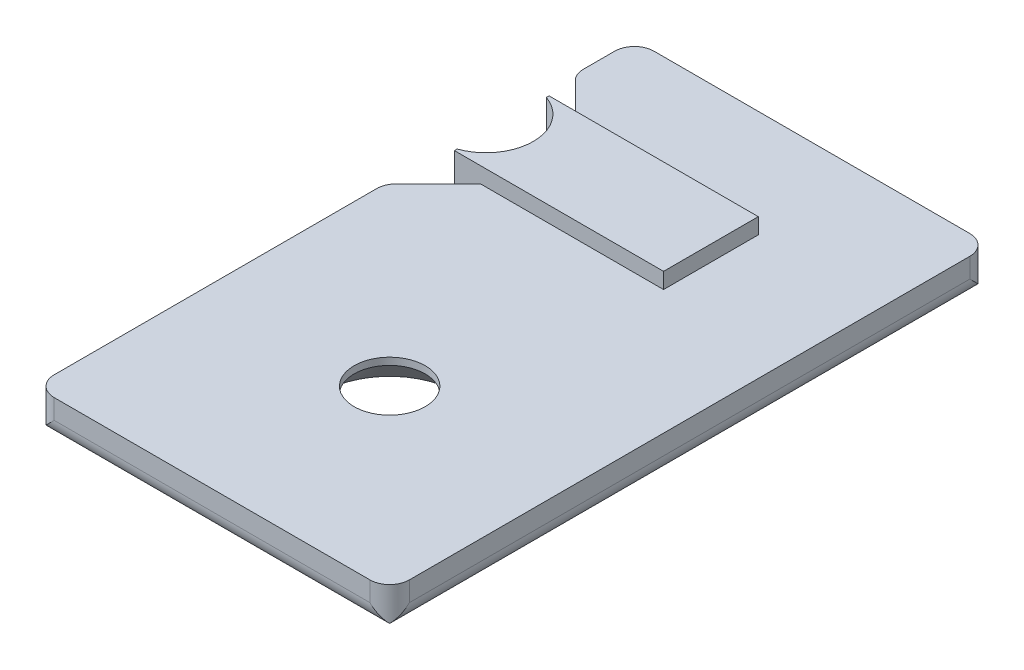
ISO-10303-21;
HEADER;
FILE_DESCRIPTION(('STEP AP214'),'2;1');
FILE_NAME('part.step','',(''),(''),'','','');
FILE_SCHEMA(('AUTOMOTIVE_DESIGN { 1 0 10303 214 1 1 1 1 }'));
ENDSEC;
DATA;
#1=APPLICATION_CONTEXT('core data for automotive mechanical design processes');
#2=APPLICATION_PROTOCOL_DEFINITION('international standard','automotive_design',2000,#1);
#3=PRODUCT_CONTEXT('',#1,'mechanical');
#4=PRODUCT('Part','Part','',(#3));
#5=PRODUCT_RELATED_PRODUCT_CATEGORY('part','',(#4));
#6=PRODUCT_DEFINITION_FORMATION('','',#4);
#7=PRODUCT_DEFINITION_CONTEXT('part definition',#1,'design');
#8=PRODUCT_DEFINITION('design','',#6,#7);
#9=PRODUCT_DEFINITION_SHAPE('','',#8);
#10=(LENGTH_UNIT() NAMED_UNIT(*) SI_UNIT(.MILLI.,.METRE.));
#11=(NAMED_UNIT(*) PLANE_ANGLE_UNIT() SI_UNIT($,.RADIAN.));
#12=(NAMED_UNIT(*) SI_UNIT($,.STERADIAN.) SOLID_ANGLE_UNIT());
#13=UNCERTAINTY_MEASURE_WITH_UNIT(LENGTH_MEASURE(1.E-05),#10,'distance_accuracy_value','');
#14=(GEOMETRIC_REPRESENTATION_CONTEXT(3) GLOBAL_UNCERTAINTY_ASSIGNED_CONTEXT((#13)) GLOBAL_UNIT_ASSIGNED_CONTEXT((#10,
#11,#12)) REPRESENTATION_CONTEXT('',''));
#15=CARTESIAN_POINT('',(0.,0.,0.));
#16=DIRECTION('',(0.,0.,1.));
#17=DIRECTION('',(1.,0.,0.));
#18=AXIS2_PLACEMENT_3D('',#15,#16,#17);
#19=CARTESIAN_POINT('',(0.179712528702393,0.,-68.618520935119));
#20=DIRECTION('',(-0.923879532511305,0.,0.382683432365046));
#21=DIRECTION('',(0.382683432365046,0.,0.923879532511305));
#22=AXIS2_PLACEMENT_3D('',#19,#20,#21);
#23=PLANE('',#22);
#24=DIRECTION('',(0.382683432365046,0.,0.923879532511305));
#25=VECTOR('',#24,1.);
#26=CARTESIAN_POINT('',(0.179712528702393,0.,-68.618520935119));
#27=LINE('',#26,#25);
#28=CARTESIAN_POINT('',(0.201180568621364,0.,-68.5666925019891));
#29=VERTEX_POINT('',#28);
#30=CARTESIAN_POINT('',(0.179712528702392,0.,-68.618520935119));
#31=VERTEX_POINT('',#30);
#32=EDGE_CURVE('E623',#29,#31,#27,.F.);
#33=ORIENTED_EDGE('',*,*,#32,.T.);
#34=DIRECTION('',(0.,1.,0.));
#35=VECTOR('',#34,1.);
#36=CARTESIAN_POINT('',(0.179712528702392,0.,-68.618520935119));
#37=LINE('',#36,#35);
#38=CARTESIAN_POINT('',(0.179712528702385,-3.43073414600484,-68.618520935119));
#39=VERTEX_POINT('',#38);
#40=EDGE_CURVE('E606',#39,#31,#37,.T.);
#41=ORIENTED_EDGE('',*,*,#40,.F.);
#42=CARTESIAN_POINT('',(2.5,-2.50000000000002,-63.0168514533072));
#43=DIRECTION('',(-0.923879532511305,0.,0.382683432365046));
#44=DIRECTION('',(-0.382683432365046,0.,-0.923879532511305));
#45=AXIS2_PLACEMENT_3D('',#42,#43,#44);
#46=ELLIPSE('',#45,6.53281482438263,2.5);
#47=CARTESIAN_POINT('',(0.201180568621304,-3.48256257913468,-68.5666925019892));
#48=VERTEX_POINT('',#47);
#49=EDGE_CURVE('E19',#39,#48,#46,.T.);
#50=ORIENTED_EDGE('',*,*,#49,.T.);
#51=DIRECTION('',(0.,1.,0.));
#52=VECTOR('',#51,1.);
#53=CARTESIAN_POINT('',(0.201180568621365,0.,-68.5666925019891));
#54=LINE('',#53,#52);
#55=EDGE_CURVE('E612',#29,#48,#54,.F.);
#56=ORIENTED_EDGE('',*,*,#55,.F.);
#57=EDGE_LOOP('',(#33,#41,#50,#56));
#58=FACE_BOUND('',#57,.T.);
#59=ADVANCED_FACE('F16',(#58),#23,.T.);
#60=CARTESIAN_POINT('',(0.201180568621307,0.,-44.333307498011));
#61=DIRECTION('',(-0.923879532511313,0.,-0.382683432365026));
#62=DIRECTION('',(-0.382683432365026,0.,0.923879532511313));
#63=AXIS2_PLACEMENT_3D('',#60,#61,#62);
#64=PLANE('',#63);
#65=DIRECTION('',(-0.382683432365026,0.,0.923879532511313));
#66=VECTOR('',#65,1.);
#67=CARTESIAN_POINT('',(0.201180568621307,0.,-44.333307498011));
#68=LINE('',#67,#66);
#69=CARTESIAN_POINT('',(0.179712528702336,0.,-44.281479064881));
#70=VERTEX_POINT('',#69);
#71=CARTESIAN_POINT('',(0.201180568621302,0.,-44.333307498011));
#72=VERTEX_POINT('',#71);
#73=EDGE_CURVE('E972',#70,#72,#68,.F.);
#74=ORIENTED_EDGE('',*,*,#73,.T.);
#75=DIRECTION('',(0.,1.,0.));
#76=VECTOR('',#75,1.);
#77=CARTESIAN_POINT('',(0.2011805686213,0.,-44.333307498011));
#78=LINE('',#77,#76);
#79=CARTESIAN_POINT('',(0.201180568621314,-3.48256257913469,-44.333307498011));
#80=VERTEX_POINT('',#79);
#81=EDGE_CURVE('E969',#80,#72,#78,.T.);
#82=ORIENTED_EDGE('',*,*,#81,.F.);
#83=CARTESIAN_POINT('',(2.5,-2.50000000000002,-49.8831485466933));
#84=DIRECTION('',(-0.923879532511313,0.,-0.382683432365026));
#85=DIRECTION('',(0.382683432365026,0.,-0.923879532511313));
#86=AXIS2_PLACEMENT_3D('',#83,#84,#85);
#87=ELLIPSE('',#86,6.53281482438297,2.5);
#88=CARTESIAN_POINT('',(0.179712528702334,-3.43073414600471,-44.281479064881));
#89=VERTEX_POINT('',#88);
#90=EDGE_CURVE('E634',#80,#89,#87,.T.);
#91=ORIENTED_EDGE('',*,*,#90,.T.);
#92=DIRECTION('',(0.,1.,0.));
#93=VECTOR('',#92,1.);
#94=CARTESIAN_POINT('',(0.179712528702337,0.,-44.281479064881));
#95=LINE('',#94,#93);
#96=EDGE_CURVE('E631',#70,#89,#95,.F.);
#97=ORIENTED_EDGE('',*,*,#96,.F.);
#98=EDGE_LOOP('',(#74,#82,#91,#97));
#99=FACE_BOUND('',#98,.T.);
#100=ADVANCED_FACE('F1502',(#99),#64,.T.);
#101=CARTESIAN_POINT('',(0.201180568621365,0.,-68.5666925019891));
#102=DIRECTION('',(-0.915060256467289,0.,0.403317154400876));
#103=DIRECTION('',(0.403317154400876,0.,0.915060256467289));
#104=AXIS2_PLACEMENT_3D('',#101,#102,#103);
#105=PLANE('',#104);
#106=DIRECTION('',(0.403317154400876,0.,0.915060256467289));
#107=VECTOR('',#106,1.);
#108=CARTESIAN_POINT('',(0.201180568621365,0.,-68.5666925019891));
#109=LINE('',#108,#107);
#110=CARTESIAN_POINT('',(0.223806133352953,0.,-68.5153588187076));
#111=VERTEX_POINT('',#110);
#112=EDGE_CURVE('E635',#111,#29,#109,.F.);
#113=ORIENTED_EDGE('',*,*,#112,.T.);
#114=ORIENTED_EDGE('',*,*,#55,.T.);
#115=CARTESIAN_POINT('',(2.5,-2.50000000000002,-63.3510494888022));
#116=DIRECTION('',(-0.915060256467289,0.,0.403317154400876));
#117=DIRECTION('',(-0.403317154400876,0.,-0.915060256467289));
#118=AXIS2_PLACEMENT_3D('',#115,#116,#117);
#119=ELLIPSE('',#118,6.19859575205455,2.5);
#120=CARTESIAN_POINT('',(0.223806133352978,-3.53389626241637,-68.5153588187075));
#121=VERTEX_POINT('',#120);
#122=EDGE_CURVE('E619',#48,#121,#119,.T.);
#123=ORIENTED_EDGE('',*,*,#122,.T.);
#124=DIRECTION('',(0.,1.,0.));
#125=VECTOR('',#124,1.);
#126=CARTESIAN_POINT('',(0.223806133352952,0.,-68.5153588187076));
#127=LINE('',#126,#125);
#128=EDGE_CURVE('E962',#111,#121,#127,.F.);
#129=ORIENTED_EDGE('',*,*,#128,.F.);
#130=EDGE_LOOP('',(#113,#114,#123,#129));
#131=FACE_BOUND('',#130,.T.);
#132=ADVANCED_FACE('F1500',(#131),#105,.T.);
#133=CARTESIAN_POINT('',(0.159412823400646,0.,-68.6708180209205));
#134=DIRECTION('',(-0.932233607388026,0.,0.361857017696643));
#135=DIRECTION('',(0.361857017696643,0.,0.932233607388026));
#136=AXIS2_PLACEMENT_3D('',#133,#134,#135);
#137=PLANE('',#136);
#138=DIRECTION('',(0.361857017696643,0.,0.932233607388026));
#139=VECTOR('',#138,1.);
#140=CARTESIAN_POINT('',(0.159412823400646,0.,-68.6708180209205));
#141=LINE('',#140,#139);
#142=CARTESIAN_POINT('',(0.159412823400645,0.,-68.6708180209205));
#143=VERTEX_POINT('',#142);
#144=EDGE_CURVE('E625',#31,#143,#141,.F.);
#145=ORIENTED_EDGE('',*,*,#144,.T.);
#146=DIRECTION('',(0.,1.,0.));
#147=VECTOR('',#146,1.);
#148=CARTESIAN_POINT('',(0.159412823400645,0.,-68.6708180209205));
#149=LINE('',#148,#147);
#150=CARTESIAN_POINT('',(0.159412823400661,-3.37843706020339,-68.6708180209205));
#151=VERTEX_POINT('',#150);
#152=EDGE_CURVE('E609',#151,#143,#149,.T.);
#153=ORIENTED_EDGE('',*,*,#152,.F.);
#154=CARTESIAN_POINT('',(2.5,-2.50000000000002,-62.6408837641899));
#155=DIRECTION('',(-0.932233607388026,0.,0.361857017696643));
#156=DIRECTION('',(-0.361857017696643,0.,-0.932233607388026));
#157=AXIS2_PLACEMENT_3D('',#154,#155,#156);
#158=ELLIPSE('',#157,6.90880617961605,2.5);
#159=EDGE_CURVE('E602',#151,#39,#158,.T.);
#160=ORIENTED_EDGE('',*,*,#159,.T.);
#161=ORIENTED_EDGE('',*,*,#40,.T.);
#162=EDGE_LOOP('',(#145,#153,#160,#161));
#163=FACE_BOUND('',#162,.T.);
#164=ADVANCED_FACE('F604',(#163),#137,.T.);
#165=CARTESIAN_POINT('',(0.179712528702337,0.,-44.281479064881));
#166=DIRECTION('',(-0.932233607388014,0.,-0.361857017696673));
#167=DIRECTION('',(-0.361857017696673,0.,0.932233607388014));
#168=AXIS2_PLACEMENT_3D('',#165,#166,#167);
#169=PLANE('',#168);
#170=DIRECTION('',(-0.361857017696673,0.,0.932233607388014));
#171=VECTOR('',#170,1.);
#172=CARTESIAN_POINT('',(0.179712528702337,0.,-44.281479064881));
#173=LINE('',#172,#171);
#174=CARTESIAN_POINT('',(0.15941282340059,0.,-44.2291819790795));
#175=VERTEX_POINT('',#174);
#176=EDGE_CURVE('E970',#175,#70,#173,.F.);
#177=ORIENTED_EDGE('',*,*,#176,.T.);
#178=ORIENTED_EDGE('',*,*,#96,.T.);
#179=CARTESIAN_POINT('',(2.5,-2.50000000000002,-50.2591162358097));
#180=DIRECTION('',(-0.932233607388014,0.,-0.361857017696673));
#181=DIRECTION('',(0.361857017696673,0.,-0.932233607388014));
#182=AXIS2_PLACEMENT_3D('',#179,#180,#181);
#183=ELLIPSE('',#182,6.90880617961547,2.5);
#184=CARTESIAN_POINT('',(0.159412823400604,-3.37843706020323,-44.2291819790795));
#185=VERTEX_POINT('',#184);
#186=EDGE_CURVE('E627',#89,#185,#183,.T.);
#187=ORIENTED_EDGE('',*,*,#186,.T.);
#188=DIRECTION('',(0.,1.,0.));
#189=VECTOR('',#188,1.);
#190=CARTESIAN_POINT('',(0.159412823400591,0.,-44.2291819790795));
#191=LINE('',#190,#189);
#192=EDGE_CURVE('E955',#175,#185,#191,.F.);
#193=ORIENTED_EDGE('',*,*,#192,.F.);
#194=EDGE_LOOP('',(#177,#178,#187,#193));
#195=FACE_BOUND('',#194,.T.);
#196=ADVANCED_FACE('F1493',(#195),#169,.T.);
#197=CARTESIAN_POINT('',(0.223806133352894,0.,-44.3846411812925));
#198=DIRECTION('',(-0.915060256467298,0.,-0.403317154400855));
#199=DIRECTION('',(-0.403317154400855,0.,0.915060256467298));
#200=AXIS2_PLACEMENT_3D('',#197,#198,#199);
#201=PLANE('',#200);
#202=DIRECTION('',(-0.403317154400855,0.,0.915060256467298));
#203=VECTOR('',#202,1.);
#204=CARTESIAN_POINT('',(0.223806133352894,0.,-44.3846411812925));
#205=LINE('',#204,#203);
#206=CARTESIAN_POINT('',(0.223806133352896,0.,-44.3846411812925));
#207=VERTEX_POINT('',#206);
#208=EDGE_CURVE('E966',#72,#207,#205,.F.);
#209=ORIENTED_EDGE('',*,*,#208,.T.);
#210=DIRECTION('',(0.,1.,0.));
#211=VECTOR('',#210,1.);
#212=CARTESIAN_POINT('',(0.223806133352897,0.,-44.3846411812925));
#213=LINE('',#212,#211);
#214=CARTESIAN_POINT('',(0.223806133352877,-3.53389626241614,-44.3846411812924));
#215=VERTEX_POINT('',#214);
#216=EDGE_CURVE('E954',#215,#207,#213,.T.);
#217=ORIENTED_EDGE('',*,*,#216,.F.);
#218=CARTESIAN_POINT('',(2.5,-2.50000000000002,-49.5489505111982));
#219=DIRECTION('',(-0.915060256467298,0.,-0.403317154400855));
#220=DIRECTION('',(0.403317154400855,0.,-0.915060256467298));
#221=AXIS2_PLACEMENT_3D('',#218,#219,#220);
#222=ELLIPSE('',#221,6.19859575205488,2.5);
#223=EDGE_CURVE('E967',#215,#80,#222,.T.);
#224=ORIENTED_EDGE('',*,*,#223,.T.);
#225=ORIENTED_EDGE('',*,*,#81,.T.);
#226=EDGE_LOOP('',(#209,#217,#224,#225));
#227=FACE_BOUND('',#226,.T.);
#228=ADVANCED_FACE('F1489',(#227),#201,.T.);
#229=CARTESIAN_POINT('',(0.223806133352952,0.,-68.5153588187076));
#230=DIRECTION('',(-0.905780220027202,0.,0.423747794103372));
#231=DIRECTION('',(0.423747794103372,0.,0.905780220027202));
#232=AXIS2_PLACEMENT_3D('',#229,#230,#231);
#233=PLANE('',#232);
#234=DIRECTION('',(0.423747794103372,0.,0.905780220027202));
#235=VECTOR('',#234,1.);
#236=CARTESIAN_POINT('',(0.223806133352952,0.,-68.5153588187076));
#237=LINE('',#236,#235);
#238=CARTESIAN_POINT('',(0.247577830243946,0.,-68.46454573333));
#239=VERTEX_POINT('',#238);
#240=EDGE_CURVE('E965',#239,#111,#237,.F.);
#241=ORIENTED_EDGE('',*,*,#240,.T.);
#242=ORIENTED_EDGE('',*,*,#128,.T.);
#243=CARTESIAN_POINT('',(2.5,-2.50000000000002,-63.6498907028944));
#244=DIRECTION('',(-0.905780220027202,0.,0.423747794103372));
#245=DIRECTION('',(-0.423747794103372,0.,-0.905780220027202));
#246=AXIS2_PLACEMENT_3D('',#243,#244,#245);
#247=ELLIPSE('',#246,5.89973572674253,2.5);
#248=CARTESIAN_POINT('',(0.247577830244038,-3.5847093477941,-68.4645457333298));
#249=VERTEX_POINT('',#248);
#250=EDGE_CURVE('E963',#121,#249,#247,.T.);
#251=ORIENTED_EDGE('',*,*,#250,.T.);
#252=DIRECTION('',(0.,1.,0.));
#253=VECTOR('',#252,1.);
#254=CARTESIAN_POINT('',(0.247577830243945,0.,-68.46454573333));
#255=LINE('',#254,#253);
#256=EDGE_CURVE('E947',#239,#249,#255,.F.);
#257=ORIENTED_EDGE('',*,*,#256,.F.);
#258=EDGE_LOOP('',(#241,#242,#251,#257));
#259=FACE_BOUND('',#258,.T.);
#260=ADVANCED_FACE('F1485',(#259),#233,.T.);
#261=CARTESIAN_POINT('',(0.14029167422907,0.,-68.723557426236));
#262=DIRECTION('',(-0.940118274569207,0.,0.340848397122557));
#263=DIRECTION('',(0.340848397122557,0.,0.940118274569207));
#264=AXIS2_PLACEMENT_3D('',#261,#262,#263);
#265=PLANE('',#264);
#266=DIRECTION('',(0.340848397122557,0.,0.940118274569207));
#267=VECTOR('',#266,1.);
#268=CARTESIAN_POINT('',(0.14029167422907,0.,-68.723557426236));
#269=LINE('',#268,#267);
#270=CARTESIAN_POINT('',(0.140291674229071,0.,-68.723557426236));
#271=VERTEX_POINT('',#270);
#272=EDGE_CURVE('E959',#143,#271,#269,.F.);
#273=ORIENTED_EDGE('',*,*,#272,.T.);
#274=DIRECTION('',(0.,1.,0.));
#275=VECTOR('',#274,1.);
#276=CARTESIAN_POINT('',(0.140291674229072,0.,-68.723557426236));
#277=LINE('',#276,#275);
#278=CARTESIAN_POINT('',(0.140291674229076,-3.32569765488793,-68.7235574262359));
#279=VERTEX_POINT('',#278);
#280=EDGE_CURVE('E946',#279,#271,#277,.T.);
#281=ORIENTED_EDGE('',*,*,#280,.F.);
#282=CARTESIAN_POINT('',(2.5,-2.50000000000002,-62.2150775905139));
#283=DIRECTION('',(-0.940118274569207,0.,0.340848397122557));
#284=DIRECTION('',(-0.340848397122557,0.,-0.940118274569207));
#285=AXIS2_PLACEMENT_3D('',#282,#283,#284);
#286=ELLIPSE('',#285,7.3346391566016,2.5);
#287=EDGE_CURVE('E960',#279,#151,#286,.T.);
#288=ORIENTED_EDGE('',*,*,#287,.T.);
#289=ORIENTED_EDGE('',*,*,#152,.T.);
#290=EDGE_LOOP('',(#273,#281,#288,#289));
#291=FACE_BOUND('',#290,.T.);
#292=ADVANCED_FACE('F1481',(#291),#265,.T.);
#293=CARTESIAN_POINT('',(0.159412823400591,0.,-44.2291819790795));
#294=DIRECTION('',(-0.940118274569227,0.,-0.340848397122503));
#295=DIRECTION('',(-0.340848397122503,0.,0.940118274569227));
#296=AXIS2_PLACEMENT_3D('',#293,#294,#295);
#297=PLANE('',#296);
#298=DIRECTION('',(-0.340848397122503,0.,0.940118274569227));
#299=VECTOR('',#298,1.);
#300=CARTESIAN_POINT('',(0.159412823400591,0.,-44.2291819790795));
#301=LINE('',#300,#299);
#302=CARTESIAN_POINT('',(0.140291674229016,0.,-44.1764425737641));
#303=VERTEX_POINT('',#302);
#304=EDGE_CURVE('E958',#303,#175,#301,.F.);
#305=ORIENTED_EDGE('',*,*,#304,.T.);
#306=ORIENTED_EDGE('',*,*,#192,.T.);
#307=CARTESIAN_POINT('',(2.5,-2.50000000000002,-50.6849224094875));
#308=DIRECTION('',(-0.940118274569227,0.,-0.340848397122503));
#309=DIRECTION('',(0.340848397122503,0.,-0.940118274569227));
#310=AXIS2_PLACEMENT_3D('',#307,#308,#309);
#311=ELLIPSE('',#310,7.33463915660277,2.5);
#312=CARTESIAN_POINT('',(0.140291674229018,-3.32569765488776,-44.1764425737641));
#313=VERTEX_POINT('',#312);
#314=EDGE_CURVE('E956',#185,#313,#311,.T.);
#315=ORIENTED_EDGE('',*,*,#314,.T.);
#316=DIRECTION('',(0.,1.,0.));
#317=VECTOR('',#316,1.);
#318=CARTESIAN_POINT('',(0.140291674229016,0.,-44.1764425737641));
#319=LINE('',#318,#317);
#320=EDGE_CURVE('E939',#303,#313,#319,.F.);
#321=ORIENTED_EDGE('',*,*,#320,.F.);
#322=EDGE_LOOP('',(#305,#306,#315,#321));
#323=FACE_BOUND('',#322,.T.);
#324=ADVANCED_FACE('F1477',(#323),#297,.T.);
#325=CARTESIAN_POINT('',(0.247577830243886,0.,-44.43545426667));
#326=DIRECTION('',(-0.90578022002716,0.,-0.423747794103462));
#327=DIRECTION('',(-0.423747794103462,0.,0.90578022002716));
#328=AXIS2_PLACEMENT_3D('',#325,#326,#327);
#329=PLANE('',#328);
#330=DIRECTION('',(-0.423747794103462,0.,0.90578022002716));
#331=VECTOR('',#330,1.);
#332=CARTESIAN_POINT('',(0.247577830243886,0.,-44.43545426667));
#333=LINE('',#332,#331);
#334=CARTESIAN_POINT('',(0.247577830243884,0.,-44.43545426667));
#335=VERTEX_POINT('',#334);
#336=EDGE_CURVE('E951',#207,#335,#333,.F.);
#337=ORIENTED_EDGE('',*,*,#336,.T.);
#338=DIRECTION('',(0.,1.,0.));
#339=VECTOR('',#338,1.);
#340=CARTESIAN_POINT('',(0.247577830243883,0.,-44.43545426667));
#341=LINE('',#340,#339);
#342=CARTESIAN_POINT('',(0.247577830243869,-3.58470934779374,-44.43545426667));
#343=VERTEX_POINT('',#342);
#344=EDGE_CURVE('E938',#343,#335,#341,.T.);
#345=ORIENTED_EDGE('',*,*,#344,.F.);
#346=CARTESIAN_POINT('',(2.5,-2.50000000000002,-49.2501092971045));
#347=DIRECTION('',(-0.90578022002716,0.,-0.423747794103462));
#348=DIRECTION('',(0.423747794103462,0.,-0.90578022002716));
#349=AXIS2_PLACEMENT_3D('',#346,#347,#348);
#350=ELLIPSE('',#349,5.89973572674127,2.5);
#351=EDGE_CURVE('E952',#343,#215,#350,.T.);
#352=ORIENTED_EDGE('',*,*,#351,.T.);
#353=ORIENTED_EDGE('',*,*,#216,.T.);
#354=EDGE_LOOP('',(#337,#345,#352,#353));
#355=FACE_BOUND('',#354,.T.);
#356=ADVANCED_FACE('F1473',(#355),#329,.T.);
#357=CARTESIAN_POINT('',(0.247577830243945,0.,-68.46454573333));
#358=DIRECTION('',(-0.896044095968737,0.,0.443965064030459));
#359=DIRECTION('',(0.443965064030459,0.,0.896044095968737));
#360=AXIS2_PLACEMENT_3D('',#357,#358,#359);
#361=PLANE('',#360);
#362=DIRECTION('',(0.443965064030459,0.,0.896044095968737));
#363=VECTOR('',#362,1.);
#364=CARTESIAN_POINT('',(0.247577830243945,0.,-68.46454573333));
#365=LINE('',#364,#363);
#366=CARTESIAN_POINT('',(0.272483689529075,0.,-68.414278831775));
#367=VERTEX_POINT('',#366);
#368=EDGE_CURVE('E950',#367,#239,#365,.F.);
#369=ORIENTED_EDGE('',*,*,#368,.T.);
#370=ORIENTED_EDGE('',*,*,#256,.T.);
#371=CARTESIAN_POINT('',(2.5,-2.50000000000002,-63.918535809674));
#372=DIRECTION('',(-0.896044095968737,0.,0.443965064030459));
#373=DIRECTION('',(-0.443965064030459,0.,-0.896044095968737));
#374=AXIS2_PLACEMENT_3D('',#371,#372,#373);
#375=ELLIPSE('',#374,5.6310737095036,2.5);
#376=CARTESIAN_POINT('',(0.272483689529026,-3.63497624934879,-68.4142788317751));
#377=VERTEX_POINT('',#376);
#378=EDGE_CURVE('E948',#249,#377,#375,.T.);
#379=ORIENTED_EDGE('',*,*,#378,.T.);
#380=DIRECTION('',(0.,1.,0.));
#381=VECTOR('',#380,1.);
#382=CARTESIAN_POINT('',(0.272483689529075,0.,-68.414278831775));
#383=LINE('',#382,#381);
#384=EDGE_CURVE('E931',#367,#377,#383,.F.);
#385=ORIENTED_EDGE('',*,*,#384,.F.);
#386=EDGE_LOOP('',(#369,#370,#379,#385));
#387=FACE_BOUND('',#386,.T.);
#388=ADVANCED_FACE('F1469',(#387),#361,.T.);
#389=CARTESIAN_POINT('',(0.122358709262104,0.,-68.7767125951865));
#390=DIRECTION('',(-0.947529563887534,0.,0.319668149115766));
#391=DIRECTION('',(0.319668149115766,0.,0.947529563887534));
#392=AXIS2_PLACEMENT_3D('',#389,#390,#391);
#393=PLANE('',#392);
#394=DIRECTION('',(0.319668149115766,0.,0.947529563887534));
#395=VECTOR('',#394,1.);
#396=CARTESIAN_POINT('',(0.122358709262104,0.,-68.7767125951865));
#397=LINE('',#396,#395);
#398=CARTESIAN_POINT('',(0.122358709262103,0.,-68.7767125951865));
#399=VERTEX_POINT('',#398);
#400=EDGE_CURVE('E943',#271,#399,#397,.F.);
#401=ORIENTED_EDGE('',*,*,#400,.T.);
#402=DIRECTION('',(0.,1.,0.));
#403=VECTOR('',#402,1.);
#404=CARTESIAN_POINT('',(0.122358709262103,0.,-68.7767125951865));
#405=LINE('',#404,#403);
#406=CARTESIAN_POINT('',(0.12235870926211,-3.27254248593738,-68.7767125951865));
#407=VERTEX_POINT('',#406);
#408=EDGE_CURVE('E930',#407,#399,#405,.T.);
#409=ORIENTED_EDGE('',*,*,#408,.F.);
#410=CARTESIAN_POINT('',(2.5,-2.50000000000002,-61.7291370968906));
#411=DIRECTION('',(-0.947529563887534,0.,0.319668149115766));
#412=DIRECTION('',(-0.319668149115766,0.,-0.947529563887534));
#413=AXIS2_PLACEMENT_3D('',#410,#411,#412);
#414=ELLIPSE('',#413,7.82061023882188,2.5);
#415=EDGE_CURVE('E944',#407,#279,#414,.T.);
#416=ORIENTED_EDGE('',*,*,#415,.T.);
#417=ORIENTED_EDGE('',*,*,#280,.T.);
#418=EDGE_LOOP('',(#401,#409,#416,#417));
#419=FACE_BOUND('',#418,.T.);
#420=ADVANCED_FACE('F1465',(#419),#393,.T.);
#421=CARTESIAN_POINT('',(0.140291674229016,0.,-44.1764425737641));
#422=DIRECTION('',(-0.947529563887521,0.,-0.319668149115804));
#423=DIRECTION('',(-0.319668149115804,0.,0.947529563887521));
#424=AXIS2_PLACEMENT_3D('',#421,#422,#423);
#425=PLANE('',#424);
#426=DIRECTION('',(-0.319668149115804,0.,0.947529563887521));
#427=VECTOR('',#426,1.);
#428=CARTESIAN_POINT('',(0.140291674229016,0.,-44.1764425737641));
#429=LINE('',#428,#427);
#430=CARTESIAN_POINT('',(0.12235870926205,0.,-44.1232874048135));
#431=VERTEX_POINT('',#430);
#432=EDGE_CURVE('E942',#431,#303,#429,.F.);
#433=ORIENTED_EDGE('',*,*,#432,.T.);
#434=ORIENTED_EDGE('',*,*,#320,.T.);
#435=CARTESIAN_POINT('',(2.5,-2.50000000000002,-51.1708629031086));
#436=DIRECTION('',(-0.947529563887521,0.,-0.319668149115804));
#437=DIRECTION('',(0.319668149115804,0.,-0.947529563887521));
#438=AXIS2_PLACEMENT_3D('',#435,#436,#437);
#439=ELLIPSE('',#438,7.82061023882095,2.5);
#440=CARTESIAN_POINT('',(0.122358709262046,-3.27254248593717,-44.1232874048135));
#441=VERTEX_POINT('',#440);
#442=EDGE_CURVE('E940',#313,#441,#439,.T.);
#443=ORIENTED_EDGE('',*,*,#442,.T.);
#444=DIRECTION('',(0.,1.,0.));
#445=VECTOR('',#444,1.);
#446=CARTESIAN_POINT('',(0.12235870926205,0.,-44.1232874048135));
#447=LINE('',#446,#445);
#448=EDGE_CURVE('E923',#431,#441,#447,.F.);
#449=ORIENTED_EDGE('',*,*,#448,.F.);
#450=EDGE_LOOP('',(#433,#434,#443,#449));
#451=FACE_BOUND('',#450,.T.);
#452=ADVANCED_FACE('F1461',(#451),#425,.T.);
#453=CARTESIAN_POINT('',(0.272483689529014,0.,-44.485721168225));
#454=DIRECTION('',(-0.896044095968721,0.,-0.443965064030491));
#455=DIRECTION('',(-0.443965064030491,0.,0.896044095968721));
#456=AXIS2_PLACEMENT_3D('',#453,#454,#455);
#457=PLANE('',#456);
#458=DIRECTION('',(-0.443965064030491,0.,0.896044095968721));
#459=VECTOR('',#458,1.);
#460=CARTESIAN_POINT('',(0.272483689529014,0.,-44.485721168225));
#461=LINE('',#460,#459);
#462=CARTESIAN_POINT('',(0.272483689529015,0.,-44.485721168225));
#463=VERTEX_POINT('',#462);
#464=EDGE_CURVE('E935',#335,#463,#461,.F.);
#465=ORIENTED_EDGE('',*,*,#464,.T.);
#466=DIRECTION('',(0.,1.,0.));
#467=VECTOR('',#466,1.);
#468=CARTESIAN_POINT('',(0.272483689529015,0.,-44.485721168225));
#469=LINE('',#468,#467);
#470=CARTESIAN_POINT('',(0.272483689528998,-3.63497624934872,-44.485721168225));
#471=VERTEX_POINT('',#470);
#472=EDGE_CURVE('E922',#471,#463,#469,.T.);
#473=ORIENTED_EDGE('',*,*,#472,.F.);
#474=CARTESIAN_POINT('',(2.5,-2.50000000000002,-48.9814641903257));
#475=DIRECTION('',(-0.896044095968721,0.,-0.443965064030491));
#476=DIRECTION('',(0.443965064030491,0.,-0.896044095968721));
#477=AXIS2_PLACEMENT_3D('',#474,#475,#476);
#478=ELLIPSE('',#477,5.6310737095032,2.5);
#479=EDGE_CURVE('E936',#471,#343,#478,.T.);
#480=ORIENTED_EDGE('',*,*,#479,.T.);
#481=ORIENTED_EDGE('',*,*,#344,.T.);
#482=EDGE_LOOP('',(#465,#473,#480,#481));
#483=FACE_BOUND('',#482,.T.);
#484=ADVANCED_FACE('F1457',(#483),#457,.T.);
#485=CARTESIAN_POINT('',(0.272483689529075,0.,-68.414278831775));
#486=DIRECTION('',(-0.885856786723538,0.,0.463958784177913));
#487=DIRECTION('',(0.463958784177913,0.,0.885856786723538));
#488=AXIS2_PLACEMENT_3D('',#485,#486,#487);
#489=PLANE('',#488);
#490=DIRECTION('',(0.463958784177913,0.,0.885856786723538));
#491=VECTOR('',#490,1.);
#492=CARTESIAN_POINT('',(0.272483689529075,0.,-68.414278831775));
#493=LINE('',#492,#491);
#494=CARTESIAN_POINT('',(0.298511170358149,0.,-68.3645834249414));
#495=VERTEX_POINT('',#494);
#496=EDGE_CURVE('E934',#495,#367,#493,.F.);
#497=ORIENTED_EDGE('',*,*,#496,.T.);
#498=ORIENTED_EDGE('',*,*,#384,.T.);
#499=CARTESIAN_POINT('',(2.5,-2.50000000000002,-64.1611845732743));
#500=DIRECTION('',(-0.885856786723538,0.,0.463958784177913));
#501=DIRECTION('',(-0.463958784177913,0.,-0.885856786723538));
#502=AXIS2_PLACEMENT_3D('',#499,#500,#501);
#503=ELLIPSE('',#502,5.38840967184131,2.5);
#504=CARTESIAN_POINT('',(0.298511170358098,-3.68467165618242,-68.3645834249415));
#505=VERTEX_POINT('',#504);
#506=EDGE_CURVE('E932',#377,#505,#503,.T.);
#507=ORIENTED_EDGE('',*,*,#506,.T.);
#508=DIRECTION('',(0.,1.,0.));
#509=VECTOR('',#508,1.);
#510=CARTESIAN_POINT('',(0.29851117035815,0.,-68.3645834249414));
#511=LINE('',#510,#509);
#512=EDGE_CURVE('E915',#495,#505,#511,.F.);
#513=ORIENTED_EDGE('',*,*,#512,.F.);
#514=EDGE_LOOP('',(#497,#498,#507,#513));
#515=FACE_BOUND('',#514,.T.);
#516=ADVANCED_FACE('F1453',(#515),#489,.T.);
#517=CARTESIAN_POINT('',(0.105622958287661,0.,-68.8302567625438));
#518=DIRECTION('',(-0.954463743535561,0.,0.298326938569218));
#519=DIRECTION('',(0.298326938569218,0.,0.954463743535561));
#520=AXIS2_PLACEMENT_3D('',#517,#518,#519);
#521=PLANE('',#520);
#522=DIRECTION('',(0.298326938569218,0.,0.954463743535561));
#523=VECTOR('',#522,1.);
#524=CARTESIAN_POINT('',(0.105622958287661,0.,-68.8302567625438));
#525=LINE('',#524,#523);
#526=CARTESIAN_POINT('',(0.105622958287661,0.,-68.8302567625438));
#527=VERTEX_POINT('',#526);
#528=EDGE_CURVE('E927',#399,#527,#525,.F.);
#529=ORIENTED_EDGE('',*,*,#528,.T.);
#530=DIRECTION('',(0.,1.,0.));
#531=VECTOR('',#530,1.);
#532=CARTESIAN_POINT('',(0.105622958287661,0.,-68.8302567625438));
#533=LINE('',#532,#531);
#534=CARTESIAN_POINT('',(0.105622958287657,-3.21899831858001,-68.8302567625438));
#535=VERTEX_POINT('',#534);
#536=EDGE_CURVE('E914',#535,#527,#533,.T.);
#537=ORIENTED_EDGE('',*,*,#536,.F.);
#538=CARTESIAN_POINT('',(2.5,-2.50000000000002,-61.169714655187));
#539=DIRECTION('',(-0.954463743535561,0.,0.298326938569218));
#540=DIRECTION('',(-0.298326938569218,0.,-0.954463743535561));
#541=AXIS2_PLACEMENT_3D('',#538,#539,#540);
#542=ELLIPSE('',#541,8.380067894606,2.5);
#543=EDGE_CURVE('E928',#535,#407,#542,.T.);
#544=ORIENTED_EDGE('',*,*,#543,.T.);
#545=ORIENTED_EDGE('',*,*,#408,.T.);
#546=EDGE_LOOP('',(#529,#537,#544,#545));
#547=FACE_BOUND('',#546,.T.);
#548=ADVANCED_FACE('F1449',(#547),#521,.T.);
#549=CARTESIAN_POINT('',(0.12235870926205,0.,-44.1232874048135));
#550=DIRECTION('',(-0.954463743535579,0.,-0.298326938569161));
#551=DIRECTION('',(-0.298326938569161,0.,0.954463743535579));
#552=AXIS2_PLACEMENT_3D('',#549,#550,#551);
#553=PLANE('',#552);
#554=DIRECTION('',(-0.298326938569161,0.,0.954463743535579));
#555=VECTOR('',#554,1.);
#556=CARTESIAN_POINT('',(0.12235870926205,0.,-44.1232874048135));
#557=LINE('',#556,#555);
#558=CARTESIAN_POINT('',(0.105622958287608,0.,-44.0697432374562));
#559=VERTEX_POINT('',#558);
#560=EDGE_CURVE('E926',#559,#431,#557,.F.);
#561=ORIENTED_EDGE('',*,*,#560,.T.);
#562=ORIENTED_EDGE('',*,*,#448,.T.);
#563=CARTESIAN_POINT('',(2.5,-2.50000000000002,-51.7302853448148));
#564=DIRECTION('',(-0.954463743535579,0.,-0.298326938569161));
#565=DIRECTION('',(0.298326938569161,0.,-0.954463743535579));
#566=AXIS2_PLACEMENT_3D('',#563,#564,#565);
#567=ELLIPSE('',#566,8.3800678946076,2.5);
#568=CARTESIAN_POINT('',(0.105622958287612,-3.21899831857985,-44.0697432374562));
#569=VERTEX_POINT('',#568);
#570=EDGE_CURVE('E924',#441,#569,#567,.T.);
#571=ORIENTED_EDGE('',*,*,#570,.T.);
#572=DIRECTION('',(0.,1.,0.));
#573=VECTOR('',#572,1.);
#574=CARTESIAN_POINT('',(0.105622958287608,0.,-44.0697432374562));
#575=LINE('',#574,#573);
#576=EDGE_CURVE('E907',#559,#569,#575,.F.);
#577=ORIENTED_EDGE('',*,*,#576,.F.);
#578=EDGE_LOOP('',(#561,#562,#571,#577));
#579=FACE_BOUND('',#578,.T.);
#580=ADVANCED_FACE('F1445',(#579),#553,.T.);
#581=CARTESIAN_POINT('',(0.298511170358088,0.,-44.5354165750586));
#582=DIRECTION('',(-0.885856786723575,0.,-0.463958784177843));
#583=DIRECTION('',(-0.463958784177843,0.,0.885856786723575));
#584=AXIS2_PLACEMENT_3D('',#581,#582,#583);
#585=PLANE('',#584);
#586=DIRECTION('',(-0.463958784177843,0.,0.885856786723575));
#587=VECTOR('',#586,1.);
#588=CARTESIAN_POINT('',(0.298511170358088,0.,-44.5354165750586));
#589=LINE('',#588,#587);
#590=CARTESIAN_POINT('',(0.298511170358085,0.,-44.5354165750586));
#591=VERTEX_POINT('',#590);
#592=EDGE_CURVE('E919',#463,#591,#589,.F.);
#593=ORIENTED_EDGE('',*,*,#592,.T.);
#594=DIRECTION('',(0.,1.,0.));
#595=VECTOR('',#594,1.);
#596=CARTESIAN_POINT('',(0.298511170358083,0.,-44.5354165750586));
#597=LINE('',#596,#595);
#598=CARTESIAN_POINT('',(0.298511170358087,-3.68467165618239,-44.5354165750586));
#599=VERTEX_POINT('',#598);
#600=EDGE_CURVE('E906',#599,#591,#597,.T.);
#601=ORIENTED_EDGE('',*,*,#600,.F.);
#602=CARTESIAN_POINT('',(2.5,-2.50000000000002,-48.7388154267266));
#603=DIRECTION('',(-0.885856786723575,0.,-0.463958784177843));
#604=DIRECTION('',(0.463958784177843,0.,-0.885856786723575));
#605=AXIS2_PLACEMENT_3D('',#602,#603,#604);
#606=ELLIPSE('',#605,5.38840967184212,2.5);
#607=EDGE_CURVE('E920',#599,#471,#606,.T.);
#608=ORIENTED_EDGE('',*,*,#607,.T.);
#609=ORIENTED_EDGE('',*,*,#472,.T.);
#610=EDGE_LOOP('',(#593,#601,#608,#609));
#611=FACE_BOUND('',#610,.T.);
#612=ADVANCED_FACE('F1441',(#611),#585,.T.);
#613=CARTESIAN_POINT('',(0.29851117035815,0.,-68.3645834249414));
#614=DIRECTION('',(-0.875223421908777,0.,0.483718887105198));
#615=DIRECTION('',(0.483718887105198,0.,0.875223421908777));
#616=AXIS2_PLACEMENT_3D('',#613,#614,#615);
#617=PLANE('',#616);
#618=DIRECTION('',(0.483718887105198,0.,0.875223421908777));
#619=VECTOR('',#618,1.);
#620=CARTESIAN_POINT('',(0.29851117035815,0.,-68.3645834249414));
#621=LINE('',#620,#619);
#622=CARTESIAN_POINT('',(0.325647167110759,0.,-68.315484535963));
#623=VERTEX_POINT('',#622);
#624=EDGE_CURVE('E918',#623,#495,#621,.F.);
#625=ORIENTED_EDGE('',*,*,#624,.T.);
#626=ORIENTED_EDGE('',*,*,#512,.T.);
#627=CARTESIAN_POINT('',(2.5,-2.50000000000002,-64.3812893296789));
#628=DIRECTION('',(-0.875223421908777,0.,0.483718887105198));
#629=DIRECTION('',(-0.483718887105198,0.,-0.875223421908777));
#630=AXIS2_PLACEMENT_3D('',#627,#628,#629);
#631=ELLIPSE('',#630,5.16829106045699,2.5);
#632=CARTESIAN_POINT('',(0.325647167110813,-3.73377054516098,-68.3154845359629));
#633=VERTEX_POINT('',#632);
#634=EDGE_CURVE('E916',#505,#633,#631,.T.);
#635=ORIENTED_EDGE('',*,*,#634,.T.);
#636=DIRECTION('',(0.,1.,0.));
#637=VECTOR('',#636,1.);
#638=CARTESIAN_POINT('',(0.325647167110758,0.,-68.315484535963));
#639=LINE('',#638,#637);
#640=EDGE_CURVE('E899',#623,#633,#639,.F.);
#641=ORIENTED_EDGE('',*,*,#640,.F.);
#642=EDGE_LOOP('',(#625,#626,#635,#641));
#643=FACE_BOUND('',#642,.T.);
#644=ADVANCED_FACE('F1437',(#643),#617,.T.);
#645=CARTESIAN_POINT('',(0.090092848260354,0.,-68.8841629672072));
#646=DIRECTION('',(-0.960917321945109,0.,0.276835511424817));
#647=DIRECTION('',(0.276835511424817,0.,0.960917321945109));
#648=AXIS2_PLACEMENT_3D('',#645,#646,#647);
#649=PLANE('',#648);
#650=DIRECTION('',(0.276835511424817,0.,0.960917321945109));
#651=VECTOR('',#650,1.);
#652=CARTESIAN_POINT('',(0.090092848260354,0.,-68.8841629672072));
#653=LINE('',#652,#651);
#654=CARTESIAN_POINT('',(0.0900928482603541,0.,-68.8841629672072));
#655=VERTEX_POINT('',#654);
#656=EDGE_CURVE('E911',#527,#655,#653,.F.);
#657=ORIENTED_EDGE('',*,*,#656,.T.);
#658=DIRECTION('',(0.,1.,0.));
#659=VECTOR('',#658,1.);
#660=CARTESIAN_POINT('',(0.0900928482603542,0.,-68.8841629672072));
#661=LINE('',#660,#659);
#662=CARTESIAN_POINT('',(0.0900928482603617,-3.16509211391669,-68.8841629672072));
#663=VERTEX_POINT('',#662);
#664=EDGE_CURVE('E898',#663,#655,#661,.T.);
#665=ORIENTED_EDGE('',*,*,#664,.F.);
#666=CARTESIAN_POINT('',(2.5,-2.50000000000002,-60.5191901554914));
#667=DIRECTION('',(-0.960917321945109,0.,0.276835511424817));
#668=DIRECTION('',(-0.276835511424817,0.,-0.960917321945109));
#669=AXIS2_PLACEMENT_3D('',#666,#667,#668);
#670=ELLIPSE('',#669,9.03063334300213,2.5);
#671=EDGE_CURVE('E912',#663,#535,#670,.T.);
#672=ORIENTED_EDGE('',*,*,#671,.T.);
#673=ORIENTED_EDGE('',*,*,#536,.T.);
#674=EDGE_LOOP('',(#657,#665,#672,#673));
#675=FACE_BOUND('',#674,.T.);
#676=ADVANCED_FACE('F1433',(#675),#649,.T.);
#677=CARTESIAN_POINT('',(0.105622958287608,0.,-44.0697432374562));
#678=DIRECTION('',(-0.960917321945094,0.,-0.27683551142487));
#679=DIRECTION('',(-0.27683551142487,0.,0.960917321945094));
#680=AXIS2_PLACEMENT_3D('',#677,#678,#679);
#681=PLANE('',#680);
#682=DIRECTION('',(-0.27683551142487,0.,0.960917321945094));
#683=VECTOR('',#682,1.);
#684=CARTESIAN_POINT('',(0.105622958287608,0.,-44.0697432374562));
#685=LINE('',#684,#683);
#686=CARTESIAN_POINT('',(0.0900928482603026,0.,-44.0158370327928));
#687=VERTEX_POINT('',#686);
#688=EDGE_CURVE('E910',#687,#559,#685,.F.);
#689=ORIENTED_EDGE('',*,*,#688,.T.);
#690=ORIENTED_EDGE('',*,*,#576,.T.);
#691=CARTESIAN_POINT('',(2.5,-2.50000000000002,-52.3808098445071));
#692=DIRECTION('',(-0.960917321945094,0.,-0.27683551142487));
#693=DIRECTION('',(0.27683551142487,0.,-0.960917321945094));
#694=AXIS2_PLACEMENT_3D('',#691,#692,#693);
#695=ELLIPSE('',#694,9.0306333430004,2.5);
#696=CARTESIAN_POINT('',(0.0900928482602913,-3.16509211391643,-44.0158370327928));
#697=VERTEX_POINT('',#696);
#698=EDGE_CURVE('E908',#569,#697,#695,.T.);
#699=ORIENTED_EDGE('',*,*,#698,.T.);
#700=DIRECTION('',(0.,1.,0.));
#701=VECTOR('',#700,1.);
#702=CARTESIAN_POINT('',(0.090092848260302,0.,-44.0158370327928));
#703=LINE('',#702,#701);
#704=EDGE_CURVE('E891',#687,#697,#703,.F.);
#705=ORIENTED_EDGE('',*,*,#704,.F.);
#706=EDGE_LOOP('',(#689,#690,#699,#705));
#707=FACE_BOUND('',#706,.T.);
#708=ADVANCED_FACE('F1429',(#707),#681,.T.);
#709=CARTESIAN_POINT('',(0.325647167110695,0.,-44.584515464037));
#710=DIRECTION('',(-0.875223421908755,0.,-0.483718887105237));
#711=DIRECTION('',(-0.483718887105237,0.,0.875223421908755));
#712=AXIS2_PLACEMENT_3D('',#709,#710,#711);
#713=PLANE('',#712);
#714=DIRECTION('',(-0.483718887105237,0.,0.875223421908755));
#715=VECTOR('',#714,1.);
#716=CARTESIAN_POINT('',(0.325647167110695,0.,-44.584515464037));
#717=LINE('',#716,#715);
#718=CARTESIAN_POINT('',(0.3256471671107,0.,-44.584515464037));
#719=VERTEX_POINT('',#718);
#720=EDGE_CURVE('E903',#591,#719,#717,.F.);
#721=ORIENTED_EDGE('',*,*,#720,.T.);
#722=DIRECTION('',(0.,1.,0.));
#723=VECTOR('',#722,1.);
#724=CARTESIAN_POINT('',(0.325647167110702,0.,-44.584515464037));
#725=LINE('',#724,#723);
#726=CARTESIAN_POINT('',(0.325647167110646,-3.73377054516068,-44.5845154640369));
#727=VERTEX_POINT('',#726);
#728=EDGE_CURVE('E890',#727,#719,#725,.T.);
#729=ORIENTED_EDGE('',*,*,#728,.F.);
#730=CARTESIAN_POINT('',(2.5,-2.50000000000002,-48.5187106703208));
#731=DIRECTION('',(-0.875223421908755,0.,-0.483718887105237));
#732=DIRECTION('',(0.483718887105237,0.,-0.875223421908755));
#733=AXIS2_PLACEMENT_3D('',#730,#731,#732);
#734=ELLIPSE('',#733,5.16829106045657,2.5);
#735=EDGE_CURVE('E904',#727,#599,#734,.T.);
#736=ORIENTED_EDGE('',*,*,#735,.T.);
#737=ORIENTED_EDGE('',*,*,#600,.T.);
#738=EDGE_LOOP('',(#721,#729,#736,#737));
#739=FACE_BOUND('',#738,.T.);
#740=ADVANCED_FACE('F1425',(#739),#713,.T.);
#741=CARTESIAN_POINT('',(0.325647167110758,0.,-68.315484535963));
#742=DIRECTION('',(-0.864149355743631,0.,0.50323542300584));
#743=DIRECTION('',(0.50323542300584,0.,0.864149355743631));
#744=AXIS2_PLACEMENT_3D('',#741,#742,#743);
#745=PLANE('',#744);
#746=DIRECTION('',(0.50323542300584,0.,0.864149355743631));
#747=VECTOR('',#746,1.);
#748=CARTESIAN_POINT('',(0.325647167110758,0.,-68.315484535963));
#749=LINE('',#748,#747);
#750=CARTESIAN_POINT('',(0.353878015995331,0.,-68.2670068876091));
#751=VERTEX_POINT('',#750);
#752=EDGE_CURVE('E902',#751,#623,#749,.F.);
#753=ORIENTED_EDGE('',*,*,#752,.T.);
#754=ORIENTED_EDGE('',*,*,#640,.T.);
#755=CARTESIAN_POINT('',(2.5,-2.50000000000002,-64.5817139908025));
#756=DIRECTION('',(-0.864149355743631,0.,0.50323542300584));
#757=DIRECTION('',(-0.50323542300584,0.,-0.864149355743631));
#758=AXIS2_PLACEMENT_3D('',#755,#756,#757);
#759=ELLIPSE('',#758,4.96785378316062,2.5);
#760=CARTESIAN_POINT('',(0.353878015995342,-3.7822481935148,-68.2670068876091));
#761=VERTEX_POINT('',#760);
#762=EDGE_CURVE('E900',#633,#761,#759,.T.);
#763=ORIENTED_EDGE('',*,*,#762,.T.);
#764=DIRECTION('',(0.,1.,0.));
#765=VECTOR('',#764,1.);
#766=CARTESIAN_POINT('',(0.353878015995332,0.,-68.2670068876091));
#767=LINE('',#766,#765);
#768=EDGE_CURVE('E883',#751,#761,#767,.F.);
#769=ORIENTED_EDGE('',*,*,#768,.F.);
#770=EDGE_LOOP('',(#753,#754,#763,#769));
#771=FACE_BOUND('',#770,.T.);
#772=ADVANCED_FACE('F1421',(#771),#745,.T.);
#773=CARTESIAN_POINT('',(0.075776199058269,0.,-68.9384040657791));
#774=DIRECTION('',(-0.966887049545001,0.,0.255204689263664));
#775=DIRECTION('',(0.255204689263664,0.,0.966887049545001));
#776=AXIS2_PLACEMENT_3D('',#773,#774,#775);
#777=PLANE('',#776);
#778=DIRECTION('',(0.255204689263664,0.,0.966887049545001));
#779=VECTOR('',#778,1.);
#780=CARTESIAN_POINT('',(0.075776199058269,0.,-68.9384040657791));
#781=LINE('',#780,#779);
#782=CARTESIAN_POINT('',(0.0757761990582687,0.,-68.9384040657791));
#783=VERTEX_POINT('',#782);
#784=EDGE_CURVE('E895',#655,#783,#781,.F.);
#785=ORIENTED_EDGE('',*,*,#784,.T.);
#786=DIRECTION('',(0.,1.,0.));
#787=VECTOR('',#786,1.);
#788=CARTESIAN_POINT('',(0.0757761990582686,0.,-68.9384040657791));
#789=LINE('',#788,#787);
#790=CARTESIAN_POINT('',(0.0757761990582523,-3.11085101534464,-68.9384040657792));
#791=VERTEX_POINT('',#790);
#792=EDGE_CURVE('E882',#791,#783,#789,.T.);
#793=ORIENTED_EDGE('',*,*,#792,.F.);
#794=CARTESIAN_POINT('',(2.5,-2.50000000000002,-59.7538134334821));
#795=DIRECTION('',(-0.966887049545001,0.,0.255204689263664));
#796=DIRECTION('',(-0.255204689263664,0.,-0.966887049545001));
#797=AXIS2_PLACEMENT_3D('',#794,#795,#796);
#798=ELLIPSE('',#797,9.79605824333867,2.5);
#799=EDGE_CURVE('E896',#791,#663,#798,.T.);
#800=ORIENTED_EDGE('',*,*,#799,.T.);
#801=ORIENTED_EDGE('',*,*,#664,.T.);
#802=EDGE_LOOP('',(#785,#793,#800,#801));
#803=FACE_BOUND('',#802,.T.);
#804=ADVANCED_FACE('F1417',(#803),#777,.T.);
#805=CARTESIAN_POINT('',(0.090092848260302,0.,-44.0158370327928));
#806=DIRECTION('',(-0.966887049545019,0.,-0.255204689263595));
#807=DIRECTION('',(-0.255204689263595,0.,0.966887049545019));
#808=AXIS2_PLACEMENT_3D('',#805,#806,#807);
#809=PLANE('',#808);
#810=DIRECTION('',(-0.255204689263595,0.,0.966887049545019));
#811=VECTOR('',#810,1.);
#812=CARTESIAN_POINT('',(0.090092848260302,0.,-44.0158370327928));
#813=LINE('',#812,#811);
#814=CARTESIAN_POINT('',(0.0757761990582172,0.,-43.9615959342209));
#815=VERTEX_POINT('',#814);
#816=EDGE_CURVE('E894',#815,#687,#813,.F.);
#817=ORIENTED_EDGE('',*,*,#816,.T.);
#818=ORIENTED_EDGE('',*,*,#704,.T.);
#819=CARTESIAN_POINT('',(2.5,-2.50000000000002,-53.1461865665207));
#820=DIRECTION('',(-0.966887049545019,0.,-0.255204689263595));
#821=DIRECTION('',(0.255204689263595,0.,-0.966887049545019));
#822=AXIS2_PLACEMENT_3D('',#819,#820,#821);
#823=ELLIPSE('',#822,9.79605824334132,2.5);
#824=CARTESIAN_POINT('',(0.0757761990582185,-3.11085101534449,-43.9615959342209));
#825=VERTEX_POINT('',#824);
#826=EDGE_CURVE('E892',#697,#825,#823,.T.);
#827=ORIENTED_EDGE('',*,*,#826,.T.);
#828=DIRECTION('',(0.,1.,0.));
#829=VECTOR('',#828,1.);
#830=CARTESIAN_POINT('',(0.075776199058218,0.,-43.9615959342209));
#831=LINE('',#830,#829);
#832=EDGE_CURVE('E875',#815,#825,#831,.F.);
#833=ORIENTED_EDGE('',*,*,#832,.F.);
#834=EDGE_LOOP('',(#817,#818,#827,#833));
#835=FACE_BOUND('',#834,.T.);
#836=ADVANCED_FACE('F1413',(#835),#809,.T.);
#837=CARTESIAN_POINT('',(0.353878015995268,0.,-44.6329931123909));
#838=DIRECTION('',(-0.86414935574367,0.,-0.503235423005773));
#839=DIRECTION('',(-0.503235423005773,0.,0.86414935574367));
#840=AXIS2_PLACEMENT_3D('',#837,#838,#839);
#841=PLANE('',#840);
#842=DIRECTION('',(-0.503235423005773,0.,0.86414935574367));
#843=VECTOR('',#842,1.);
#844=CARTESIAN_POINT('',(0.353878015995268,0.,-44.6329931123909));
#845=LINE('',#844,#843);
#846=CARTESIAN_POINT('',(0.353878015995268,0.,-44.6329931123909));
#847=VERTEX_POINT('',#846);
#848=EDGE_CURVE('E887',#719,#847,#845,.F.);
#849=ORIENTED_EDGE('',*,*,#848,.T.);
#850=DIRECTION('',(0.,1.,0.));
#851=VECTOR('',#850,1.);
#852=CARTESIAN_POINT('',(0.353878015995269,0.,-44.6329931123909));
#853=LINE('',#852,#851);
#854=CARTESIAN_POINT('',(0.353878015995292,-3.78224819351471,-44.6329931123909));
#855=VERTEX_POINT('',#854);
#856=EDGE_CURVE('E874',#855,#847,#853,.T.);
#857=ORIENTED_EDGE('',*,*,#856,.F.);
#858=CARTESIAN_POINT('',(2.5,-2.50000000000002,-48.3182860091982));
#859=DIRECTION('',(-0.86414935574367,0.,-0.503235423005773));
#860=DIRECTION('',(0.503235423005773,0.,-0.86414935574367));
#861=AXIS2_PLACEMENT_3D('',#858,#859,#860);
#862=ELLIPSE('',#861,4.96785378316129,2.5);
#863=EDGE_CURVE('E888',#855,#727,#862,.T.);
#864=ORIENTED_EDGE('',*,*,#863,.T.);
#865=ORIENTED_EDGE('',*,*,#728,.T.);
#866=EDGE_LOOP('',(#849,#857,#864,#865));
#867=FACE_BOUND('',#866,.T.);
#868=ADVANCED_FACE('F1409',(#867),#841,.T.);
#869=CARTESIAN_POINT('',(0.353878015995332,0.,-68.2670068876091));
#870=DIRECTION('',(-0.852640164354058,0.,0.522498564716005));
#871=DIRECTION('',(0.522498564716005,0.,0.852640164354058));
#872=AXIS2_PLACEMENT_3D('',#869,#870,#871);
#873=PLANE('',#872);
#874=DIRECTION('',(0.522498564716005,0.,0.852640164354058));
#875=VECTOR('',#874,1.);
#876=CARTESIAN_POINT('',(0.353878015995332,0.,-68.2670068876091));
#877=LINE('',#876,#875);
#878=CARTESIAN_POINT('',(0.383189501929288,0.,-68.2191748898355));
#879=VERTEX_POINT('',#878);
#880=EDGE_CURVE('E886',#879,#751,#877,.F.);
#881=ORIENTED_EDGE('',*,*,#880,.T.);
#882=ORIENTED_EDGE('',*,*,#768,.T.);
#883=CARTESIAN_POINT('',(2.5,-2.50000000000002,-64.7648541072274));
#884=DIRECTION('',(-0.852640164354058,0.,0.522498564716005));
#885=DIRECTION('',(-0.522498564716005,0.,-0.852640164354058));
#886=AXIS2_PLACEMENT_3D('',#883,#884,#885);
#887=ELLIPSE('',#886,4.78470213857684,2.5);
#888=CARTESIAN_POINT('',(0.383189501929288,-3.83008019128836,-68.2191748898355));
#889=VERTEX_POINT('',#888);
#890=EDGE_CURVE('E884',#761,#889,#887,.T.);
#891=ORIENTED_EDGE('',*,*,#890,.T.);
#892=DIRECTION('',(0.,1.,0.));
#893=VECTOR('',#892,1.);
#894=CARTESIAN_POINT('',(0.383189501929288,0.,-68.2191748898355));
#895=LINE('',#894,#893);
#896=EDGE_CURVE('E867',#879,#889,#895,.F.);
#897=ORIENTED_EDGE('',*,*,#896,.F.);
#898=EDGE_LOOP('',(#881,#882,#891,#897));
#899=FACE_BOUND('',#898,.T.);
#900=ADVANCED_FACE('F1405',(#899),#873,.T.);
#901=CARTESIAN_POINT('',(0.062680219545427,0.,-68.9929527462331));
#902=DIRECTION('',(-0.97236992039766,0.,0.233445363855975));
#903=DIRECTION('',(0.233445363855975,0.,0.97236992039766));
#904=AXIS2_PLACEMENT_3D('',#901,#902,#903);
#905=PLANE('',#904);
#906=DIRECTION('',(0.233445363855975,0.,0.97236992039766));
#907=VECTOR('',#906,1.);
#908=CARTESIAN_POINT('',(0.062680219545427,0.,-68.9929527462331));
#909=LINE('',#908,#907);
#910=CARTESIAN_POINT('',(0.0626802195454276,0.,-68.9929527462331));
#911=VERTEX_POINT('',#910);
#912=EDGE_CURVE('E879',#783,#911,#909,.F.);
#913=ORIENTED_EDGE('',*,*,#912,.T.);
#914=DIRECTION('',(0.,1.,0.));
#915=VECTOR('',#914,1.);
#916=CARTESIAN_POINT('',(0.0626802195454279,0.,-68.9929527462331));
#917=LINE('',#916,#915);
#918=CARTESIAN_POINT('',(0.0626802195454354,-3.05630233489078,-68.992952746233));
#919=VERTEX_POINT('',#918);
#920=EDGE_CURVE('E866',#919,#911,#917,.T.);
#921=ORIENTED_EDGE('',*,*,#920,.F.);
#922=CARTESIAN_POINT('',(2.5,-2.50000000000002,-58.840785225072));
#923=DIRECTION('',(-0.97236992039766,0.,0.233445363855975));
#924=DIRECTION('',(-0.233445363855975,0.,-0.97236992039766));
#925=AXIS2_PLACEMENT_3D('',#922,#923,#924);
#926=ELLIPSE('',#925,10.7091439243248,2.5);
#927=EDGE_CURVE('E880',#919,#791,#926,.T.);
#928=ORIENTED_EDGE('',*,*,#927,.T.);
#929=ORIENTED_EDGE('',*,*,#792,.T.);
#930=EDGE_LOOP('',(#913,#921,#928,#929));
#931=FACE_BOUND('',#930,.T.);
#932=ADVANCED_FACE('F1401',(#931),#905,.T.);
#933=CARTESIAN_POINT('',(0.075776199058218,0.,-43.9615959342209));
#934=DIRECTION('',(-0.972369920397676,0.,-0.233445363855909));
#935=DIRECTION('',(-0.233445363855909,0.,0.972369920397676));
#936=AXIS2_PLACEMENT_3D('',#933,#934,#935);
#937=PLANE('',#936);
#938=DIRECTION('',(-0.233445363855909,0.,0.972369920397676));
#939=VECTOR('',#938,1.);
#940=CARTESIAN_POINT('',(0.075776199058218,0.,-43.9615959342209));
#941=LINE('',#940,#939);
#942=CARTESIAN_POINT('',(0.0626802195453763,0.,-43.9070472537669));
#943=VERTEX_POINT('',#942);
#944=EDGE_CURVE('E878',#943,#815,#941,.F.);
#945=ORIENTED_EDGE('',*,*,#944,.T.);
#946=ORIENTED_EDGE('',*,*,#832,.T.);
#947=CARTESIAN_POINT('',(2.5,-2.50000000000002,-54.0592147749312));
#948=DIRECTION('',(-0.972369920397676,0.,-0.233445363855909));
#949=DIRECTION('',(0.233445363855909,0.,-0.972369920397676));
#950=AXIS2_PLACEMENT_3D('',#947,#948,#949);
#951=ELLIPSE('',#950,10.7091439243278,2.5);
#952=CARTESIAN_POINT('',(0.0626802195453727,-3.0563023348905,-43.9070472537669));
#953=VERTEX_POINT('',#952);
#954=EDGE_CURVE('E876',#825,#953,#951,.T.);
#955=ORIENTED_EDGE('',*,*,#954,.T.);
#956=DIRECTION('',(0.,1.,0.));
#957=VECTOR('',#956,1.);
#958=CARTESIAN_POINT('',(0.062680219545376,0.,-43.9070472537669));
#959=LINE('',#958,#957);
#960=EDGE_CURVE('E859',#943,#953,#959,.F.);
#961=ORIENTED_EDGE('',*,*,#960,.F.);
#962=EDGE_LOOP('',(#945,#946,#955,#961));
#963=FACE_BOUND('',#962,.T.);
#964=ADVANCED_FACE('F1397',(#963),#937,.T.);
#965=CARTESIAN_POINT('',(0.383189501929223,0.,-44.6808251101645));
#966=DIRECTION('',(-0.852640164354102,0.,-0.522498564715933));
#967=DIRECTION('',(-0.522498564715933,0.,0.852640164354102));
#968=AXIS2_PLACEMENT_3D('',#965,#966,#967);
#969=PLANE('',#968);
#970=DIRECTION('',(-0.522498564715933,0.,0.852640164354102));
#971=VECTOR('',#970,1.);
#972=CARTESIAN_POINT('',(0.383189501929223,0.,-44.6808251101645));
#973=LINE('',#972,#971);
#974=CARTESIAN_POINT('',(0.383189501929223,0.,-44.6808251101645));
#975=VERTEX_POINT('',#974);
#976=EDGE_CURVE('E871',#847,#975,#973,.F.);
#977=ORIENTED_EDGE('',*,*,#976,.T.);
#978=DIRECTION('',(0.,1.,0.));
#979=VECTOR('',#978,1.);
#980=CARTESIAN_POINT('',(0.383189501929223,0.,-44.6808251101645));
#981=LINE('',#980,#979);
#982=CARTESIAN_POINT('',(0.383189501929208,-3.83008019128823,-44.6808251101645));
#983=VERTEX_POINT('',#982);
#984=EDGE_CURVE('E858',#983,#975,#981,.T.);
#985=ORIENTED_EDGE('',*,*,#984,.F.);
#986=CARTESIAN_POINT('',(2.5,-2.50000000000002,-48.1351458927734));
#987=DIRECTION('',(-0.852640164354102,0.,-0.522498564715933));
#988=DIRECTION('',(0.522498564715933,0.,-0.852640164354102));
#989=AXIS2_PLACEMENT_3D('',#986,#987,#988);
#990=ELLIPSE('',#989,4.7847021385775,2.5);
#991=EDGE_CURVE('E872',#983,#855,#990,.T.);
#992=ORIENTED_EDGE('',*,*,#991,.T.);
#993=ORIENTED_EDGE('',*,*,#856,.T.);
#994=EDGE_LOOP('',(#977,#985,#992,#993));
#995=FACE_BOUND('',#994,.T.);
#996=ADVANCED_FACE('F1393',(#995),#969,.T.);
#997=CARTESIAN_POINT('',(0.383189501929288,0.,-68.2191748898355));
#998=DIRECTION('',(-0.840701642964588,0.,0.541498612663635));
#999=DIRECTION('',(0.541498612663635,0.,0.840701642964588));
#1000=AXIS2_PLACEMENT_3D('',#997,#998,#999);
#1001=PLANE('',#1000);
#1002=DIRECTION('',(0.541498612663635,0.,0.840701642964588));
#1003=VECTOR('',#1002,1.);
#1004=CARTESIAN_POINT('',(0.383189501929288,0.,-68.2191748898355));
#1005=LINE('',#1004,#1003);
#1006=CARTESIAN_POINT('',(0.413566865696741,0.,-68.1720126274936));
#1007=VERTEX_POINT('',#1006);
#1008=EDGE_CURVE('E870',#1007,#879,#1005,.F.);
#1009=ORIENTED_EDGE('',*,*,#1008,.T.);
#1010=ORIENTED_EDGE('',*,*,#896,.T.);
#1011=CARTESIAN_POINT('',(2.5,-2.50000000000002,-64.9327286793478));
#1012=DIRECTION('',(-0.840701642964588,0.,0.541498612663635));
#1013=DIRECTION('',(-0.541498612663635,0.,-0.840701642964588));
#1014=AXIS2_PLACEMENT_3D('',#1011,#1012,#1013);
#1015=ELLIPSE('',#1014,4.61681699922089,2.5);
#1016=CARTESIAN_POINT('',(0.413566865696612,-3.87724245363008,-68.1720126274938));
#1017=VERTEX_POINT('',#1016);
#1018=EDGE_CURVE('E868',#889,#1017,#1015,.T.);
#1019=ORIENTED_EDGE('',*,*,#1018,.T.);
#1020=DIRECTION('',(0.,1.,0.));
#1021=VECTOR('',#1020,1.);
#1022=CARTESIAN_POINT('',(0.413566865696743,0.,-68.1720126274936));
#1023=LINE('',#1022,#1021);
#1024=EDGE_CURVE('E851',#1007,#1017,#1023,.F.);
#1025=ORIENTED_EDGE('',*,*,#1024,.F.);
#1026=EDGE_LOOP('',(#1009,#1010,#1019,#1025));
#1027=FACE_BOUND('',#1026,.T.);
#1028=ADVANCED_FACE('F1389',(#1027),#1001,.T.);
#1029=CARTESIAN_POINT('',(0.050811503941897,0.,-69.0477815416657));
#1030=DIRECTION('',(-0.977363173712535,0.,0.211568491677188));
#1031=DIRECTION('',(0.211568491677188,0.,0.977363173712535));
#1032=AXIS2_PLACEMENT_3D('',#1029,#1030,#1031);
#1033=PLANE('',#1032);
#1034=DIRECTION('',(0.211568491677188,0.,0.977363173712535));
#1035=VECTOR('',#1034,1.);
#1036=CARTESIAN_POINT('',(0.050811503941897,0.,-69.0477815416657));
#1037=LINE('',#1036,#1035);
#1038=CARTESIAN_POINT('',(0.0508115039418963,0.,-69.0477815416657));
#1039=VERTEX_POINT('',#1038);
#1040=EDGE_CURVE('E863',#911,#1039,#1037,.F.);
#1041=ORIENTED_EDGE('',*,*,#1040,.T.);
#1042=DIRECTION('',(0.,1.,0.));
#1043=VECTOR('',#1042,1.);
#1044=CARTESIAN_POINT('',(0.050811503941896,0.,-69.0477815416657));
#1045=LINE('',#1044,#1043);
#1046=CARTESIAN_POINT('',(0.0508115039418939,-3.00147353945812,-69.0477815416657));
#1047=VERTEX_POINT('',#1046);
#1048=EDGE_CURVE('E850',#1047,#1039,#1045,.T.);
#1049=ORIENTED_EDGE('',*,*,#1048,.F.);
#1050=CARTESIAN_POINT('',(2.5,-2.50000000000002,-57.7334945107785));
#1051=DIRECTION('',(-0.977363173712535,0.,0.211568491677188));
#1052=DIRECTION('',(-0.211568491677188,0.,-0.977363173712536));
#1053=AXIS2_PLACEMENT_3D('',#1050,#1051,#1052);
#1054=ELLIPSE('',#1053,11.8165043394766,2.5);
#1055=EDGE_CURVE('E864',#1047,#919,#1054,.T.);
#1056=ORIENTED_EDGE('',*,*,#1055,.T.);
#1057=ORIENTED_EDGE('',*,*,#920,.T.);
#1058=EDGE_LOOP('',(#1041,#1049,#1056,#1057));
#1059=FACE_BOUND('',#1058,.T.);
#1060=ADVANCED_FACE('F1385',(#1059),#1033,.T.);
#1061=CARTESIAN_POINT('',(0.062680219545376,0.,-43.9070472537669));
#1062=DIRECTION('',(-0.977363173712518,0.,-0.21156849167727));
#1063=DIRECTION('',(-0.21156849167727,0.,0.977363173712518));
#1064=AXIS2_PLACEMENT_3D('',#1061,#1062,#1063);
#1065=PLANE('',#1064);
#1066=DIRECTION('',(-0.21156849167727,0.,0.977363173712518));
#1067=VECTOR('',#1066,1.);
#1068=CARTESIAN_POINT('',(0.062680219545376,0.,-43.9070472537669));
#1069=LINE('',#1068,#1067);
#1070=CARTESIAN_POINT('',(0.0508115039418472,0.,-43.8522184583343));
#1071=VERTEX_POINT('',#1070);
#1072=EDGE_CURVE('E862',#1071,#943,#1069,.F.);
#1073=ORIENTED_EDGE('',*,*,#1072,.T.);
#1074=ORIENTED_EDGE('',*,*,#960,.T.);
#1075=CARTESIAN_POINT('',(2.5,-2.50000000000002,-55.1665054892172));
#1076=DIRECTION('',(-0.977363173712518,0.,-0.21156849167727));
#1077=DIRECTION('',(0.21156849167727,0.,-0.977363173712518));
#1078=AXIS2_PLACEMENT_3D('',#1075,#1076,#1077);
#1079=ELLIPSE('',#1078,11.816504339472,2.5);
#1080=CARTESIAN_POINT('',(0.0508115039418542,-3.00147353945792,-43.8522184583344));
#1081=VERTEX_POINT('',#1080);
#1082=EDGE_CURVE('E860',#953,#1081,#1079,.T.);
#1083=ORIENTED_EDGE('',*,*,#1082,.T.);
#1084=DIRECTION('',(0.,1.,0.));
#1085=VECTOR('',#1084,1.);
#1086=CARTESIAN_POINT('',(0.050811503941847,0.,-43.8522184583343));
#1087=LINE('',#1086,#1085);
#1088=EDGE_CURVE('E843',#1071,#1081,#1087,.F.);
#1089=ORIENTED_EDGE('',*,*,#1088,.F.);
#1090=EDGE_LOOP('',(#1073,#1074,#1083,#1089));
#1091=FACE_BOUND('',#1090,.T.);
#1092=ADVANCED_FACE('F1381',(#1091),#1065,.T.);
#1093=CARTESIAN_POINT('',(0.413566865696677,0.,-44.7279873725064));
#1094=DIRECTION('',(-0.840701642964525,0.,-0.541498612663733));
#1095=DIRECTION('',(-0.541498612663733,0.,0.840701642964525));
#1096=AXIS2_PLACEMENT_3D('',#1093,#1094,#1095);
#1097=PLANE('',#1096);
#1098=DIRECTION('',(-0.541498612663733,0.,0.840701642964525));
#1099=VECTOR('',#1098,1.);
#1100=CARTESIAN_POINT('',(0.413566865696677,0.,-44.7279873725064));
#1101=LINE('',#1100,#1099);
#1102=CARTESIAN_POINT('',(0.413566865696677,0.,-44.7279873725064));
#1103=VERTEX_POINT('',#1102);
#1104=EDGE_CURVE('E855',#975,#1103,#1101,.F.);
#1105=ORIENTED_EDGE('',*,*,#1104,.T.);
#1106=DIRECTION('',(0.,1.,0.));
#1107=VECTOR('',#1106,1.);
#1108=CARTESIAN_POINT('',(0.413566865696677,0.,-44.7279873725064));
#1109=LINE('',#1108,#1107);
#1110=CARTESIAN_POINT('',(0.41356686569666,-3.87724245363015,-44.7279873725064));
#1111=VERTEX_POINT('',#1110);
#1112=EDGE_CURVE('E842',#1111,#1103,#1109,.T.);
#1113=ORIENTED_EDGE('',*,*,#1112,.F.);
#1114=CARTESIAN_POINT('',(2.5,-2.50000000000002,-47.9672713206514));
#1115=DIRECTION('',(-0.840701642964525,0.,-0.541498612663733));
#1116=DIRECTION('',(0.541498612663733,0.,-0.840701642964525));
#1117=AXIS2_PLACEMENT_3D('',#1114,#1115,#1116);
#1118=ELLIPSE('',#1117,4.61681699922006,2.5);
#1119=EDGE_CURVE('E856',#1111,#983,#1118,.T.);
#1120=ORIENTED_EDGE('',*,*,#1119,.T.);
#1121=ORIENTED_EDGE('',*,*,#984,.T.);
#1122=EDGE_LOOP('',(#1105,#1113,#1120,#1121));
#1123=FACE_BOUND('',#1122,.T.);
#1124=ADVANCED_FACE('F1377',(#1123),#1097,.T.);
#1125=CARTESIAN_POINT('',(0.413566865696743,0.,-68.1720126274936));
#1126=DIRECTION('',(-0.828339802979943,0.,0.560225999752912));
#1127=DIRECTION('',(0.560225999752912,0.,0.828339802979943));
#1128=AXIS2_PLACEMENT_3D('',#1125,#1126,#1127);
#1129=PLANE('',#1128);
#1130=DIRECTION('',(0.560225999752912,0.,0.828339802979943));
#1131=VECTOR('',#1130,1.);
#1132=CARTESIAN_POINT('',(0.413566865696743,0.,-68.1720126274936));
#1133=LINE('',#1132,#1131);
#1134=CARTESIAN_POINT('',(0.444994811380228,0.,-68.1255438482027));
#1135=VERTEX_POINT('',#1134);
#1136=EDGE_CURVE('E854',#1135,#1007,#1133,.F.);
#1137=ORIENTED_EDGE('',*,*,#1136,.T.);
#1138=ORIENTED_EDGE('',*,*,#1024,.T.);
#1139=CARTESIAN_POINT('',(2.5,-2.50000000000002,-65.0870511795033));
#1140=DIRECTION('',(-0.828339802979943,0.,0.560225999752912));
#1141=DIRECTION('',(-0.560225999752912,0.,-0.828339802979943));
#1142=AXIS2_PLACEMENT_3D('',#1139,#1140,#1141);
#1143=ELLIPSE('',#1142,4.46248478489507,2.5);
#1144=CARTESIAN_POINT('',(0.444994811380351,-3.92371123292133,-68.1255438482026));
#1145=VERTEX_POINT('',#1144);
#1146=EDGE_CURVE('E852',#1017,#1145,#1143,.T.);
#1147=ORIENTED_EDGE('',*,*,#1146,.T.);
#1148=DIRECTION('',(0.,1.,0.));
#1149=VECTOR('',#1148,1.);
#1150=CARTESIAN_POINT('',(0.444994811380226,0.,-68.1255438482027));
#1151=LINE('',#1150,#1149);
#1152=EDGE_CURVE('E835',#1135,#1145,#1151,.F.);
#1153=ORIENTED_EDGE('',*,*,#1152,.F.);
#1154=EDGE_LOOP('',(#1137,#1138,#1147,#1153));
#1155=FACE_BOUND('',#1154,.T.);
#1156=ADVANCED_FACE('F1373',(#1155),#1129,.T.);
#1157=CARTESIAN_POINT('',(0.040176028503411,0.,-69.1028628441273));
#1158=DIRECTION('',(-0.981864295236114,0.,0.189585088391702));
#1159=DIRECTION('',(0.189585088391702,0.,0.981864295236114));
#1160=AXIS2_PLACEMENT_3D('',#1157,#1158,#1159);
#1161=PLANE('',#1160);
#1162=DIRECTION('',(0.189585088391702,0.,0.981864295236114));
#1163=VECTOR('',#1162,1.);
#1164=CARTESIAN_POINT('',(0.040176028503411,0.,-69.1028628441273));
#1165=LINE('',#1164,#1163);
#1166=CARTESIAN_POINT('',(0.0401760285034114,0.,-69.1028628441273));
#1167=VERTEX_POINT('',#1166);
#1168=EDGE_CURVE('E847',#1039,#1167,#1165,.F.);
#1169=ORIENTED_EDGE('',*,*,#1168,.T.);
#1170=DIRECTION('',(0.,1.,0.));
#1171=VECTOR('',#1170,1.);
#1172=CARTESIAN_POINT('',(0.0401760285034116,0.,-69.1028628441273));
#1173=LINE('',#1172,#1171);
#1174=CARTESIAN_POINT('',(0.0401760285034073,-2.94639223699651,-69.1028628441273));
#1175=VERTEX_POINT('',#1174);
#1176=EDGE_CURVE('E834',#1175,#1167,#1173,.T.);
#1177=ORIENTED_EDGE('',*,*,#1176,.F.);
#1178=CARTESIAN_POINT('',(2.5,-2.50000000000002,-56.3633939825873));
#1179=DIRECTION('',(-0.981864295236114,0.,0.189585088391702));
#1180=DIRECTION('',(-0.189585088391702,0.,-0.981864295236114));
#1181=AXIS2_PLACEMENT_3D('',#1178,#1179,#1180);
#1182=ELLIPSE('',#1181,13.1866911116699,2.5);
#1183=EDGE_CURVE('E848',#1175,#1047,#1182,.T.);
#1184=ORIENTED_EDGE('',*,*,#1183,.T.);
#1185=ORIENTED_EDGE('',*,*,#1048,.T.);
#1186=EDGE_LOOP('',(#1169,#1177,#1184,#1185));
#1187=FACE_BOUND('',#1186,.T.);
#1188=ADVANCED_FACE('F1369',(#1187),#1161,.T.);
#1189=CARTESIAN_POINT('',(0.050811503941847,0.,-43.8522184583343));
#1190=DIRECTION('',(-0.981864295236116,0.,-0.189585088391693));
#1191=DIRECTION('',(-0.189585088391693,0.,0.981864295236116));
#1192=AXIS2_PLACEMENT_3D('',#1189,#1190,#1191);
#1193=PLANE('',#1192);
#1194=DIRECTION('',(-0.189585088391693,0.,0.981864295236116));
#1195=VECTOR('',#1194,1.);
#1196=CARTESIAN_POINT('',(0.050811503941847,0.,-43.8522184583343));
#1197=LINE('',#1196,#1195);
#1198=CARTESIAN_POINT('',(0.040176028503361,0.,-43.7971371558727));
#1199=VERTEX_POINT('',#1198);
#1200=EDGE_CURVE('E846',#1199,#1071,#1197,.F.);
#1201=ORIENTED_EDGE('',*,*,#1200,.T.);
#1202=ORIENTED_EDGE('',*,*,#1088,.T.);
#1203=CARTESIAN_POINT('',(2.5,-2.50000000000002,-56.5366060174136));
#1204=DIRECTION('',(-0.981864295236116,0.,-0.189585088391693));
#1205=DIRECTION('',(0.189585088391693,0.,-0.981864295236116));
#1206=AXIS2_PLACEMENT_3D('',#1203,#1204,#1205);
#1207=ELLIPSE('',#1206,13.1866911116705,2.5);
#1208=CARTESIAN_POINT('',(0.0401760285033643,-2.94639223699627,-43.7971371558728));
#1209=VERTEX_POINT('',#1208);
#1210=EDGE_CURVE('E844',#1081,#1209,#1207,.T.);
#1211=ORIENTED_EDGE('',*,*,#1210,.T.);
#1212=DIRECTION('',(0.,1.,0.));
#1213=VECTOR('',#1212,1.);
#1214=CARTESIAN_POINT('',(0.040176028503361,0.,-43.7971371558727));
#1215=LINE('',#1214,#1213);
#1216=EDGE_CURVE('E827',#1199,#1209,#1215,.F.);
#1217=ORIENTED_EDGE('',*,*,#1216,.F.);
#1218=EDGE_LOOP('',(#1201,#1202,#1211,#1217));
#1219=FACE_BOUND('',#1218,.T.);
#1220=ADVANCED_FACE('F1365',(#1219),#1193,.T.);
#1221=CARTESIAN_POINT('',(0.444994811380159,0.,-44.7744561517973));
#1222=DIRECTION('',(-0.828339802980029,0.,-0.560225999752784));
#1223=DIRECTION('',(-0.560225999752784,0.,0.828339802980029));
#1224=AXIS2_PLACEMENT_3D('',#1221,#1222,#1223);
#1225=PLANE('',#1224);
#1226=DIRECTION('',(-0.560225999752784,0.,0.828339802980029));
#1227=VECTOR('',#1226,1.);
#1228=CARTESIAN_POINT('',(0.444994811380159,0.,-44.7744561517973));
#1229=LINE('',#1228,#1227);
#1230=CARTESIAN_POINT('',(0.444994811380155,0.,-44.7744561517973));
#1231=VERTEX_POINT('',#1230);
#1232=EDGE_CURVE('E839',#1103,#1231,#1229,.F.);
#1233=ORIENTED_EDGE('',*,*,#1232,.T.);
#1234=DIRECTION('',(0.,1.,0.));
#1235=VECTOR('',#1234,1.);
#1236=CARTESIAN_POINT('',(0.444994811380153,0.,-44.7744561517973));
#1237=LINE('',#1236,#1235);
#1238=CARTESIAN_POINT('',(0.444994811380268,-3.92371123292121,-44.7744561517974));
#1239=VERTEX_POINT('',#1238);
#1240=EDGE_CURVE('E826',#1239,#1231,#1237,.T.);
#1241=ORIENTED_EDGE('',*,*,#1240,.F.);
#1242=CARTESIAN_POINT('',(2.5,-2.50000000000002,-47.8129488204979));
#1243=DIRECTION('',(-0.828339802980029,0.,-0.560225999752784));
#1244=DIRECTION('',(0.560225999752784,0.,-0.828339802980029));
#1245=AXIS2_PLACEMENT_3D('',#1242,#1243,#1244);
#1246=ELLIPSE('',#1245,4.46248478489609,2.5);
#1247=EDGE_CURVE('E840',#1239,#1111,#1246,.T.);
#1248=ORIENTED_EDGE('',*,*,#1247,.T.);
#1249=ORIENTED_EDGE('',*,*,#1112,.T.);
#1250=EDGE_LOOP('',(#1233,#1241,#1248,#1249));
#1251=FACE_BOUND('',#1250,.T.);
#1252=ADVANCED_FACE('F1361',(#1251),#1225,.T.);
#1253=CARTESIAN_POINT('',(0.444994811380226,0.,-68.1255438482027));
#1254=DIRECTION('',(-0.815560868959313,0.,0.578671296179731));
#1255=DIRECTION('',(0.578671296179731,0.,0.815560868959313));
#1256=AXIS2_PLACEMENT_3D('',#1253,#1254,#1255);
#1257=PLANE('',#1256);
#1258=DIRECTION('',(0.578671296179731,0.,0.815560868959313));
#1259=VECTOR('',#1258,1.);
#1260=CARTESIAN_POINT('',(0.444994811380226,0.,-68.1255438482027));
#1261=LINE('',#1260,#1259);
#1262=CARTESIAN_POINT('',(0.477457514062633,0.,-68.0797919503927));
#1263=VERTEX_POINT('',#1262);
#1264=EDGE_CURVE('E838',#1263,#1135,#1261,.F.);
#1265=ORIENTED_EDGE('',*,*,#1264,.T.);
#1266=ORIENTED_EDGE('',*,*,#1152,.T.);
#1267=CARTESIAN_POINT('',(2.5,-2.50000000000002,-65.2292850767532));
#1268=DIRECTION('',(-0.815560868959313,0.,0.578671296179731));
#1269=DIRECTION('',(-0.578671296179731,0.,-0.815560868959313));
#1270=AXIS2_PLACEMENT_3D('',#1267,#1268,#1269);
#1271=ELLIPSE('',#1270,4.32024193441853,2.5);
#1272=CARTESIAN_POINT('',(0.477457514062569,-3.96946313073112,-68.0797919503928));
#1273=VERTEX_POINT('',#1272);
#1274=EDGE_CURVE('E836',#1145,#1273,#1271,.T.);
#1275=ORIENTED_EDGE('',*,*,#1274,.T.);
#1276=DIRECTION('',(0.,1.,0.));
#1277=VECTOR('',#1276,1.);
#1278=CARTESIAN_POINT('',(0.477457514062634,0.,-68.0797919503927));
#1279=LINE('',#1278,#1277);
#1280=EDGE_CURVE('E819',#1263,#1273,#1279,.F.);
#1281=ORIENTED_EDGE('',*,*,#1280,.F.);
#1282=EDGE_LOOP('',(#1265,#1266,#1275,#1281));
#1283=FACE_BOUND('',#1282,.T.);
#1284=ADVANCED_FACE('F1357',(#1283),#1257,.T.);
#1285=CARTESIAN_POINT('',(0.03077914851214,0.,-69.1581689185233));
#1286=DIRECTION('',(-0.985871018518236,0.,0.167506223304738));
#1287=DIRECTION('',(0.167506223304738,0.,0.985871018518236));
#1288=AXIS2_PLACEMENT_3D('',#1285,#1286,#1287);
#1289=PLANE('',#1288);
#1290=DIRECTION('',(0.167506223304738,0.,0.985871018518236));
#1291=VECTOR('',#1290,1.);
#1292=CARTESIAN_POINT('',(0.03077914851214,0.,-69.1581689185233));
#1293=LINE('',#1292,#1291);
#1294=CARTESIAN_POINT('',(0.0307791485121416,0.,-69.1581689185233));
#1295=VERTEX_POINT('',#1294);
#1296=EDGE_CURVE('E831',#1167,#1295,#1293,.F.);
#1297=ORIENTED_EDGE('',*,*,#1296,.T.);
#1298=DIRECTION('',(0.,1.,0.));
#1299=VECTOR('',#1298,1.);
#1300=CARTESIAN_POINT('',(0.0307791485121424,0.,-69.1581689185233));
#1301=LINE('',#1300,#1299);
#1302=CARTESIAN_POINT('',(0.0307791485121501,-2.89108616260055,-69.1581689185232));
#1303=VERTEX_POINT('',#1302);
#1304=EDGE_CURVE('E818',#1303,#1295,#1301,.T.);
#1305=ORIENTED_EDGE('',*,*,#1304,.F.);
#1306=CARTESIAN_POINT('',(2.5,-2.50000000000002,-54.6253758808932));
#1307=DIRECTION('',(-0.985871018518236,0.,0.167506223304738));
#1308=DIRECTION('',(-0.167506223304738,0.,-0.985871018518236));
#1309=AXIS2_PLACEMENT_3D('',#1306,#1307,#1308);
#1310=ELLIPSE('',#1309,14.9248186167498,2.5);
#1311=EDGE_CURVE('E832',#1303,#1175,#1310,.T.);
#1312=ORIENTED_EDGE('',*,*,#1311,.T.);
#1313=ORIENTED_EDGE('',*,*,#1176,.T.);
#1314=EDGE_LOOP('',(#1297,#1305,#1312,#1313));
#1315=FACE_BOUND('',#1314,.T.);
#1316=ADVANCED_FACE('F1353',(#1315),#1289,.T.);
#1317=CARTESIAN_POINT('',(0.040176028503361,0.,-43.7971371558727));
#1318=DIRECTION('',(-0.985871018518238,0.,-0.167506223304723));
#1319=DIRECTION('',(-0.167506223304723,0.,0.985871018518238));
#1320=AXIS2_PLACEMENT_3D('',#1317,#1318,#1319);
#1321=PLANE('',#1320);
#1322=DIRECTION('',(-0.167506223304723,0.,0.985871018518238));
#1323=VECTOR('',#1322,1.);
#1324=CARTESIAN_POINT('',(0.040176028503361,0.,-43.7971371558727));
#1325=LINE('',#1324,#1323);
#1326=CARTESIAN_POINT('',(0.0307791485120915,0.,-43.7418310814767));
#1327=VERTEX_POINT('',#1326);
#1328=EDGE_CURVE('E830',#1327,#1199,#1325,.F.);
#1329=ORIENTED_EDGE('',*,*,#1328,.T.);
#1330=ORIENTED_EDGE('',*,*,#1216,.T.);
#1331=CARTESIAN_POINT('',(2.5,-2.50000000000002,-58.2746241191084));
#1332=DIRECTION('',(-0.985871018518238,0.,-0.167506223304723));
#1333=DIRECTION('',(0.167506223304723,0.,-0.985871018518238));
#1334=AXIS2_PLACEMENT_3D('',#1331,#1332,#1333);
#1335=ELLIPSE('',#1334,14.9248186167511,2.5);
#1336=CARTESIAN_POINT('',(0.0307791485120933,-2.8910861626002,-43.7418310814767));
#1337=VERTEX_POINT('',#1336);
#1338=EDGE_CURVE('E828',#1209,#1337,#1335,.T.);
#1339=ORIENTED_EDGE('',*,*,#1338,.T.);
#1340=DIRECTION('',(0.,1.,0.));
#1341=VECTOR('',#1340,1.);
#1342=CARTESIAN_POINT('',(0.030779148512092,0.,-43.7418310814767));
#1343=LINE('',#1342,#1341);
#1344=EDGE_CURVE('E811',#1327,#1337,#1343,.F.);
#1345=ORIENTED_EDGE('',*,*,#1344,.F.);
#1346=EDGE_LOOP('',(#1329,#1330,#1339,#1345));
#1347=FACE_BOUND('',#1346,.T.);
#1348=ADVANCED_FACE('F1349',(#1347),#1321,.T.);
#1349=CARTESIAN_POINT('',(0.477457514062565,0.,-44.8202080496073));
#1350=DIRECTION('',(-0.815560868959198,0.,-0.578671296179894));
#1351=DIRECTION('',(-0.578671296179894,0.,0.815560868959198));
#1352=AXIS2_PLACEMENT_3D('',#1349,#1350,#1351);
#1353=PLANE('',#1352);
#1354=DIRECTION('',(-0.578671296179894,0.,0.815560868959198));
#1355=VECTOR('',#1354,1.);
#1356=CARTESIAN_POINT('',(0.477457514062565,0.,-44.8202080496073));
#1357=LINE('',#1356,#1355);
#1358=CARTESIAN_POINT('',(0.477457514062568,0.,-44.8202080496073));
#1359=VERTEX_POINT('',#1358);
#1360=EDGE_CURVE('E823',#1231,#1359,#1357,.F.);
#1361=ORIENTED_EDGE('',*,*,#1360,.T.);
#1362=DIRECTION('',(0.,1.,0.));
#1363=VECTOR('',#1362,1.);
#1364=CARTESIAN_POINT('',(0.477457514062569,0.,-44.8202080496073));
#1365=LINE('',#1364,#1363);
#1366=CARTESIAN_POINT('',(0.477457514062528,-3.96946313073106,-44.8202080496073));
#1367=VERTEX_POINT('',#1366);
#1368=EDGE_CURVE('E810',#1367,#1359,#1365,.T.);
#1369=ORIENTED_EDGE('',*,*,#1368,.F.);
#1370=CARTESIAN_POINT('',(2.5,-2.50000000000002,-47.6707149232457));
#1371=DIRECTION('',(-0.815560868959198,0.,-0.578671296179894));
#1372=DIRECTION('',(0.578671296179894,0.,-0.815560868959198));
#1373=AXIS2_PLACEMENT_3D('',#1370,#1371,#1372);
#1374=ELLIPSE('',#1373,4.32024193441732,2.5);
#1375=EDGE_CURVE('E824',#1367,#1239,#1374,.T.);
#1376=ORIENTED_EDGE('',*,*,#1375,.T.);
#1377=ORIENTED_EDGE('',*,*,#1240,.T.);
#1378=EDGE_LOOP('',(#1361,#1369,#1376,#1377));
#1379=FACE_BOUND('',#1378,.T.);
#1380=ADVANCED_FACE('F1345',(#1379),#1353,.T.);
#1381=CARTESIAN_POINT('',(0.477457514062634,0.,-68.0797919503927));
#1382=DIRECTION('',(-0.802371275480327,0.,0.596825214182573));
#1383=DIRECTION('',(0.596825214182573,0.,0.802371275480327));
#1384=AXIS2_PLACEMENT_3D('',#1381,#1382,#1383);
#1385=PLANE('',#1384);
#1386=DIRECTION('',(0.596825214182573,0.,0.802371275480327));
#1387=VECTOR('',#1386,1.);
#1388=CARTESIAN_POINT('',(0.477457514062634,0.,-68.0797919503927));
#1389=LINE('',#1388,#1387);
#1390=CARTESIAN_POINT('',(0.510938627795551,0.,-68.0347799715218));
#1391=VERTEX_POINT('',#1390);
#1392=EDGE_CURVE('E822',#1391,#1263,#1389,.F.);
#1393=ORIENTED_EDGE('',*,*,#1392,.T.);
#1394=ORIENTED_EDGE('',*,*,#1280,.T.);
#1395=CARTESIAN_POINT('',(2.5,-2.50000000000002,-65.360687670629));
#1396=DIRECTION('',(-0.802371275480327,0.,0.596825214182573));
#1397=DIRECTION('',(-0.596825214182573,0.,-0.802371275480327));
#1398=AXIS2_PLACEMENT_3D('',#1395,#1396,#1397);
#1399=ELLIPSE('',#1398,4.18883106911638,2.5);
#1400=CARTESIAN_POINT('',(0.510938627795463,-4.01447510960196,-68.0347799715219));
#1401=VERTEX_POINT('',#1400);
#1402=EDGE_CURVE('E820',#1273,#1401,#1399,.T.);
#1403=ORIENTED_EDGE('',*,*,#1402,.T.);
#1404=DIRECTION('',(0.,1.,0.));
#1405=VECTOR('',#1404,1.);
#1406=CARTESIAN_POINT('',(0.510938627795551,0.,-68.0347799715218));
#1407=LINE('',#1406,#1405);
#1408=EDGE_CURVE('E803',#1391,#1401,#1407,.F.);
#1409=ORIENTED_EDGE('',*,*,#1408,.F.);
#1410=EDGE_LOOP('',(#1393,#1394,#1403,#1409));
#1411=FACE_BOUND('',#1410,.T.);
#1412=ADVANCED_FACE('F1341',(#1411),#1385,.T.);
#1413=CARTESIAN_POINT('',(0.022625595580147,0.,-69.2136719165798));
#1414=DIRECTION('',(-0.989381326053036,0.,0.145343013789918));
#1415=DIRECTION('',(0.145343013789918,0.,0.989381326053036));
#1416=AXIS2_PLACEMENT_3D('',#1413,#1414,#1415);
#1417=PLANE('',#1416);
#1418=DIRECTION('',(0.145343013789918,0.,0.989381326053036));
#1419=VECTOR('',#1418,1.);
#1420=CARTESIAN_POINT('',(0.022625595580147,0.,-69.2136719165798));
#1421=LINE('',#1420,#1419);
#1422=CARTESIAN_POINT('',(0.0226255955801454,0.,-69.2136719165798));
#1423=VERTEX_POINT('',#1422);
#1424=EDGE_CURVE('E815',#1295,#1423,#1421,.F.);
#1425=ORIENTED_EDGE('',*,*,#1424,.T.);
#1426=DIRECTION('',(0.,1.,0.));
#1427=VECTOR('',#1426,1.);
#1428=CARTESIAN_POINT('',(0.0226255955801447,0.,-69.2136719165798));
#1429=LINE('',#1428,#1427);
#1430=CARTESIAN_POINT('',(0.0226255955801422,-2.83558316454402,-69.2136719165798));
#1431=VERTEX_POINT('',#1430);
#1432=EDGE_CURVE('E802',#1431,#1423,#1429,.T.);
#1433=ORIENTED_EDGE('',*,*,#1432,.F.);
#1434=CARTESIAN_POINT('',(2.5,-2.50000000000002,-52.3496486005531));
#1435=DIRECTION('',(-0.989381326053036,0.,0.145343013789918));
#1436=DIRECTION('',(-0.145343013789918,0.,-0.989381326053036));
#1437=AXIS2_PLACEMENT_3D('',#1434,#1435,#1436);
#1438=ELLIPSE('',#1437,17.2006891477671,2.5);
#1439=EDGE_CURVE('E816',#1431,#1303,#1438,.T.);
#1440=ORIENTED_EDGE('',*,*,#1439,.T.);
#1441=ORIENTED_EDGE('',*,*,#1304,.T.);
#1442=EDGE_LOOP('',(#1425,#1433,#1440,#1441));
#1443=FACE_BOUND('',#1442,.T.);
#1444=ADVANCED_FACE('F1337',(#1443),#1417,.T.);
#1445=CARTESIAN_POINT('',(0.030779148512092,0.,-43.7418310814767));
#1446=DIRECTION('',(-0.989381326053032,0.,-0.145343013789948));
#1447=DIRECTION('',(-0.145343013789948,0.,0.989381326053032));
#1448=AXIS2_PLACEMENT_3D('',#1445,#1446,#1447);
#1449=PLANE('',#1448);
#1450=DIRECTION('',(-0.145343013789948,0.,0.989381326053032));
#1451=VECTOR('',#1450,1.);
#1452=CARTESIAN_POINT('',(0.030779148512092,0.,-43.7418310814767));
#1453=LINE('',#1452,#1451);
#1454=CARTESIAN_POINT('',(0.0226255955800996,0.,-43.6863280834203));
#1455=VERTEX_POINT('',#1454);
#1456=EDGE_CURVE('E814',#1455,#1327,#1453,.F.);
#1457=ORIENTED_EDGE('',*,*,#1456,.T.);
#1458=ORIENTED_EDGE('',*,*,#1344,.T.);
#1459=CARTESIAN_POINT('',(2.5,-2.50000000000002,-60.5503513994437));
#1460=DIRECTION('',(-0.989381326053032,0.,-0.145343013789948));
#1461=DIRECTION('',(0.145343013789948,0.,-0.989381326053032));
#1462=AXIS2_PLACEMENT_3D('',#1459,#1460,#1461);
#1463=ELLIPSE('',#1462,17.2006891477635,2.5);
#1464=CARTESIAN_POINT('',(0.0226255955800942,-2.83558316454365,-43.6863280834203));
#1465=VERTEX_POINT('',#1464);
#1466=EDGE_CURVE('E812',#1337,#1465,#1463,.T.);
#1467=ORIENTED_EDGE('',*,*,#1466,.T.);
#1468=DIRECTION('',(0.,1.,0.));
#1469=VECTOR('',#1468,1.);
#1470=CARTESIAN_POINT('',(0.022625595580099,0.,-43.6863280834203));
#1471=LINE('',#1470,#1469);
#1472=EDGE_CURVE('E795',#1455,#1465,#1471,.F.);
#1473=ORIENTED_EDGE('',*,*,#1472,.F.);
#1474=EDGE_LOOP('',(#1457,#1458,#1467,#1473));
#1475=FACE_BOUND('',#1474,.T.);
#1476=ADVANCED_FACE('F1333',(#1475),#1449,.T.);
#1477=CARTESIAN_POINT('',(0.510938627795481,0.,-44.8652200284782));
#1478=DIRECTION('',(-0.802371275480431,0.,-0.596825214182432));
#1479=DIRECTION('',(-0.596825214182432,0.,0.802371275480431));
#1480=AXIS2_PLACEMENT_3D('',#1477,#1478,#1479);
#1481=PLANE('',#1480);
#1482=DIRECTION('',(-0.596825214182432,0.,0.802371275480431));
#1483=VECTOR('',#1482,1.);
#1484=CARTESIAN_POINT('',(0.510938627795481,0.,-44.8652200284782));
#1485=LINE('',#1484,#1483);
#1486=CARTESIAN_POINT('',(0.510938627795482,0.,-44.8652200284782));
#1487=VERTEX_POINT('',#1486);
#1488=EDGE_CURVE('E807',#1359,#1487,#1485,.F.);
#1489=ORIENTED_EDGE('',*,*,#1488,.T.);
#1490=DIRECTION('',(0.,1.,0.));
#1491=VECTOR('',#1490,1.);
#1492=CARTESIAN_POINT('',(0.510938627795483,0.,-44.8652200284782));
#1493=LINE('',#1492,#1491);
#1494=CARTESIAN_POINT('',(0.51093862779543,-4.01447510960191,-44.8652200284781));
#1495=VERTEX_POINT('',#1494);
#1496=EDGE_CURVE('E794',#1495,#1487,#1493,.T.);
#1497=ORIENTED_EDGE('',*,*,#1496,.F.);
#1498=CARTESIAN_POINT('',(2.5,-2.50000000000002,-47.5393123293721));
#1499=DIRECTION('',(-0.802371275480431,0.,-0.596825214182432));
#1500=DIRECTION('',(0.596825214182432,0.,-0.802371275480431));
#1501=AXIS2_PLACEMENT_3D('',#1498,#1499,#1500);
#1502=ELLIPSE('',#1501,4.18883106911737,2.5);
#1503=EDGE_CURVE('E808',#1495,#1367,#1502,.T.);
#1504=ORIENTED_EDGE('',*,*,#1503,.T.);
#1505=ORIENTED_EDGE('',*,*,#1368,.T.);
#1506=EDGE_LOOP('',(#1489,#1497,#1504,#1505));
#1507=FACE_BOUND('',#1506,.T.);
#1508=ADVANCED_FACE('F1329',(#1507),#1481,.T.);
#1509=CARTESIAN_POINT('',(0.510938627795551,0.,-68.0347799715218));
#1510=DIRECTION('',(-0.788777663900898,0.,0.614678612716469));
#1511=DIRECTION('',(0.614678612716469,0.,0.788777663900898));
#1512=AXIS2_PLACEMENT_3D('',#1509,#1510,#1511);
#1513=PLANE('',#1512);
#1514=DIRECTION('',(0.614678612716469,0.,0.788777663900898));
#1515=VECTOR('',#1514,1.);
#1516=CARTESIAN_POINT('',(0.510938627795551,0.,-68.0347799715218));
#1517=LINE('',#1516,#1515);
#1518=CARTESIAN_POINT('',(0.545421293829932,0.,-67.990530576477));
#1519=VERTEX_POINT('',#1518);
#1520=EDGE_CURVE('E806',#1519,#1391,#1517,.F.);
#1521=ORIENTED_EDGE('',*,*,#1520,.T.);
#1522=ORIENTED_EDGE('',*,*,#1408,.T.);
#1523=CARTESIAN_POINT('',(2.5,-2.50000000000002,-65.4823450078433));
#1524=DIRECTION('',(-0.788777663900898,0.,0.614678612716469));
#1525=DIRECTION('',(-0.614678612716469,0.,-0.788777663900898));
#1526=AXIS2_PLACEMENT_3D('',#1523,#1524,#1525);
#1527=ELLIPSE('',#1526,4.06716607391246,2.5);
#1528=CARTESIAN_POINT('',(0.545421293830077,-4.05872450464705,-67.9905305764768));
#1529=VERTEX_POINT('',#1528);
#1530=EDGE_CURVE('E804',#1401,#1529,#1527,.T.);
#1531=ORIENTED_EDGE('',*,*,#1530,.T.);
#1532=DIRECTION('',(0.,1.,0.));
#1533=VECTOR('',#1532,1.);
#1534=CARTESIAN_POINT('',(0.54542129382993,0.,-67.990530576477));
#1535=LINE('',#1534,#1533);
#1536=EDGE_CURVE('E787',#1519,#1529,#1535,.F.);
#1537=ORIENTED_EDGE('',*,*,#1536,.F.);
#1538=EDGE_LOOP('',(#1521,#1522,#1531,#1537));
#1539=FACE_BOUND('',#1538,.T.);
#1540=ADVANCED_FACE('F1325',(#1539),#1513,.T.);
#1541=CARTESIAN_POINT('',(0.015719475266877,0.,-69.2693438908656));
#1542=DIRECTION('',(-0.992393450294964,0.,0.123106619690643));
#1543=DIRECTION('',(0.123106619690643,0.,0.992393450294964));
#1544=AXIS2_PLACEMENT_3D('',#1541,#1542,#1543);
#1545=PLANE('',#1544);
#1546=DIRECTION('',(0.123106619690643,0.,0.992393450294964));
#1547=VECTOR('',#1546,1.);
#1548=CARTESIAN_POINT('',(0.015719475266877,0.,-69.2693438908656));
#1549=LINE('',#1548,#1547);
#1550=CARTESIAN_POINT('',(0.0157194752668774,0.,-69.2693438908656));
#1551=VERTEX_POINT('',#1550);
#1552=EDGE_CURVE('E799',#1423,#1551,#1549,.F.);
#1553=ORIENTED_EDGE('',*,*,#1552,.T.);
#1554=DIRECTION('',(0.,1.,0.));
#1555=VECTOR('',#1554,1.);
#1556=CARTESIAN_POINT('',(0.0157194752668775,0.,-69.2693438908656));
#1557=LINE('',#1556,#1555);
#1558=CARTESIAN_POINT('',(0.0157194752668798,-2.77991119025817,-69.2693438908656));
#1559=VERTEX_POINT('',#1558);
#1560=EDGE_CURVE('E786',#1559,#1551,#1557,.T.);
#1561=ORIENTED_EDGE('',*,*,#1560,.F.);
#1562=CARTESIAN_POINT('',(2.5,-2.50000000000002,-49.242933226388));
#1563=DIRECTION('',(-0.992393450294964,0.,0.123106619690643));
#1564=DIRECTION('',(-0.123106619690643,0.,-0.992393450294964));
#1565=AXIS2_PLACEMENT_3D('',#1562,#1563,#1564);
#1566=ELLIPSE('',#1565,20.3076000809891,2.5);
#1567=EDGE_CURVE('E800',#1559,#1431,#1566,.T.);
#1568=ORIENTED_EDGE('',*,*,#1567,.T.);
#1569=ORIENTED_EDGE('',*,*,#1432,.T.);
#1570=EDGE_LOOP('',(#1553,#1561,#1568,#1569));
#1571=FACE_BOUND('',#1570,.T.);
#1572=ADVANCED_FACE('F1321',(#1571),#1545,.T.);
#1573=CARTESIAN_POINT('',(0.022625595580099,0.,-43.6863280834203));
#1574=DIRECTION('',(-0.992393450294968,0.,-0.123106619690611));
#1575=DIRECTION('',(-0.123106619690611,0.,0.992393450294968));
#1576=AXIS2_PLACEMENT_3D('',#1573,#1574,#1575);
#1577=PLANE('',#1576);
#1578=DIRECTION('',(-0.123106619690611,0.,0.992393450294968));
#1579=VECTOR('',#1578,1.);
#1580=CARTESIAN_POINT('',(0.022625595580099,0.,-43.6863280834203));
#1581=LINE('',#1580,#1579);
#1582=CARTESIAN_POINT('',(0.0157194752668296,0.,-43.6306561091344));
#1583=VERTEX_POINT('',#1582);
#1584=EDGE_CURVE('E798',#1583,#1455,#1581,.F.);
#1585=ORIENTED_EDGE('',*,*,#1584,.T.);
#1586=ORIENTED_EDGE('',*,*,#1472,.T.);
#1587=CARTESIAN_POINT('',(2.5,-2.50000000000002,-63.6570667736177));
#1588=DIRECTION('',(-0.992393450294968,0.,-0.123106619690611));
#1589=DIRECTION('',(0.123106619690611,0.,-0.992393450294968));
#1590=AXIS2_PLACEMENT_3D('',#1587,#1588,#1589);
#1591=ELLIPSE('',#1590,20.3076000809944,2.5);
#1592=CARTESIAN_POINT('',(0.0157194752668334,-2.77991119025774,-43.6306561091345));
#1593=VERTEX_POINT('',#1592);
#1594=EDGE_CURVE('E796',#1465,#1593,#1591,.T.);
#1595=ORIENTED_EDGE('',*,*,#1594,.T.);
#1596=DIRECTION('',(0.,1.,0.));
#1597=VECTOR('',#1596,1.);
#1598=CARTESIAN_POINT('',(0.01571947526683,0.,-43.6306561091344));
#1599=LINE('',#1598,#1597);
#1600=EDGE_CURVE('E779',#1583,#1593,#1599,.F.);
#1601=ORIENTED_EDGE('',*,*,#1600,.F.);
#1602=EDGE_LOOP('',(#1585,#1586,#1595,#1601));
#1603=FACE_BOUND('',#1602,.T.);
#1604=ADVANCED_FACE('F1317',(#1603),#1577,.T.);
#1605=CARTESIAN_POINT('',(0.545421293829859,0.,-44.909469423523));
#1606=DIRECTION('',(-0.788777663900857,0.,-0.614678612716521));
#1607=DIRECTION('',(-0.614678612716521,0.,0.788777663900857));
#1608=AXIS2_PLACEMENT_3D('',#1605,#1606,#1607);
#1609=PLANE('',#1608);
#1610=DIRECTION('',(-0.614678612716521,0.,0.788777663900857));
#1611=VECTOR('',#1610,1.);
#1612=CARTESIAN_POINT('',(0.545421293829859,0.,-44.909469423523));
#1613=LINE('',#1612,#1611);
#1614=CARTESIAN_POINT('',(0.54542129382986,0.,-44.909469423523));
#1615=VERTEX_POINT('',#1614);
#1616=EDGE_CURVE('E791',#1487,#1615,#1613,.F.);
#1617=ORIENTED_EDGE('',*,*,#1616,.T.);
#1618=DIRECTION('',(0.,1.,0.));
#1619=VECTOR('',#1618,1.);
#1620=CARTESIAN_POINT('',(0.545421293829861,0.,-44.909469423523));
#1621=LINE('',#1620,#1619);
#1622=CARTESIAN_POINT('',(0.545421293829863,-4.05872450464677,-44.909469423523));
#1623=VERTEX_POINT('',#1622);
#1624=EDGE_CURVE('E778',#1623,#1615,#1621,.T.);
#1625=ORIENTED_EDGE('',*,*,#1624,.F.);
#1626=CARTESIAN_POINT('',(2.5,-2.50000000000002,-47.4176549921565));
#1627=DIRECTION('',(-0.788777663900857,0.,-0.614678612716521));
#1628=DIRECTION('',(0.614678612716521,0.,-0.788777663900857));
#1629=AXIS2_PLACEMENT_3D('',#1626,#1627,#1628);
#1630=ELLIPSE('',#1629,4.06716607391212,2.5);
#1631=EDGE_CURVE('E792',#1623,#1495,#1630,.T.);
#1632=ORIENTED_EDGE('',*,*,#1631,.T.);
#1633=ORIENTED_EDGE('',*,*,#1496,.T.);
#1634=EDGE_LOOP('',(#1617,#1625,#1632,#1633));
#1635=FACE_BOUND('',#1634,.T.);
#1636=ADVANCED_FACE('F1313',(#1635),#1609,.T.);
#1637=CARTESIAN_POINT('',(0.54542129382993,0.,-67.990530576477));
#1638=DIRECTION('',(-0.774786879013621,0.,0.632222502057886));
#1639=DIRECTION('',(0.632222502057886,0.,0.774786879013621));
#1640=AXIS2_PLACEMENT_3D('',#1637,#1638,#1639);
#1641=PLANE('',#1640);
#1642=DIRECTION('',(0.632222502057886,0.,0.774786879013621));
#1643=VECTOR('',#1642,1.);
#1644=CARTESIAN_POINT('',(0.54542129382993,0.,-67.990530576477));
#1645=LINE('',#1644,#1643);
#1646=CARTESIAN_POINT('',(0.580888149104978,0.,-67.9470660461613));
#1647=VERTEX_POINT('',#1646);
#1648=EDGE_CURVE('E790',#1647,#1519,#1645,.F.);
#1649=ORIENTED_EDGE('',*,*,#1648,.T.);
#1650=ORIENTED_EDGE('',*,*,#1536,.T.);
#1651=CARTESIAN_POINT('',(2.5,-2.50000000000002,-65.5951999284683));
#1652=DIRECTION('',(-0.774786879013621,0.,0.632222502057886));
#1653=DIRECTION('',(-0.632222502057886,0.,-0.774786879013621));
#1654=AXIS2_PLACEMENT_3D('',#1651,#1652,#1653);
#1655=ELLIPSE('',#1654,3.9543040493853,2.5);
#1656=CARTESIAN_POINT('',(0.580888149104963,-4.10218903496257,-67.9470660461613));
#1657=VERTEX_POINT('',#1656);
#1658=EDGE_CURVE('E788',#1529,#1657,#1655,.T.);
#1659=ORIENTED_EDGE('',*,*,#1658,.T.);
#1660=DIRECTION('',(0.,1.,0.));
#1661=VECTOR('',#1660,1.);
#1662=CARTESIAN_POINT('',(0.580888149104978,0.,-67.9470660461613));
#1663=LINE('',#1662,#1661);
#1664=EDGE_CURVE('E771',#1647,#1657,#1663,.F.);
#1665=ORIENTED_EDGE('',*,*,#1664,.F.);
#1666=EDGE_LOOP('',(#1649,#1650,#1659,#1665));
#1667=FACE_BOUND('',#1666,.T.);
#1668=ADVANCED_FACE('F1309',(#1667),#1641,.T.);
#1669=CARTESIAN_POINT('',(0.010064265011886,0.,-69.3251568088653));
#1670=DIRECTION('',(-0.994905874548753,0.,0.100808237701));
#1671=DIRECTION('',(0.100808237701,0.,0.994905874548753));
#1672=AXIS2_PLACEMENT_3D('',#1669,#1670,#1671);
#1673=PLANE('',#1672);
#1674=DIRECTION('',(0.100808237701,0.,0.994905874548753));
#1675=VECTOR('',#1674,1.);
#1676=CARTESIAN_POINT('',(0.010064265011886,0.,-69.3251568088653));
#1677=LINE('',#1676,#1675);
#1678=CARTESIAN_POINT('',(0.0100642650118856,0.,-69.3251568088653));
#1679=VERTEX_POINT('',#1678);
#1680=EDGE_CURVE('E783',#1551,#1679,#1677,.F.);
#1681=ORIENTED_EDGE('',*,*,#1680,.T.);
#1682=DIRECTION('',(0.,1.,0.));
#1683=VECTOR('',#1682,1.);
#1684=CARTESIAN_POINT('',(0.0100642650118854,0.,-69.3251568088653));
#1685=LINE('',#1684,#1683);
#1686=CARTESIAN_POINT('',(0.0100642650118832,-2.72409827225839,-69.3251568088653));
#1687=VERTEX_POINT('',#1686);
#1688=EDGE_CURVE('E770',#1687,#1679,#1685,.T.);
#1689=ORIENTED_EDGE('',*,*,#1688,.F.);
#1690=CARTESIAN_POINT('',(2.5,-2.50000000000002,-44.7512554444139));
#1691=DIRECTION('',(-0.994905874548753,0.,0.100808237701));
#1692=DIRECTION('',(-0.100808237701,0.,-0.994905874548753));
#1693=AXIS2_PLACEMENT_3D('',#1690,#1691,#1692);
#1694=ELLIPSE('',#1693,24.799560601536,2.5);
#1695=EDGE_CURVE('E784',#1687,#1559,#1694,.T.);
#1696=ORIENTED_EDGE('',*,*,#1695,.T.);
#1697=ORIENTED_EDGE('',*,*,#1560,.T.);
#1698=EDGE_LOOP('',(#1681,#1689,#1696,#1697));
#1699=FACE_BOUND('',#1698,.T.);
#1700=ADVANCED_FACE('F1305',(#1699),#1673,.T.);
#1701=CARTESIAN_POINT('',(0.01571947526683,0.,-43.6306561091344));
#1702=DIRECTION('',(-0.994905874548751,0.,-0.100808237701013));
#1703=DIRECTION('',(-0.100808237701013,0.,0.994905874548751));
#1704=AXIS2_PLACEMENT_3D('',#1701,#1702,#1703);
#1705=PLANE('',#1704);
#1706=DIRECTION('',(-0.100808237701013,0.,0.994905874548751));
#1707=VECTOR('',#1706,1.);
#1708=CARTESIAN_POINT('',(0.01571947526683,0.,-43.6306561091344));
#1709=LINE('',#1708,#1707);
#1710=CARTESIAN_POINT('',(0.010064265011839,0.,-43.5748431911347));
#1711=VERTEX_POINT('',#1710);
#1712=EDGE_CURVE('E782',#1711,#1583,#1709,.F.);
#1713=ORIENTED_EDGE('',*,*,#1712,.T.);
#1714=ORIENTED_EDGE('',*,*,#1600,.T.);
#1715=CARTESIAN_POINT('',(2.5,-2.50000000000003,-68.1487445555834));
#1716=DIRECTION('',(-0.994905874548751,0.,-0.100808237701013));
#1717=DIRECTION('',(0.100808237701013,0.,-0.994905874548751));
#1718=AXIS2_PLACEMENT_3D('',#1715,#1716,#1717);
#1719=ELLIPSE('',#1718,24.7995606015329,2.5);
#1720=CARTESIAN_POINT('',(0.0100642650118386,-2.7240982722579,-43.5748431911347));
#1721=VERTEX_POINT('',#1720);
#1722=EDGE_CURVE('E780',#1593,#1721,#1719,.T.);
#1723=ORIENTED_EDGE('',*,*,#1722,.T.);
#1724=DIRECTION('',(0.,1.,0.));
#1725=VECTOR('',#1724,1.);
#1726=CARTESIAN_POINT('',(0.010064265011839,0.,-43.5748431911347));
#1727=LINE('',#1726,#1725);
#1728=EDGE_CURVE('E763',#1711,#1721,#1727,.F.);
#1729=ORIENTED_EDGE('',*,*,#1728,.F.);
#1730=EDGE_LOOP('',(#1713,#1714,#1723,#1729));
#1731=FACE_BOUND('',#1730,.T.);
#1732=ADVANCED_FACE('F1301',(#1731),#1705,.T.);
#1733=CARTESIAN_POINT('',(0.580888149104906,0.,-44.9529339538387));
#1734=DIRECTION('',(-0.774786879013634,0.,-0.632222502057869));
#1735=DIRECTION('',(-0.632222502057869,0.,0.774786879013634));
#1736=AXIS2_PLACEMENT_3D('',#1733,#1734,#1735);
#1737=PLANE('',#1736);
#1738=DIRECTION('',(-0.632222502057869,0.,0.774786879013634));
#1739=VECTOR('',#1738,1.);
#1740=CARTESIAN_POINT('',(0.580888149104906,0.,-44.9529339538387));
#1741=LINE('',#1740,#1739);
#1742=CARTESIAN_POINT('',(0.580888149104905,0.,-44.9529339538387));
#1743=VERTEX_POINT('',#1742);
#1744=EDGE_CURVE('E775',#1615,#1743,#1741,.F.);
#1745=ORIENTED_EDGE('',*,*,#1744,.T.);
#1746=DIRECTION('',(0.,1.,0.));
#1747=VECTOR('',#1746,1.);
#1748=CARTESIAN_POINT('',(0.580888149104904,0.,-44.9529339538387));
#1749=LINE('',#1748,#1747);
#1750=CARTESIAN_POINT('',(0.580888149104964,-4.10218903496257,-44.9529339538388));
#1751=VERTEX_POINT('',#1750);
#1752=EDGE_CURVE('E762',#1751,#1743,#1749,.T.);
#1753=ORIENTED_EDGE('',*,*,#1752,.F.);
#1754=CARTESIAN_POINT('',(2.5,-2.50000000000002,-47.3048000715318));
#1755=DIRECTION('',(-0.774786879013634,0.,-0.632222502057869));
#1756=DIRECTION('',(0.632222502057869,0.,-0.774786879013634));
#1757=AXIS2_PLACEMENT_3D('',#1754,#1755,#1756);
#1758=ELLIPSE('',#1757,3.9543040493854,2.5);
#1759=EDGE_CURVE('E776',#1751,#1623,#1758,.T.);
#1760=ORIENTED_EDGE('',*,*,#1759,.T.);
#1761=ORIENTED_EDGE('',*,*,#1624,.T.);
#1762=EDGE_LOOP('',(#1745,#1753,#1760,#1761));
#1763=FACE_BOUND('',#1762,.T.);
#1764=ADVANCED_FACE('F1297',(#1763),#1737,.T.);
#1765=CARTESIAN_POINT('',(0.580888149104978,0.,-67.9470660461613));
#1766=DIRECTION('',(-0.760405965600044,0.,0.649448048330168));
#1767=DIRECTION('',(0.649448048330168,0.,0.760405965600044));
#1768=AXIS2_PLACEMENT_3D('',#1765,#1766,#1767);
#1769=PLANE('',#1768);
#1770=DIRECTION('',(0.649448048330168,0.,0.760405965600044));
#1771=VECTOR('',#1770,1.);
#1772=CARTESIAN_POINT('',(0.580888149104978,0.,-67.9470660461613));
#1773=LINE('',#1772,#1771);
#1774=CARTESIAN_POINT('',(0.61732133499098,0.,-67.9044082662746));
#1775=VERTEX_POINT('',#1774);
#1776=EDGE_CURVE('E774',#1775,#1647,#1773,.F.);
#1777=ORIENTED_EDGE('',*,*,#1776,.T.);
#1778=ORIENTED_EDGE('',*,*,#1664,.T.);
#1779=CARTESIAN_POINT('',(2.5,-2.50000000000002,-65.7000747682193));
#1780=DIRECTION('',(-0.760405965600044,0.,0.649448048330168));
#1781=DIRECTION('',(-0.649448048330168,0.,-0.760405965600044));
#1782=AXIS2_PLACEMENT_3D('',#1779,#1780,#1781);
#1783=ELLIPSE('',#1782,3.84942260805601,2.5);
#1784=CARTESIAN_POINT('',(0.617321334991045,-4.14484681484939,-67.9044082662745));
#1785=VERTEX_POINT('',#1784);
#1786=EDGE_CURVE('E772',#1657,#1785,#1783,.T.);
#1787=ORIENTED_EDGE('',*,*,#1786,.T.);
#1788=DIRECTION('',(0.,1.,0.));
#1789=VECTOR('',#1788,1.);
#1790=CARTESIAN_POINT('',(0.61732133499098,0.,-67.9044082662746));
#1791=LINE('',#1790,#1789);
#1792=EDGE_CURVE('E755',#1775,#1785,#1791,.F.);
#1793=ORIENTED_EDGE('',*,*,#1792,.F.);
#1794=EDGE_LOOP('',(#1777,#1778,#1787,#1793));
#1795=FACE_BOUND('',#1794,.T.);
#1796=ADVANCED_FACE('F1293',(#1795),#1769,.T.);
#1797=CARTESIAN_POINT('',(0.005662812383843,0.,-69.3810825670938));
#1798=DIRECTION('',(-0.996917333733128,0.,0.078459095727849));
#1799=DIRECTION('',(0.078459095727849,0.,0.996917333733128));
#1800=AXIS2_PLACEMENT_3D('',#1797,#1798,#1799);
#1801=PLANE('',#1800);
#1802=DIRECTION('',(0.078459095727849,0.,0.996917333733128));
#1803=VECTOR('',#1802,1.);
#1804=CARTESIAN_POINT('',(0.005662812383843,0.,-69.3810825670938));
#1805=LINE('',#1804,#1803);
#1806=CARTESIAN_POINT('',(0.00566281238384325,0.,-69.3810825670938));
#1807=VERTEX_POINT('',#1806);
#1808=EDGE_CURVE('E767',#1679,#1807,#1805,.F.);
#1809=ORIENTED_EDGE('',*,*,#1808,.T.);
#1810=DIRECTION('',(0.,1.,0.));
#1811=VECTOR('',#1810,1.);
#1812=CARTESIAN_POINT('',(0.00566281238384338,0.,-69.3810825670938));
#1813=LINE('',#1812,#1811);
#1814=CARTESIAN_POINT('',(0.00566281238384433,-2.66817251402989,-69.3810825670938));
#1815=VERTEX_POINT('',#1814);
#1816=EDGE_CURVE('E754',#1815,#1807,#1813,.T.);
#1817=ORIENTED_EDGE('',*,*,#1816,.F.);
#1818=CARTESIAN_POINT('',(2.5,-2.50000000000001,-37.6875235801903));
#1819=DIRECTION('',(-0.996917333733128,0.,0.078459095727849));
#1820=DIRECTION('',(-0.078459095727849,0.,-0.996917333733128));
#1821=AXIS2_PLACEMENT_3D('',#1818,#1819,#1820);
#1822=ELLIPSE('',#1821,31.8637371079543,2.5);
#1823=EDGE_CURVE('E768',#1815,#1687,#1822,.T.);
#1824=ORIENTED_EDGE('',*,*,#1823,.T.);
#1825=ORIENTED_EDGE('',*,*,#1688,.T.);
#1826=EDGE_LOOP('',(#1809,#1817,#1824,#1825));
#1827=FACE_BOUND('',#1826,.T.);
#1828=ADVANCED_FACE('F1289',(#1827),#1801,.T.);
#1829=CARTESIAN_POINT('',(0.010064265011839,0.,-43.5748431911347));
#1830=DIRECTION('',(-0.996917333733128,0.,-0.07845909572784));
#1831=DIRECTION('',(-0.07845909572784,0.,0.996917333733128));
#1832=AXIS2_PLACEMENT_3D('',#1829,#1830,#1831);
#1833=PLANE('',#1832);
#1834=DIRECTION('',(-0.07845909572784,0.,0.996917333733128));
#1835=VECTOR('',#1834,1.);
#1836=CARTESIAN_POINT('',(0.010064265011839,0.,-43.5748431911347));
#1837=LINE('',#1836,#1835);
#1838=CARTESIAN_POINT('',(0.00566281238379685,0.,-43.5189174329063));
#1839=VERTEX_POINT('',#1838);
#1840=EDGE_CURVE('E766',#1839,#1711,#1837,.F.);
#1841=ORIENTED_EDGE('',*,*,#1840,.T.);
#1842=ORIENTED_EDGE('',*,*,#1728,.T.);
#1843=CARTESIAN_POINT('',(2.5,-2.50000000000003,-75.212476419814));
#1844=DIRECTION('',(-0.996917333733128,0.,-0.07845909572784));
#1845=DIRECTION('',(0.07845909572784,0.,-0.996917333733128));
#1846=AXIS2_PLACEMENT_3D('',#1843,#1844,#1845);
#1847=ELLIPSE('',#1846,31.8637371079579,2.5);
#1848=CARTESIAN_POINT('',(0.00566281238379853,-2.6681725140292,-43.5189174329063));
#1849=VERTEX_POINT('',#1848);
#1850=EDGE_CURVE('E764',#1721,#1849,#1847,.T.);
#1851=ORIENTED_EDGE('',*,*,#1850,.T.);
#1852=DIRECTION('',(0.,1.,0.));
#1853=VECTOR('',#1852,1.);
#1854=CARTESIAN_POINT('',(0.005662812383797,0.,-43.5189174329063));
#1855=LINE('',#1854,#1853);
#1856=EDGE_CURVE('E747',#1839,#1849,#1855,.F.);
#1857=ORIENTED_EDGE('',*,*,#1856,.F.);
#1858=EDGE_LOOP('',(#1841,#1842,#1851,#1857));
#1859=FACE_BOUND('',#1858,.T.);
#1860=ADVANCED_FACE('F1285',(#1859),#1833,.T.);
#1861=CARTESIAN_POINT('',(0.617321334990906,0.,-44.9955917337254));
#1862=DIRECTION('',(-0.76040596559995,0.,-0.649448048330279));
#1863=DIRECTION('',(-0.649448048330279,0.,0.76040596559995));
#1864=AXIS2_PLACEMENT_3D('',#1861,#1862,#1863);
#1865=PLANE('',#1864);
#1866=DIRECTION('',(-0.649448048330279,0.,0.76040596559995));
#1867=VECTOR('',#1866,1.);
#1868=CARTESIAN_POINT('',(0.617321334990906,0.,-44.9955917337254));
#1869=LINE('',#1868,#1867);
#1870=CARTESIAN_POINT('',(0.617321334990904,0.,-44.9955917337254));
#1871=VERTEX_POINT('',#1870);
#1872=EDGE_CURVE('E759',#1743,#1871,#1869,.F.);
#1873=ORIENTED_EDGE('',*,*,#1872,.T.);
#1874=DIRECTION('',(0.,1.,0.));
#1875=VECTOR('',#1874,1.);
#1876=CARTESIAN_POINT('',(0.617321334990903,0.,-44.9955917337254));
#1877=LINE('',#1876,#1875);
#1878=CARTESIAN_POINT('',(0.617321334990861,-4.14484681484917,-44.9955917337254));
#1879=VERTEX_POINT('',#1878);
#1880=EDGE_CURVE('E746',#1879,#1871,#1877,.T.);
#1881=ORIENTED_EDGE('',*,*,#1880,.F.);
#1882=CARTESIAN_POINT('',(2.5,-2.50000000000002,-47.1999252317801));
#1883=DIRECTION('',(-0.76040596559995,0.,-0.649448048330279));
#1884=DIRECTION('',(0.649448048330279,0.,-0.76040596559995));
#1885=AXIS2_PLACEMENT_3D('',#1882,#1883,#1884);
#1886=ELLIPSE('',#1885,3.84942260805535,2.5);
#1887=EDGE_CURVE('E760',#1879,#1751,#1886,.T.);
#1888=ORIENTED_EDGE('',*,*,#1887,.T.);
#1889=ORIENTED_EDGE('',*,*,#1752,.T.);
#1890=EDGE_LOOP('',(#1873,#1881,#1888,#1889));
#1891=FACE_BOUND('',#1890,.T.);
#1892=ADVANCED_FACE('F1281',(#1891),#1865,.T.);
#1893=CARTESIAN_POINT('',(0.61732133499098,0.,-67.9044082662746));
#1894=DIRECTION('',(-0.745642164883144,0.,0.666346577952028));
#1895=DIRECTION('',(0.666346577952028,0.,0.745642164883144));
#1896=AXIS2_PLACEMENT_3D('',#1893,#1894,#1895);
#1897=PLANE('',#1896);
#1898=DIRECTION('',(0.666346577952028,0.,0.745642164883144));
#1899=VECTOR('',#1898,1.);
#1900=CARTESIAN_POINT('',(0.61732133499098,0.,-67.9044082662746));
#1901=LINE('',#1900,#1899);
#1902=CARTESIAN_POINT('',(0.654702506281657,0.,-67.8625787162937));
#1903=VERTEX_POINT('',#1902);
#1904=EDGE_CURVE('E758',#1903,#1775,#1901,.F.);
#1905=ORIENTED_EDGE('',*,*,#1904,.T.);
#1906=ORIENTED_EDGE('',*,*,#1792,.T.);
#1907=CARTESIAN_POINT('',(2.5,-2.50000000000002,-65.7976898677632));
#1908=DIRECTION('',(-0.745642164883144,0.,0.666346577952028));
#1909=DIRECTION('',(-0.666346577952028,0.,-0.745642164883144));
#1910=AXIS2_PLACEMENT_3D('',#1907,#1908,#1909);
#1911=ELLIPSE('',#1910,3.75180136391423,2.5);
#1912=CARTESIAN_POINT('',(0.654702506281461,-4.18667636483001,-67.8625787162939));
#1913=VERTEX_POINT('',#1912);
#1914=EDGE_CURVE('E756',#1785,#1913,#1911,.T.);
#1915=ORIENTED_EDGE('',*,*,#1914,.T.);
#1916=DIRECTION('',(0.,1.,0.));
#1917=VECTOR('',#1916,1.);
#1918=CARTESIAN_POINT('',(0.654702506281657,0.,-67.8625787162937));
#1919=LINE('',#1918,#1917);
#1920=EDGE_CURVE('E739',#1903,#1913,#1919,.F.);
#1921=ORIENTED_EDGE('',*,*,#1920,.F.);
#1922=EDGE_LOOP('',(#1905,#1906,#1915,#1921));
#1923=FACE_BOUND('',#1922,.T.);
#1924=ADVANCED_FACE('F1277',(#1923),#1897,.T.);
#1925=CARTESIAN_POINT('',(0.002517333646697,0.,-69.4370930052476));
#1926=DIRECTION('',(-0.998426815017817,0.,0.05607044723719));
#1927=DIRECTION('',(0.05607044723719,0.,0.998426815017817));
#1928=AXIS2_PLACEMENT_3D('',#1925,#1926,#1927);
#1929=PLANE('',#1928);
#1930=DIRECTION('',(0.05607044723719,0.,0.998426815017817));
#1931=VECTOR('',#1930,1.);
#1932=CARTESIAN_POINT('',(0.002517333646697,0.,-69.4370930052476));
#1933=LINE('',#1932,#1931);
#1934=CARTESIAN_POINT('',(0.00251733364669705,0.,-69.4370930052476));
#1935=VERTEX_POINT('',#1934);
#1936=EDGE_CURVE('E751',#1807,#1935,#1933,.F.);
#1937=ORIENTED_EDGE('',*,*,#1936,.T.);
#1938=DIRECTION('',(0.,1.,0.));
#1939=VECTOR('',#1938,1.);
#1940=CARTESIAN_POINT('',(0.00251733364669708,0.,-69.4370930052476));
#1941=LINE('',#1940,#1939);
#1942=CARTESIAN_POINT('',(0.00251733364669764,-2.61216207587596,-69.4370930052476));
#1943=VERTEX_POINT('',#1942);
#1944=EDGE_CURVE('E738',#1943,#1935,#1941,.T.);
#1945=ORIENTED_EDGE('',*,*,#1944,.F.);
#1946=CARTESIAN_POINT('',(2.5,-2.50000000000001,-24.9652939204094));
#1947=DIRECTION('',(-0.998426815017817,0.,0.05607044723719));
#1948=DIRECTION('',(-0.05607044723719,0.,-0.998426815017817));
#1949=AXIS2_PLACEMENT_3D('',#1946,#1947,#1948);
#1950=ELLIPSE('',#1949,44.5867675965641,2.5);
#1951=EDGE_CURVE('E752',#1943,#1815,#1950,.T.);
#1952=ORIENTED_EDGE('',*,*,#1951,.T.);
#1953=ORIENTED_EDGE('',*,*,#1816,.T.);
#1954=EDGE_LOOP('',(#1937,#1945,#1952,#1953));
#1955=FACE_BOUND('',#1954,.T.);
#1956=ADVANCED_FACE('F1273',(#1955),#1929,.T.);
#1957=CARTESIAN_POINT('',(0.005662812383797,0.,-43.5189174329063));
#1958=DIRECTION('',(-0.998426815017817,0.,-0.05607044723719));
#1959=DIRECTION('',(-0.05607044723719,0.,0.998426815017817));
#1960=AXIS2_PLACEMENT_3D('',#1957,#1958,#1959);
#1961=PLANE('',#1960);
#1962=DIRECTION('',(-0.05607044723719,0.,0.998426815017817));
#1963=VECTOR('',#1962,1.);
#1964=CARTESIAN_POINT('',(0.005662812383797,0.,-43.5189174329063));
#1965=LINE('',#1964,#1963);
#1966=CARTESIAN_POINT('',(0.00251733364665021,0.,-43.4629069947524));
#1967=VERTEX_POINT('',#1966);
#1968=EDGE_CURVE('E750',#1967,#1839,#1965,.F.);
#1969=ORIENTED_EDGE('',*,*,#1968,.T.);
#1970=ORIENTED_EDGE('',*,*,#1856,.T.);
#1971=CARTESIAN_POINT('',(2.5,-2.50000000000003,-87.9347060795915));
#1972=DIRECTION('',(-0.998426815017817,0.,-0.05607044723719));
#1973=DIRECTION('',(0.05607044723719,0.,-0.998426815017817));
#1974=AXIS2_PLACEMENT_3D('',#1971,#1972,#1973);
#1975=ELLIPSE('',#1974,44.5867675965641,2.5);
#1976=CARTESIAN_POINT('',(0.00251733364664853,-2.61216207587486,-43.4629069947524));
#1977=VERTEX_POINT('',#1976);
#1978=EDGE_CURVE('E748',#1849,#1977,#1975,.T.);
#1979=ORIENTED_EDGE('',*,*,#1978,.T.);
#1980=DIRECTION('',(0.,1.,0.));
#1981=VECTOR('',#1980,1.);
#1982=CARTESIAN_POINT('',(0.00251733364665,0.,-43.4629069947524));
#1983=LINE('',#1982,#1981);
#1984=EDGE_CURVE('E1164',#1967,#1977,#1983,.F.);
#1985=ORIENTED_EDGE('',*,*,#1984,.F.);
#1986=EDGE_LOOP('',(#1969,#1970,#1979,#1985));
#1987=FACE_BOUND('',#1986,.T.);
#1988=ADVANCED_FACE('F1269',(#1987),#1961,.T.);
#1989=CARTESIAN_POINT('',(0.654702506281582,0.,-45.0374212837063));
#1990=DIRECTION('',(-0.745642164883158,0.,-0.666346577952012));
#1991=DIRECTION('',(-0.666346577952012,0.,0.745642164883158));
#1992=AXIS2_PLACEMENT_3D('',#1989,#1990,#1991);
#1993=PLANE('',#1992);
#1994=DIRECTION('',(-0.666346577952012,0.,0.745642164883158));
#1995=VECTOR('',#1994,1.);
#1996=CARTESIAN_POINT('',(0.654702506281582,0.,-45.0374212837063));
#1997=LINE('',#1996,#1995);
#1998=CARTESIAN_POINT('',(0.654702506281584,0.,-45.0374212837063));
#1999=VERTEX_POINT('',#1998);
#2000=EDGE_CURVE('E743',#1871,#1999,#1997,.F.);
#2001=ORIENTED_EDGE('',*,*,#2000,.T.);
#2002=DIRECTION('',(0.,1.,0.));
#2003=VECTOR('',#2002,1.);
#2004=CARTESIAN_POINT('',(0.654702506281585,0.,-45.0374212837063));
#2005=LINE('',#2004,#2003);
#2006=CARTESIAN_POINT('',(0.654702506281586,-4.18667636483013,-45.0374212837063));
#2007=VERTEX_POINT('',#2006);
#2008=EDGE_CURVE('E1167',#2007,#1999,#2005,.T.);
#2009=ORIENTED_EDGE('',*,*,#2008,.F.);
#2010=CARTESIAN_POINT('',(2.5,-2.50000000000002,-47.102310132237));
#2011=DIRECTION('',(-0.745642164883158,0.,-0.666346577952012));
#2012=DIRECTION('',(0.666346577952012,0.,-0.745642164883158));
#2013=AXIS2_PLACEMENT_3D('',#2010,#2011,#2012);
#2014=ELLIPSE('',#2013,3.75180136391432,2.5);
#2015=EDGE_CURVE('E744',#2007,#1879,#2014,.T.);
#2016=ORIENTED_EDGE('',*,*,#2015,.T.);
#2017=ORIENTED_EDGE('',*,*,#1880,.T.);
#2018=EDGE_LOOP('',(#2001,#2009,#2016,#2017));
#2019=FACE_BOUND('',#2018,.T.);
#2020=ADVANCED_FACE('F1265',(#2019),#1993,.T.);
#2021=CARTESIAN_POINT('',(0.654702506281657,0.,-67.8625787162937));
#2022=DIRECTION('',(-0.730502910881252,0.,0.682909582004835));
#2023=DIRECTION('',(0.682909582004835,0.,0.730502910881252));
#2024=AXIS2_PLACEMENT_3D('',#2021,#2022,#2023);
#2025=PLANE('',#2024);
#2026=DIRECTION('',(0.682909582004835,0.,0.730502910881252));
#2027=VECTOR('',#2026,1.);
#2028=CARTESIAN_POINT('',(0.654702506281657,0.,-67.8625787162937));
#2029=LINE('',#2028,#2027);
#2030=CARTESIAN_POINT('',(0.693012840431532,0.,-67.8215984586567));
#2031=VERTEX_POINT('',#2030);
#2032=EDGE_CURVE('E742',#2031,#1903,#2029,.F.);
#2033=ORIENTED_EDGE('',*,*,#2032,.T.);
#2034=ORIENTED_EDGE('',*,*,#1920,.T.);
#2035=CARTESIAN_POINT('',(2.5,-2.50000000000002,-65.8886787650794));
#2036=DIRECTION('',(-0.730502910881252,0.,0.682909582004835));
#2037=DIRECTION('',(-0.682909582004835,0.,-0.730502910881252));
#2038=AXIS2_PLACEMENT_3D('',#2035,#2036,#2037);
#2039=ELLIPSE('',#2038,3.66080673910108,2.5);
#2040=CARTESIAN_POINT('',(0.693012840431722,-4.2276566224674,-67.8215984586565));
#2041=VERTEX_POINT('',#2040);
#2042=EDGE_CURVE('E740',#1913,#2041,#2039,.T.);
#2043=ORIENTED_EDGE('',*,*,#2042,.T.);
#2044=DIRECTION('',(0.,1.,0.));
#2045=VECTOR('',#2044,1.);
#2046=CARTESIAN_POINT('',(0.693012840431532,0.,-67.8215984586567));
#2047=LINE('',#2046,#2045);
#2048=EDGE_CURVE('E1158',#2031,#2041,#2047,.F.);
#2049=ORIENTED_EDGE('',*,*,#2048,.F.);
#2050=EDGE_LOOP('',(#2033,#2034,#2043,#2049));
#2051=FACE_BOUND('',#2050,.T.);
#2052=ADVANCED_FACE('F1261',(#2051),#2025,.T.);
#2053=CARTESIAN_POINT('',(0.000629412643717,0.,-69.4931599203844));
#2054=DIRECTION('',(-0.999433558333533,0.,0.033653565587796));
#2055=DIRECTION('',(0.033653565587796,0.,0.999433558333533));
#2056=AXIS2_PLACEMENT_3D('',#2053,#2054,#2055);
#2057=PLANE('',#2056);
#2058=DIRECTION('',(0.033653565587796,0.,0.999433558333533));
#2059=VECTOR('',#2058,1.);
#2060=CARTESIAN_POINT('',(0.000629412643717,0.,-69.4931599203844));
#2061=LINE('',#2060,#2059);
#2062=CARTESIAN_POINT('',(0.000629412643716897,0.,-69.4931599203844));
#2063=VERTEX_POINT('',#2062);
#2064=EDGE_CURVE('E735',#1935,#2063,#2061,.F.);
#2065=ORIENTED_EDGE('',*,*,#2064,.T.);
#2066=DIRECTION('',(0.,1.,0.));
#2067=VECTOR('',#2066,1.);
#2068=CARTESIAN_POINT('',(0.000629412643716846,0.,-69.4931599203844));
#2069=LINE('',#2068,#2067);
#2070=CARTESIAN_POINT('',(0.000629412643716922,-2.5560951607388,-69.4931599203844));
#2071=VERTEX_POINT('',#2070);
#2072=EDGE_CURVE('E1161',#2071,#2063,#2069,.T.);
#2073=ORIENTED_EDGE('',*,*,#2072,.F.);
#2074=CARTESIAN_POINT('',(2.5,-2.5,4.73240269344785));
#2075=DIRECTION('',(-0.999433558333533,0.,0.033653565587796));
#2076=DIRECTION('',(-0.033653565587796,0.,-0.999433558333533));
#2077=AXIS2_PLACEMENT_3D('',#2074,#2075,#2076);
#2078=ELLIPSE('',#2077,74.2863335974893,2.5);
#2079=EDGE_CURVE('E736',#2071,#1943,#2078,.T.);
#2080=ORIENTED_EDGE('',*,*,#2079,.T.);
#2081=ORIENTED_EDGE('',*,*,#1944,.T.);
#2082=EDGE_LOOP('',(#2065,#2073,#2080,#2081));
#2083=FACE_BOUND('',#2082,.T.);
#2084=ADVANCED_FACE('F1257',(#2083),#2057,.T.);
#2085=CARTESIAN_POINT('',(0.00251733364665,0.,-43.4629069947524));
#2086=DIRECTION('',(-0.999433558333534,0.,-0.03365356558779));
#2087=DIRECTION('',(-0.03365356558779,0.,0.999433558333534));
#2088=AXIS2_PLACEMENT_3D('',#2085,#2086,#2087);
#2089=PLANE('',#2088);
#2090=DIRECTION('',(-0.03365356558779,0.,0.999433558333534));
#2091=VECTOR('',#2090,1.);
#2092=CARTESIAN_POINT('',(0.00251733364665,0.,-43.4629069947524));
#2093=LINE('',#2092,#2091);
#2094=CARTESIAN_POINT('',(0.00062941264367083,0.,-43.4068400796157));
#2095=VERTEX_POINT('',#2094);
#2096=EDGE_CURVE('E734',#2095,#1967,#2093,.F.);
#2097=ORIENTED_EDGE('',*,*,#2096,.T.);
#2098=ORIENTED_EDGE('',*,*,#1984,.T.);
#2099=CARTESIAN_POINT('',(2.5,-2.50000000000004,-117.632402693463));
#2100=DIRECTION('',(-0.999433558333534,0.,-0.03365356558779));
#2101=DIRECTION('',(0.03365356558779,0.,-0.999433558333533));
#2102=AXIS2_PLACEMENT_3D('',#2099,#2100,#2101);
#2103=ELLIPSE('',#2102,74.2863335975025,2.5);
#2104=CARTESIAN_POINT('',(0.000629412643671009,-2.55609516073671,-43.4068400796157));
#2105=VERTEX_POINT('',#2104);
#2106=EDGE_CURVE('E732',#1977,#2105,#2103,.T.);
#2107=ORIENTED_EDGE('',*,*,#2106,.T.);
#2108=DIRECTION('',(0.,1.,0.));
#2109=VECTOR('',#2108,1.);
#2110=CARTESIAN_POINT('',(0.000629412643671,0.,-43.4068400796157));
#2111=LINE('',#2110,#2109);
#2112=EDGE_CURVE('E719',#2095,#2105,#2111,.F.);
#2113=ORIENTED_EDGE('',*,*,#2112,.F.);
#2114=EDGE_LOOP('',(#2097,#2098,#2107,#2113));
#2115=FACE_BOUND('',#2114,.T.);
#2116=ADVANCED_FACE('F1253',(#2115),#2089,.T.);
#2117=CARTESIAN_POINT('',(0.693012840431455,0.,-45.0784015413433));
#2118=DIRECTION('',(-0.730502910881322,0.,-0.68290958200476));
#2119=DIRECTION('',(-0.68290958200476,0.,0.730502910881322));
#2120=AXIS2_PLACEMENT_3D('',#2117,#2118,#2119);
#2121=PLANE('',#2120);
#2122=DIRECTION('',(-0.68290958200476,0.,0.730502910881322));
#2123=VECTOR('',#2122,1.);
#2124=CARTESIAN_POINT('',(0.693012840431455,0.,-45.0784015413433));
#2125=LINE('',#2124,#2123);
#2126=CARTESIAN_POINT('',(0.693012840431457,0.,-45.0784015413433));
#2127=VERTEX_POINT('',#2126);
#2128=EDGE_CURVE('E1170',#1999,#2127,#2125,.F.);
#2129=ORIENTED_EDGE('',*,*,#2128,.T.);
#2130=DIRECTION('',(0.,1.,0.));
#2131=VECTOR('',#2130,1.);
#2132=CARTESIAN_POINT('',(0.693012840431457,0.,-45.0784015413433));
#2133=LINE('',#2132,#2131);
#2134=CARTESIAN_POINT('',(0.693012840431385,-4.22765662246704,-45.0784015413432));
#2135=VERTEX_POINT('',#2134);
#2136=EDGE_CURVE('E713',#2135,#2127,#2133,.T.);
#2137=ORIENTED_EDGE('',*,*,#2136,.F.);
#2138=CARTESIAN_POINT('',(2.5,-2.50000000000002,-47.0113212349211));
#2139=DIRECTION('',(-0.730502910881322,0.,-0.68290958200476));
#2140=DIRECTION('',(0.68290958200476,0.,-0.730502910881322));
#2141=AXIS2_PLACEMENT_3D('',#2138,#2139,#2140);
#2142=ELLIPSE('',#2141,3.66080673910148,2.5);
#2143=EDGE_CURVE('E714',#2007,#2135,#2142,.F.);
#2144=ORIENTED_EDGE('',*,*,#2143,.F.);
#2145=ORIENTED_EDGE('',*,*,#2008,.T.);
#2146=EDGE_LOOP('',(#2129,#2137,#2144,#2145));
#2147=FACE_BOUND('',#2146,.T.);
#2148=ADVANCED_FACE('F1249',(#2147),#2121,.T.);
#2149=CARTESIAN_POINT('',(0.750012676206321,1.99999999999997,-56.45));
#2150=DIRECTION('',(0.,-1.,0.));
#2151=DIRECTION('',(0.,0.,-1.));
#2152=AXIS2_PLACEMENT_3D('',#2149,#2150,#2151);
#2153=CYLINDRICAL_SURFACE('',#2152,6.);
#2154=DIRECTION('',(0.,1.,0.));
#2155=VECTOR('',#2154,1.);
#2156=CARTESIAN_POINT('',(2.75001267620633,1.99999999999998,-50.7931457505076));
#2157=LINE('',#2156,#2155);
#2158=CARTESIAN_POINT('',(2.75001267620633,1.99999999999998,-50.7931457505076));
#2159=VERTEX_POINT('',#2158);
#2160=CARTESIAN_POINT('',(2.75001267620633,-2.50000000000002,-50.7931457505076));
#2161=VERTEX_POINT('',#2160);
#2162=EDGE_CURVE('E1192',#2159,#2161,#2157,.F.);
#2163=ORIENTED_EDGE('',*,*,#2162,.F.);
#2164=CARTESIAN_POINT('',(0.750012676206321,1.99999999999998,-56.45));
#2165=DIRECTION('',(0.,-1.,0.));
#2166=DIRECTION('',(0.,0.,-1.));
#2167=AXIS2_PLACEMENT_3D('',#2164,#2165,#2166);
#2168=CIRCLE('',#2167,6.);
#2169=CARTESIAN_POINT('',(2.75001267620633,1.99999999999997,-62.1068542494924));
#2170=VERTEX_POINT('',#2169);
#2171=EDGE_CURVE('E702',#2159,#2170,#2168,.F.);
#2172=ORIENTED_EDGE('',*,*,#2171,.T.);
#2173=DIRECTION('',(0.,1.,0.));
#2174=VECTOR('',#2173,1.);
#2175=CARTESIAN_POINT('',(2.75001267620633,1.99999999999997,-62.1068542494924));
#2176=LINE('',#2175,#2174);
#2177=CARTESIAN_POINT('',(2.75001267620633,-2.50000000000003,-62.1068542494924));
#2178=VERTEX_POINT('',#2177);
#2179=EDGE_CURVE('E1172',#2178,#2170,#2176,.T.);
#2180=ORIENTED_EDGE('',*,*,#2179,.F.);
#2181=CARTESIAN_POINT('',(0.750012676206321,-2.50000000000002,-56.45));
#2182=DIRECTION('',(0.,-1.,0.));
#2183=DIRECTION('',(0.,0.,-1.));
#2184=AXIS2_PLACEMENT_3D('',#2181,#2182,#2183);
#2185=CIRCLE('',#2184,6.);
#2186=EDGE_CURVE('E699',#2161,#2178,#2185,.F.);
#2187=ORIENTED_EDGE('',*,*,#2186,.F.);
#2188=EDGE_LOOP('',(#2163,#2172,#2180,#2187));
#2189=FACE_BOUND('',#2188,.T.);
#2190=ADVANCED_FACE('F1245',(#2189),#2153,.F.);
#2191=CARTESIAN_POINT('',(2.75001267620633,1.99999999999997,-62.45));
#2192=DIRECTION('',(-1.,0.,0.));
#2193=DIRECTION('',(0.,0.,1.));
#2194=AXIS2_PLACEMENT_3D('',#2191,#2192,#2193);
#2195=PLANE('',#2194);
#2196=DIRECTION('',(0.,0.,-1.));
#2197=VECTOR('',#2196,1.);
#2198=CARTESIAN_POINT('',(2.75001267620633,1.99999999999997,-56.45));
#2199=LINE('',#2198,#2197);
#2200=CARTESIAN_POINT('',(2.75001267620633,1.99999999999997,-62.45));
#2201=VERTEX_POINT('',#2200);
#2202=EDGE_CURVE('E705',#2170,#2201,#2199,.T.);
#2203=ORIENTED_EDGE('',*,*,#2202,.T.);
#2204=DIRECTION('',(0.,1.,0.));
#2205=VECTOR('',#2204,1.);
#2206=CARTESIAN_POINT('',(2.75001267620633,1.99999999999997,-62.45));
#2207=LINE('',#2206,#2205);
#2208=CARTESIAN_POINT('',(2.75001267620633,-2.50000000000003,-62.45));
#2209=VERTEX_POINT('',#2208);
#2210=EDGE_CURVE('E1184',#2209,#2201,#2207,.T.);
#2211=ORIENTED_EDGE('',*,*,#2210,.F.);
#2212=DIRECTION('',(0.,0.,-1.));
#2213=VECTOR('',#2212,1.);
#2214=CARTESIAN_POINT('',(2.75001267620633,-2.50000000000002,-56.45));
#2215=LINE('',#2214,#2213);
#2216=EDGE_CURVE('E698',#2178,#2209,#2215,.T.);
#2217=ORIENTED_EDGE('',*,*,#2216,.F.);
#2218=ORIENTED_EDGE('',*,*,#2179,.T.);
#2219=EDGE_LOOP('',(#2203,#2211,#2217,#2218));
#2220=FACE_BOUND('',#2219,.T.);
#2221=ADVANCED_FACE('F1241',(#2220),#2195,.T.);
#2222=CARTESIAN_POINT('',(0.693012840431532,0.,-67.8215984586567));
#2223=DIRECTION('',(-0.714995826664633,0.,0.699128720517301));
#2224=DIRECTION('',(0.699128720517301,0.,0.714995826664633));
#2225=AXIS2_PLACEMENT_3D('',#2222,#2223,#2224);
#2226=PLANE('',#2225);
#2227=DIRECTION('',(0.699128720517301,0.,0.714995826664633));
#2228=VECTOR('',#2227,1.);
#2229=CARTESIAN_POINT('',(0.693012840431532,0.,-67.8215984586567));
#2230=LINE('',#2229,#2228);
#2231=CARTESIAN_POINT('',(0.732233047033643,0.,-67.7814881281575));
#2232=VERTEX_POINT('',#2231);
#2233=EDGE_CURVE('E1162',#2232,#2031,#2230,.F.);
#2234=ORIENTED_EDGE('',*,*,#2233,.T.);
#2235=ORIENTED_EDGE('',*,*,#2048,.T.);
#2236=CARTESIAN_POINT('',(2.5,-2.50000000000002,-65.9736007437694));
#2237=DIRECTION('',(-0.714995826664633,0.,0.699128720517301));
#2238=DIRECTION('',(-0.699128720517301,0.,-0.714995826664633));
#2239=AXIS2_PLACEMENT_3D('',#2236,#2237,#2238);
#2240=ELLIPSE('',#2239,3.57587941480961,2.5);
#2241=CARTESIAN_POINT('',(0.732233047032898,-4.26776695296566,-67.7814881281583));
#2242=VERTEX_POINT('',#2241);
#2243=EDGE_CURVE('E728',#2242,#2041,#2240,.F.);
#2244=ORIENTED_EDGE('',*,*,#2243,.F.);
#2245=DIRECTION('',(0.,1.,0.));
#2246=VECTOR('',#2245,1.);
#2247=CARTESIAN_POINT('',(0.732233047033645,0.,-67.7814881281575));
#2248=LINE('',#2247,#2246);
#2249=EDGE_CURVE('E1203',#2232,#2242,#2248,.F.);
#2250=ORIENTED_EDGE('',*,*,#2249,.F.);
#2251=EDGE_LOOP('',(#2234,#2235,#2244,#2250));
#2252=FACE_BOUND('',#2251,.T.);
#2253=ADVANCED_FACE('F1237',(#2252),#2226,.T.);
#2254=CARTESIAN_POINT('',(0.,0.,-69.5492550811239));
#2255=DIRECTION('',(-0.999937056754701,0.,0.011219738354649));
#2256=DIRECTION('',(0.011219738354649,0.,0.999937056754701));
#2257=AXIS2_PLACEMENT_3D('',#2254,#2255,#2256);
#2258=PLANE('',#2257);
#2259=DIRECTION('',(0.011219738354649,0.,0.999937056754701));
#2260=VECTOR('',#2259,1.);
#2261=CARTESIAN_POINT('',(0.,0.,-69.5492550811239));
#2262=LINE('',#2261,#2260);
#2263=CARTESIAN_POINT('',(0.,0.,-69.5492550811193));
#2264=VERTEX_POINT('',#2263);
#2265=EDGE_CURVE('E731',#2063,#2264,#2262,.F.);
#2266=ORIENTED_EDGE('',*,*,#2265,.T.);
#2267=DIRECTION('',(0.,1.,0.));
#2268=VECTOR('',#2267,1.);
#2269=CARTESIAN_POINT('',(0.,0.,-69.5492550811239));
#2270=LINE('',#2269,#2268);
#2271=CARTESIAN_POINT('',(0.,-2.50000000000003,-69.5492550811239));
#2272=VERTEX_POINT('',#2271);
#2273=EDGE_CURVE('E687',#2272,#2264,#2270,.T.);
#2274=ORIENTED_EDGE('',*,*,#2273,.F.);
#2275=CARTESIAN_POINT('',(0.000629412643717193,-2.5560951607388,-69.4931599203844));
#2276=CARTESIAN_POINT('',(0.000603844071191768,-2.55495539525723,-69.4954384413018));
#2277=CARTESIAN_POINT('',(0.000578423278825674,-2.55378851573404,-69.4977037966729));
#2278=CARTESIAN_POINT('',(0.000529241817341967,-2.5514513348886,-69.5020865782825));
#2279=CARTESIAN_POINT('',(0.000505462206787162,-2.55028419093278,-69.5042056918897));
#2280=CARTESIAN_POINT('',(0.000459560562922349,-2.54794666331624,-69.5082962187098));
#2281=CARTESIAN_POINT('',(0.000437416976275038,-2.5467796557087,-69.5102695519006));
#2282=CARTESIAN_POINT('',(0.000394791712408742,-2.54444204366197,-69.5140681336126));
#2283=CARTESIAN_POINT('',(0.000374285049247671,-2.54327506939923,-69.5158956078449));
#2284=CARTESIAN_POINT('',(0.000334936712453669,-2.54093727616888,-69.5194021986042));
#2285=CARTESIAN_POINT('',(0.000316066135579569,-2.53977033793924,-69.5210838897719));
#2286=CARTESIAN_POINT('',(0.000279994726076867,-2.53743237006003,-69.5242984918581));
#2287=CARTESIAN_POINT('',(0.000262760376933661,-2.53626546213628,-69.5258343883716));
#2288=CARTESIAN_POINT('',(0.0002299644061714,-2.53392720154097,-69.5287571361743));
#2289=CARTESIAN_POINT('',(0.000214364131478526,-2.53276019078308,-69.5301474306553));
#2290=CARTESIAN_POINT('',(0.000191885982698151,-2.53097939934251,-69.5321507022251));
#2291=CARTESIAN_POINT('',(0.000184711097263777,-2.53039528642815,-69.5327901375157));
#2292=CARTESIAN_POINT('',(0.000170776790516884,-2.52922646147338,-69.5340319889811));
#2293=CARTESIAN_POINT('',(0.000164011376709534,-2.52864231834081,-69.5346349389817));
#2294=CARTESIAN_POINT('',(0.000150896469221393,-2.52747345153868,-69.5358037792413));
#2295=CARTESIAN_POINT('',(0.00014454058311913,-2.52688929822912,-69.5363702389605));
#2296=CARTESIAN_POINT('',(0.000132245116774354,-2.52572040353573,-69.5374660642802));
#2297=CARTESIAN_POINT('',(0.000126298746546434,-2.52513623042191,-69.5379960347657));
#2298=CARTESIAN_POINT('',(0.000114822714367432,-2.523967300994,-69.5390188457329));
#2299=CARTESIAN_POINT('',(0.000109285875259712,-2.52338310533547,-69.5395123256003));
#2300=CARTESIAN_POINT('',(9.86292880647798E-05,-2.52221413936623,-69.5404621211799));
#2301=CARTESIAN_POINT('',(9.35020011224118E-05,-2.52162991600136,-69.5409191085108));
#2302=CARTESIAN_POINT('',(8.36648720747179E-05,-2.52046091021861,-69.5417958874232));
#2303=CARTESIAN_POINT('',(7.89471729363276E-05,-2.51987665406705,-69.5422163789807));
#2304=CARTESIAN_POINT('',(6.99295231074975E-05,-2.51870760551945,-69.5430201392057));
#2305=CARTESIAN_POINT('',(6.56214631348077E-05,-2.51812331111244,-69.5434041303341));
#2306=CARTESIAN_POINT('',(5.74233218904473E-05,-2.51695421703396,-69.5441348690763));
#2307=CARTESIAN_POINT('',(5.35249713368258E-05,-2.51636987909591,-69.5444823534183));
#2308=CARTESIAN_POINT('',(4.61463768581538E-05,-2.51520073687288,-69.5451400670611));
#2309=CARTESIAN_POINT('',(4.26578255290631E-05,-2.51461635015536,-69.5454510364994));
#2310=CARTESIAN_POINT('',(3.60988279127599E-05,-2.51344715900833,-69.5460357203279));
#2311=CARTESIAN_POINT('',(3.30201892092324E-05,-2.51286272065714,-69.5463101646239));
#2312=CARTESIAN_POINT('',(2.72808403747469E-05,-2.51169347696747,-69.5468218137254));
#2313=CARTESIAN_POINT('',(2.46122367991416E-05,-2.5111089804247,-69.5470597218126));
#2314=CARTESIAN_POINT('',(1.96926239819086E-05,-2.50993969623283,-69.5474983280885));
#2315=CARTESIAN_POINT('',(1.743422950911E-05,-2.5093551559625,-69.5476996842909));
#2316=CARTESIAN_POINT('',(1.33343458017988E-05,-2.50818579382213,-69.5480652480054));
#2317=CARTESIAN_POINT('',(1.14862098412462E-05,-2.50760115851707,-69.5482300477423));
#2318=CARTESIAN_POINT('',(9.01758630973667E-06,-2.50672106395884,-69.5484501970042));
#2319=CARTESIAN_POINT('',(8.24886258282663E-06,-2.50642885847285,-69.5485187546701));
#2320=CARTESIAN_POINT('',(6.81450598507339E-06,-2.50584442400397,-69.5486466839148));
#2321=CARTESIAN_POINT('',(6.14823507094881E-06,-2.5055522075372,-69.5487061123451));
#2322=CARTESIAN_POINT('',(4.91875945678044E-06,-2.50496776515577,-69.5488157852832));
#2323=CARTESIAN_POINT('',(4.35499396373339E-06,-2.50467554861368,-69.5488660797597));
#2324=CARTESIAN_POINT('',(3.33043567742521E-06,-2.5040911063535,-69.5489574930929));
#2325=CARTESIAN_POINT('',(2.86916562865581E-06,-2.50379888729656,-69.5489986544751));
#2326=CARTESIAN_POINT('',(2.04951750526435E-06,-2.50321444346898,-69.5490718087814));
#2327=CARTESIAN_POINT('',(1.69075080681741E-06,-2.50292222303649,-69.5491038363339));
#2328=CARTESIAN_POINT('',(1.07601163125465E-06,-2.50233777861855,-69.5491587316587));
#2329=CARTESIAN_POINT('',(8.19743543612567E-07,-2.50204555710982,-69.5491816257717));
#2330=CARTESIAN_POINT('',(4.09929541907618E-07,-2.50146111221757,-69.549218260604));
#2331=CARTESIAN_POINT('',(2.5618432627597E-07,-2.50116888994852,-69.5492320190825));
#2332=CARTESIAN_POINT('',(5.12342534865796E-08,-2.50058444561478,-69.5492503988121));
#2333=CARTESIAN_POINT('',(-7.11452705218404E-11,-2.50029222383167,-69.5492550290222));
#2334=CARTESIAN_POINT('',(0.,-2.50000000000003,-69.5492550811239));
#2335=B_SPLINE_CURVE_WITH_KNOTS('',3,(#2275,#2276,#2277,#2278,#2279,#2280,#2281,#2282,#2283,
#2284,#2285,#2286,#2287,#2288,#2289,#2290,#2291,#2292,#2293,#2294,#2295,#2296,#2297,#2298,#2299,
#2300,#2301,#2302,#2303,#2304,#2305,#2306,#2307,#2308,#2309,#2310,#2311,#2312,#2313,#2314,#2315,
#2316,#2317,#2318,#2319,#2320,#2321,#2322,#2323,#2324,#2325,#2326,#2327,#2328,#2329,#2330,#2331,
#2332,#2333,#2334),.UNSPECIFIED.,.F.,.F.,(4,2,2,2,2,2,2,2,2,2,2,2,2,2,2,2,2,2,2,2,2,2,2,2,2,2,2,
2,2,4),(0.,0.00764379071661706,0.0149010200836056,0.0217778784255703,0.0282816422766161,
0.034420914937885,0.0402059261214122,0.0456489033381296,0.0482468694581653,0.0507650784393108,
0.0532058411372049,0.055571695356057,0.0578654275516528,0.0600900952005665,0.0622490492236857,
0.0643459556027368,0.0663848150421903,0.0683699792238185,0.0703061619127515,0.0721984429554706,
0.0740522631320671,0.075873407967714,0.076773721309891,0.0776681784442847,0.07855758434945,
0.0794427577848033,0.0803245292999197,0.0812037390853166,0.0820812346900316,0.0829578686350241),.UNSPECIFIED.);
#2336=EDGE_CURVE('E727',#2071,#2272,#2335,.T.);
#2337=ORIENTED_EDGE('',*,*,#2336,.F.);
#2338=ORIENTED_EDGE('',*,*,#2072,.T.);
#2339=EDGE_LOOP('',(#2266,#2274,#2337,#2338));
#2340=FACE_BOUND('',#2339,.T.);
#2341=ADVANCED_FACE('F1233',(#2340),#2258,.T.);
#2342=CARTESIAN_POINT('',(2.5,-2.5,0.));
#2343=DIRECTION('',(0.,0.,-1.));
#2344=DIRECTION('',(0.,1.,0.));
#2345=AXIS2_PLACEMENT_3D('',#2342,#2343,#2344);
#2346=CYLINDRICAL_SURFACE('',#2345,2.5);
#2347=DIRECTION('',(0.,0.,1.));
#2348=VECTOR('',#2347,1.);
#2349=CARTESIAN_POINT('',(0.,-2.50000000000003,-73.5));
#2350=LINE('',#2349,#2348);
#2351=CARTESIAN_POINT('',(0.,-2.50000000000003,-73.5));
#2352=VERTEX_POINT('',#2351);
#2353=EDGE_CURVE('E1221',#2352,#2272,#2350,.T.);
#2354=ORIENTED_EDGE('',*,*,#2353,.F.);
#2355=CARTESIAN_POINT('',(2.49999999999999,-2.50000000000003,-73.5));
#2356=DIRECTION('',(0.,-0.707106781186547,0.707106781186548));
#2357=DIRECTION('',(0.,-0.707106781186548,-0.707106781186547));
#2358=AXIS2_PLACEMENT_3D('',#2355,#2356,#2357);
#2359=ELLIPSE('',#2358,3.53553390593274,2.5);
#2360=CARTESIAN_POINT('',(0.732233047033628,-4.2677669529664,-75.2677669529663));
#2361=VERTEX_POINT('',#2360);
#2362=EDGE_CURVE('E681',#2361,#2352,#2359,.F.);
#2363=ORIENTED_EDGE('',*,*,#2362,.F.);
#2364=CARTESIAN_POINT('',(2.5,-2.50000000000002,-73.5));
#2365=DIRECTION('',(0.707106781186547,0.,-0.707106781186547));
#2366=DIRECTION('',(0.707106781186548,0.,0.707106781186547));
#2367=AXIS2_PLACEMENT_3D('',#2364,#2365,#2366);
#2368=ELLIPSE('',#2367,3.53553390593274,2.5);
#2369=CARTESIAN_POINT('',(2.5,-5.00000000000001,-73.5));
#2370=VERTEX_POINT('',#2369);
#2371=EDGE_CURVE('E725',#2370,#2361,#2368,.T.);
#2372=ORIENTED_EDGE('',*,*,#2371,.F.);
#2373=DIRECTION('',(0.,0.,-1.));
#2374=VECTOR('',#2373,1.);
#2375=CARTESIAN_POINT('',(2.5,-5.00000000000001,-38.4796757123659));
#2376=LINE('',#2375,#2374);
#2377=CARTESIAN_POINT('',(2.5,-5.00000000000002,-66.0137211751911));
#2378=VERTEX_POINT('',#2377);
#2379=EDGE_CURVE('E706',#2378,#2370,#2376,.T.);
#2380=ORIENTED_EDGE('',*,*,#2379,.F.);
#2381=CARTESIAN_POINT('',(2.5,-2.50000000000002,-66.0137211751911));
#2382=DIRECTION('',(-0.707106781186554,0.,0.707106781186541));
#2383=DIRECTION('',(-0.707106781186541,0.,-0.707106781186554));
#2384=AXIS2_PLACEMENT_3D('',#2381,#2382,#2383);
#2385=ELLIPSE('',#2384,3.53553390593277,2.5);
#2386=EDGE_CURVE('E688',#2242,#2378,#2385,.T.);
#2387=ORIENTED_EDGE('',*,*,#2386,.F.);
#2388=ORIENTED_EDGE('',*,*,#2243,.T.);
#2389=ORIENTED_EDGE('',*,*,#2042,.F.);
#2390=ORIENTED_EDGE('',*,*,#1914,.F.);
#2391=ORIENTED_EDGE('',*,*,#1786,.F.);
#2392=ORIENTED_EDGE('',*,*,#1658,.F.);
#2393=ORIENTED_EDGE('',*,*,#1530,.F.);
#2394=ORIENTED_EDGE('',*,*,#1402,.F.);
#2395=ORIENTED_EDGE('',*,*,#1274,.F.);
#2396=ORIENTED_EDGE('',*,*,#1146,.F.);
#2397=ORIENTED_EDGE('',*,*,#1018,.F.);
#2398=ORIENTED_EDGE('',*,*,#890,.F.);
#2399=ORIENTED_EDGE('',*,*,#762,.F.);
#2400=ORIENTED_EDGE('',*,*,#634,.F.);
#2401=ORIENTED_EDGE('',*,*,#506,.F.);
#2402=ORIENTED_EDGE('',*,*,#378,.F.);
#2403=ORIENTED_EDGE('',*,*,#250,.F.);
#2404=ORIENTED_EDGE('',*,*,#122,.F.);
#2405=ORIENTED_EDGE('',*,*,#49,.F.);
#2406=ORIENTED_EDGE('',*,*,#159,.F.);
#2407=ORIENTED_EDGE('',*,*,#287,.F.);
#2408=ORIENTED_EDGE('',*,*,#415,.F.);
#2409=ORIENTED_EDGE('',*,*,#543,.F.);
#2410=ORIENTED_EDGE('',*,*,#671,.F.);
#2411=ORIENTED_EDGE('',*,*,#799,.F.);
#2412=ORIENTED_EDGE('',*,*,#927,.F.);
#2413=ORIENTED_EDGE('',*,*,#1055,.F.);
#2414=ORIENTED_EDGE('',*,*,#1183,.F.);
#2415=ORIENTED_EDGE('',*,*,#1311,.F.);
#2416=ORIENTED_EDGE('',*,*,#1439,.F.);
#2417=ORIENTED_EDGE('',*,*,#1567,.F.);
#2418=ORIENTED_EDGE('',*,*,#1695,.F.);
#2419=ORIENTED_EDGE('',*,*,#1823,.F.);
#2420=ORIENTED_EDGE('',*,*,#1951,.F.);
#2421=ORIENTED_EDGE('',*,*,#2079,.F.);
#2422=ORIENTED_EDGE('',*,*,#2336,.T.);
#2423=EDGE_LOOP('',(#2354,#2363,#2372,#2380,#2387,#2388,#2389,#2390,#2391,#2392,#2393,#2394,
#2395,#2396,#2397,#2398,#2399,#2400,#2401,#2402,#2403,#2404,#2405,#2406,#2407,#2408,#2409,#2410,
#2411,#2412,#2413,#2414,#2415,#2416,#2417,#2418,#2419,#2420,#2421,#2422));
#2424=FACE_BOUND('',#2423,.T.);
#2425=ADVANCED_FACE('F617',(#2424),#2346,.T.);
#2426=CARTESIAN_POINT('',(0.,-2.50000000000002,-73.5));
#2427=DIRECTION('',(1.,0.,0.));
#2428=DIRECTION('',(0.,1.,0.));
#2429=AXIS2_PLACEMENT_3D('',#2426,#2427,#2428);
#2430=CYLINDRICAL_SURFACE('',#2429,2.5);
#2431=DIRECTION('',(1.,0.,0.));
#2432=VECTOR('',#2431,1.);
#2433=CARTESIAN_POINT('',(22.5553448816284,-5.00000000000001,-73.5));
#2434=LINE('',#2433,#2432);
#2435=CARTESIAN_POINT('',(42.5,-5.00000000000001,-73.5));
#2436=VERTEX_POINT('',#2435);
#2437=EDGE_CURVE('E1179',#2370,#2436,#2434,.T.);
#2438=ORIENTED_EDGE('',*,*,#2437,.F.);
#2439=ORIENTED_EDGE('',*,*,#2371,.T.);
#2440=CARTESIAN_POINT('',(2.49999999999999,-2.50000000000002,-73.5));
#2441=DIRECTION('',(0.707106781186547,-0.707106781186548,0.));
#2442=DIRECTION('',(-0.707106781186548,-0.707106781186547,0.));
#2443=AXIS2_PLACEMENT_3D('',#2440,#2441,#2442);
#2444=ELLIPSE('',#2443,3.53553390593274,2.5);
#2445=CARTESIAN_POINT('',(2.49999999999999,-2.50000000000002,-76.));
#2446=VERTEX_POINT('',#2445);
#2447=EDGE_CURVE('E684',#2446,#2361,#2444,.F.);
#2448=ORIENTED_EDGE('',*,*,#2447,.F.);
#2449=DIRECTION('',(-1.,0.,0.));
#2450=VECTOR('',#2449,1.);
#2451=CARTESIAN_POINT('',(42.5000000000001,-2.50000000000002,-76.));
#2452=LINE('',#2451,#2450);
#2453=CARTESIAN_POINT('',(42.5000000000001,-2.50000000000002,-76.));
#2454=VERTEX_POINT('',#2453);
#2455=EDGE_CURVE('E1631',#2454,#2446,#2452,.T.);
#2456=ORIENTED_EDGE('',*,*,#2455,.F.);
#2457=CARTESIAN_POINT('',(42.5000000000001,-2.50000000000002,-73.5));
#2458=DIRECTION('',(-0.707106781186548,-0.707106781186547,0.));
#2459=DIRECTION('',(0.707106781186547,-0.707106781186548,0.));
#2460=AXIS2_PLACEMENT_3D('',#2457,#2458,#2459);
#2461=ELLIPSE('',#2460,3.53553390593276,2.50000000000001);
#2462=CARTESIAN_POINT('',(44.2677669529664,-4.2677669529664,-75.2677669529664));
#2463=VERTEX_POINT('',#2462);
#2464=EDGE_CURVE('E678',#2463,#2454,#2461,.F.);
#2465=ORIENTED_EDGE('',*,*,#2464,.F.);
#2466=CARTESIAN_POINT('',(42.5,-2.50000000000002,-73.5));
#2467=DIRECTION('',(-0.707106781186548,0.,-0.707106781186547));
#2468=DIRECTION('',(0.707106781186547,0.,-0.707106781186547));
#2469=AXIS2_PLACEMENT_3D('',#2466,#2467,#2468);
#2470=ELLIPSE('',#2469,3.53553390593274,2.5);
#2471=EDGE_CURVE('E723',#2436,#2463,#2470,.F.);
#2472=ORIENTED_EDGE('',*,*,#2471,.F.);
#2473=EDGE_LOOP('',(#2438,#2439,#2448,#2456,#2465,#2472));
#2474=FACE_BOUND('',#2473,.T.);
#2475=ADVANCED_FACE('F1232',(#2474),#2430,.T.);
#2476=CARTESIAN_POINT('',(42.5,-2.5,0.));
#2477=DIRECTION('',(0.,0.,-1.));
#2478=DIRECTION('',(0.,1.,0.));
#2479=AXIS2_PLACEMENT_3D('',#2476,#2477,#2478);
#2480=CYLINDRICAL_SURFACE('',#2479,2.5);
#2481=CARTESIAN_POINT('',(42.5,-2.5,-2.5));
#2482=DIRECTION('',(0.707106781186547,0.,-0.707106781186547));
#2483=DIRECTION('',(0.707106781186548,0.,0.707106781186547));
#2484=AXIS2_PLACEMENT_3D('',#2481,#2482,#2483);
#2485=ELLIPSE('',#2484,3.53553390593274,2.5);
#2486=CARTESIAN_POINT('',(42.5,-5.00000000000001,-2.5));
#2487=VERTEX_POINT('',#2486);
#2488=CARTESIAN_POINT('',(44.2677669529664,-4.26776695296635,-0.732233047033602));
#2489=VERTEX_POINT('',#2488);
#2490=EDGE_CURVE('E720',#2487,#2489,#2485,.F.);
#2491=ORIENTED_EDGE('',*,*,#2490,.F.);
#2492=DIRECTION('',(0.,0.,-1.));
#2493=VECTOR('',#2492,1.);
#2494=CARTESIAN_POINT('',(42.5,-5.00000000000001,-38.4796757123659));
#2495=LINE('',#2494,#2493);
#2496=EDGE_CURVE('E1176',#2436,#2487,#2495,.F.);
#2497=ORIENTED_EDGE('',*,*,#2496,.F.);
#2498=ORIENTED_EDGE('',*,*,#2471,.T.);
#2499=CARTESIAN_POINT('',(42.5,-2.50000000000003,-73.4999999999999));
#2500=DIRECTION('',(0.,-0.707106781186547,0.707106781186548));
#2501=DIRECTION('',(0.,-0.707106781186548,-0.707106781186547));
#2502=AXIS2_PLACEMENT_3D('',#2499,#2500,#2501);
#2503=ELLIPSE('',#2502,3.53553390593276,2.50000000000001);
#2504=CARTESIAN_POINT('',(45.0000000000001,-2.50000000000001,-73.4999999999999));
#2505=VERTEX_POINT('',#2504);
#2506=EDGE_CURVE('E673',#2505,#2463,#2503,.F.);
#2507=ORIENTED_EDGE('',*,*,#2506,.F.);
#2508=DIRECTION('',(0.,0.,-1.));
#2509=VECTOR('',#2508,1.);
#2510=CARTESIAN_POINT('',(45.0000000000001,-2.5,-2.5));
#2511=LINE('',#2510,#2509);
#2512=CARTESIAN_POINT('',(45.0000000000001,-2.5,-2.5));
#2513=VERTEX_POINT('',#2512);
#2514=EDGE_CURVE('E676',#2513,#2505,#2511,.T.);
#2515=ORIENTED_EDGE('',*,*,#2514,.F.);
#2516=CARTESIAN_POINT('',(42.5,-2.5,-2.5));
#2517=DIRECTION('',(0.,-0.707106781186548,-0.707106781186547));
#2518=DIRECTION('',(0.,-0.707106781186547,0.707106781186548));
#2519=AXIS2_PLACEMENT_3D('',#2516,#2517,#2518);
#2520=ELLIPSE('',#2519,3.53553390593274,2.5);
#2521=EDGE_CURVE('E666',#2489,#2513,#2520,.F.);
#2522=ORIENTED_EDGE('',*,*,#2521,.F.);
#2523=EDGE_LOOP('',(#2491,#2497,#2498,#2507,#2515,#2522));
#2524=FACE_BOUND('',#2523,.T.);
#2525=ADVANCED_FACE('F1951',(#2524),#2480,.T.);
#2526=CARTESIAN_POINT('',(0.,-2.5,-2.5));
#2527=DIRECTION('',(1.,0.,0.));
#2528=DIRECTION('',(0.,1.,0.));
#2529=AXIS2_PLACEMENT_3D('',#2526,#2527,#2528);
#2530=CYLINDRICAL_SURFACE('',#2529,2.5);
#2531=CARTESIAN_POINT('',(2.5,-2.5,-2.5));
#2532=DIRECTION('',(-0.707106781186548,0.,-0.707106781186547));
#2533=DIRECTION('',(0.707106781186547,0.,-0.707106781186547));
#2534=AXIS2_PLACEMENT_3D('',#2531,#2532,#2533);
#2535=ELLIPSE('',#2534,3.53553390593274,2.5);
#2536=CARTESIAN_POINT('',(2.5,-5.00000000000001,-2.5));
#2537=VERTEX_POINT('',#2536);
#2538=CARTESIAN_POINT('',(0.732233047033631,-4.26776695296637,-0.73223304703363));
#2539=VERTEX_POINT('',#2538);
#2540=EDGE_CURVE('E717',#2537,#2539,#2535,.T.);
#2541=ORIENTED_EDGE('',*,*,#2540,.F.);
#2542=DIRECTION('',(1.,0.,0.));
#2543=VECTOR('',#2542,1.);
#2544=CARTESIAN_POINT('',(22.5553448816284,-5.00000000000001,-2.5));
#2545=LINE('',#2544,#2543);
#2546=EDGE_CURVE('E1178',#2487,#2537,#2545,.F.);
#2547=ORIENTED_EDGE('',*,*,#2546,.F.);
#2548=ORIENTED_EDGE('',*,*,#2490,.T.);
#2549=CARTESIAN_POINT('',(42.5000000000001,-2.50000000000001,-2.5));
#2550=DIRECTION('',(-0.707106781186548,-0.707106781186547,0.));
#2551=DIRECTION('',(0.707106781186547,-0.707106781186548,0.));
#2552=AXIS2_PLACEMENT_3D('',#2549,#2550,#2551);
#2553=ELLIPSE('',#2552,3.53553390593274,2.5);
#2554=CARTESIAN_POINT('',(42.5000000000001,-2.5,0.));
#2555=VERTEX_POINT('',#2554);
#2556=EDGE_CURVE('E669',#2555,#2489,#2553,.F.);
#2557=ORIENTED_EDGE('',*,*,#2556,.F.);
#2558=DIRECTION('',(1.,0.,0.));
#2559=VECTOR('',#2558,1.);
#2560=CARTESIAN_POINT('',(2.5,-2.5,0.));
#2561=LINE('',#2560,#2559);
#2562=CARTESIAN_POINT('',(2.5,-2.5,0.));
#2563=VERTEX_POINT('',#2562);
#2564=EDGE_CURVE('E1629',#2563,#2555,#2561,.T.);
#2565=ORIENTED_EDGE('',*,*,#2564,.F.);
#2566=CARTESIAN_POINT('',(2.5,-2.5,-2.5));
#2567=DIRECTION('',(0.707106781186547,-0.707106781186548,0.));
#2568=DIRECTION('',(-0.707106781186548,-0.707106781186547,0.));
#2569=AXIS2_PLACEMENT_3D('',#2566,#2567,#2568);
#2570=ELLIPSE('',#2569,3.53553390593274,2.5);
#2571=EDGE_CURVE('E663',#2539,#2563,#2570,.F.);
#2572=ORIENTED_EDGE('',*,*,#2571,.F.);
#2573=EDGE_LOOP('',(#2541,#2547,#2548,#2557,#2565,#2572));
#2574=FACE_BOUND('',#2573,.T.);
#2575=ADVANCED_FACE('F1953',(#2574),#2530,.T.);
#2576=CARTESIAN_POINT('',(0.000629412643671,0.,-43.4068400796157));
#2577=DIRECTION('',(-0.999937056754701,0.,-0.011219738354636));
#2578=DIRECTION('',(-0.011219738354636,0.,0.999937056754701));
#2579=AXIS2_PLACEMENT_3D('',#2576,#2577,#2578);
#2580=PLANE('',#2579);
#2581=DIRECTION('',(-0.011219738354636,0.,0.999937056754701));
#2582=VECTOR('',#2581,1.);
#2583=CARTESIAN_POINT('',(0.000629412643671,0.,-43.4068400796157));
#2584=LINE('',#2583,#2582);
#2585=CARTESIAN_POINT('',(0.,0.,-43.3507449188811));
#2586=VERTEX_POINT('',#2585);
#2587=EDGE_CURVE('E722',#2586,#2095,#2584,.F.);
#2588=ORIENTED_EDGE('',*,*,#2587,.T.);
#2589=ORIENTED_EDGE('',*,*,#2112,.T.);
#2590=CARTESIAN_POINT('',(0.,-2.50000000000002,-43.3507449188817));
#2591=CARTESIAN_POINT('',(-7.11452781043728E-11,-2.50029222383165,-43.3507449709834));
#2592=CARTESIAN_POINT('',(5.12342534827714E-08,-2.50058444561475,-43.3507496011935));
#2593=CARTESIAN_POINT('',(2.56184326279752E-07,-2.50116888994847,-43.3507679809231));
#2594=CARTESIAN_POINT('',(4.09929541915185E-07,-2.50146111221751,-43.3507817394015));
#2595=CARTESIAN_POINT('',(8.19743543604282E-07,-2.50204555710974,-43.3508183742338));
#2596=CARTESIAN_POINT('',(1.07601163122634E-06,-2.50233777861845,-43.3508412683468));
#2597=CARTESIAN_POINT('',(1.69075080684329E-06,-2.50292222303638,-43.3508961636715));
#2598=CARTESIAN_POINT('',(2.0495175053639E-06,-2.50321444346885,-43.350928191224));
#2599=CARTESIAN_POINT('',(2.86916562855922E-06,-2.50379888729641,-43.3510013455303));
#2600=CARTESIAN_POINT('',(3.33043567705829E-06,-2.50409110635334,-43.3510425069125));
#2601=CARTESIAN_POINT('',(4.35499396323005E-06,-2.5046755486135,-43.3511339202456));
#2602=CARTESIAN_POINT('',(4.91875945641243E-06,-2.50496776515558,-43.3511842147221));
#2603=CARTESIAN_POINT('',(6.14823507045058E-06,-2.50555220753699,-43.3512938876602));
#2604=CARTESIAN_POINT('',(6.81450598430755E-06,-2.50584442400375,-43.3513533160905));
#2605=CARTESIAN_POINT('',(8.24886258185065E-06,-2.50642885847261,-43.3514812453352));
#2606=CARTESIAN_POINT('',(9.01758630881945E-06,-2.50672106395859,-43.351549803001));
#2607=CARTESIAN_POINT('',(1.14862098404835E-05,-2.50760115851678,-43.3517699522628));
#2608=CARTESIAN_POINT('',(1.33343458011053E-05,-2.50818579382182,-43.3519347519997));
#2609=CARTESIAN_POINT('',(1.74342295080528E-05,-2.50935515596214,-43.3523003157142));
#2610=CARTESIAN_POINT('',(1.96926239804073E-05,-2.50993969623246,-43.3525016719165));
#2611=CARTESIAN_POINT('',(2.46122367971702E-05,-2.51110898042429,-43.3529402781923));
#2612=CARTESIAN_POINT('',(2.72808403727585E-05,-2.51169347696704,-43.3531781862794));
#2613=CARTESIAN_POINT('',(3.30201892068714E-05,-2.51286272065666,-43.3536898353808));
#2614=CARTESIAN_POINT('',(3.60988279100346E-05,-2.51344715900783,-43.3539642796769));
#2615=CARTESIAN_POINT('',(4.26578255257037E-05,-2.51461635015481,-43.3545489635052));
#2616=CARTESIAN_POINT('',(4.61463768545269E-05,-2.51520073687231,-43.3548599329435));
#2617=CARTESIAN_POINT('',(5.35249713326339E-05,-2.5163698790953,-43.3555176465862));
#2618=CARTESIAN_POINT('',(5.74233218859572E-05,-2.51695421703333,-43.3558651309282));
#2619=CARTESIAN_POINT('',(6.56214631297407E-05,-2.51812331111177,-43.3565958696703));
#2620=CARTESIAN_POINT('',(6.99295231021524E-05,-2.51870760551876,-43.3569798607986));
#2621=CARTESIAN_POINT('',(7.89471729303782E-05,-2.51987665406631,-43.3577836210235));
#2622=CARTESIAN_POINT('',(8.36648720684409E-05,-2.52046091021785,-43.358204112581));
#2623=CARTESIAN_POINT('',(9.35020011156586E-05,-2.52162991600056,-43.3590808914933));
#2624=CARTESIAN_POINT('',(9.86292880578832E-05,-2.5222141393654,-43.3595378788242));
#2625=CARTESIAN_POINT('',(0.000109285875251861,-2.5233831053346,-43.3604876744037));
#2626=CARTESIAN_POINT('',(0.000114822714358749,-2.52396730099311,-43.360981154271));
#2627=CARTESIAN_POINT('',(0.000126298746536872,-2.52513623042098,-43.3620039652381));
#2628=CARTESIAN_POINT('',(0.00013224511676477,-2.52572040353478,-43.3625339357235));
#2629=CARTESIAN_POINT('',(0.00014454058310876,-2.52688929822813,-43.3636297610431));
#2630=CARTESIAN_POINT('',(0.000150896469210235,-2.52747345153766,-43.3641962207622));
#2631=CARTESIAN_POINT('',(0.000164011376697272,-2.52864231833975,-43.3653650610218));
#2632=CARTESIAN_POINT('',(0.000170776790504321,-2.52922646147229,-43.3659680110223));
#2633=CARTESIAN_POINT('',(0.000184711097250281,-2.53039528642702,-43.3672098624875));
#2634=CARTESIAN_POINT('',(0.000191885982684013,-2.53097939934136,-43.3678492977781));
#2635=CARTESIAN_POINT('',(0.00021436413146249,-2.53276019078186,-43.3698525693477));
#2636=CARTESIAN_POINT('',(0.000229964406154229,-2.53392720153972,-43.3712428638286));
#2637=CARTESIAN_POINT('',(0.000262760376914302,-2.53626546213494,-43.374165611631));
#2638=CARTESIAN_POINT('',(0.000279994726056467,-2.53743237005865,-43.3757015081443));
#2639=CARTESIAN_POINT('',(0.000316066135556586,-2.53977033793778,-43.3789161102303));
#2640=CARTESIAN_POINT('',(0.000334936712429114,-2.54093727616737,-43.3805978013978));
#2641=CARTESIAN_POINT('',(0.000374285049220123,-2.54327506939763,-43.3841043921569));
#2642=CARTESIAN_POINT('',(0.000394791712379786,-2.54444204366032,-43.3859318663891));
#2643=CARTESIAN_POINT('',(0.000437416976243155,-2.54677965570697,-43.3897304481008));
#2644=CARTESIAN_POINT('',(0.000459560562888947,-2.54794666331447,-43.3917037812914));
#2645=CARTESIAN_POINT('',(0.000505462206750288,-2.55028419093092,-43.3957943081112));
#2646=CARTESIAN_POINT('',(0.000529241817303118,-2.55145133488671,-43.3979134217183));
#2647=CARTESIAN_POINT('',(0.000578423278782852,-2.55378851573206,-43.4022962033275));
#2648=CARTESIAN_POINT('',(0.000603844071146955,-2.5549553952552,-43.4045615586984));
#2649=CARTESIAN_POINT('',(0.00062941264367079,-2.55609516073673,-43.4068400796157));
#2650=B_SPLINE_CURVE_WITH_KNOTS('',3,(#2590,#2591,#2592,#2593,#2594,#2595,#2596,#2597,#2598,
#2599,#2600,#2601,#2602,#2603,#2604,#2605,#2606,#2607,#2608,#2609,#2610,#2611,#2612,#2613,#2614,
#2615,#2616,#2617,#2618,#2619,#2620,#2621,#2622,#2623,#2624,#2625,#2626,#2627,#2628,#2629,#2630,
#2631,#2632,#2633,#2634,#2635,#2636,#2637,#2638,#2639,#2640,#2641,#2642,#2643,#2644,#2645,#2646,
#2647,#2648,#2649),.UNSPECIFIED.,.F.,.F.,(4,2,2,2,2,2,2,2,2,2,2,2,2,2,2,2,2,2,2,2,2,2,2,2,2,2,2,
2,2,4),(0.,0.000876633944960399,0.00175412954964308,0.00263333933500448,0.0035151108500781,
0.00440028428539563,0.0052896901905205,0.00618414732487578,0.00708446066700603,
0.00890560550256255,0.0107594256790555,0.0126517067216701,0.0145878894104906,0.0165730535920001,
0.0186119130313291,0.020708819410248,0.0228677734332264,0.0250924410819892,0.0273861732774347,
0.0297520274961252,0.0321927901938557,0.0347109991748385,0.0373089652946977,0.0427519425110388,
0.0485369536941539,0.0546762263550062,0.0611799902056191,0.0680568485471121,0.0753140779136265,
0.0829578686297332),.UNSPECIFIED.);
#2651=CARTESIAN_POINT('',(0.,-2.50000000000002,-43.3507449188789));
#2652=VERTEX_POINT('',#2651);
#2653=EDGE_CURVE('E716',#2652,#2105,#2650,.T.);
#2654=ORIENTED_EDGE('',*,*,#2653,.F.);
#2655=DIRECTION('',(0.,1.,0.));
#2656=VECTOR('',#2655,1.);
#2657=CARTESIAN_POINT('',(0.,0.,-43.3507449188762));
#2658=LINE('',#2657,#2656);
#2659=EDGE_CURVE('E657',#2586,#2652,#2658,.F.);
#2660=ORIENTED_EDGE('',*,*,#2659,.F.);
#2661=EDGE_LOOP('',(#2588,#2589,#2654,#2660));
#2662=FACE_BOUND('',#2661,.T.);
#2663=ADVANCED_FACE('F1609',(#2662),#2580,.T.);
#2664=CARTESIAN_POINT('',(2.5,-2.5,0.));
#2665=DIRECTION('',(0.,0.,-1.));
#2666=DIRECTION('',(0.,1.,0.));
#2667=AXIS2_PLACEMENT_3D('',#2664,#2665,#2666);
#2668=CYLINDRICAL_SURFACE('',#2667,2.5);
#2669=CARTESIAN_POINT('',(2.5,-2.50000000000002,-46.8862788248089));
#2670=DIRECTION('',(-0.707106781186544,0.,-0.707106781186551));
#2671=DIRECTION('',(0.707106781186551,0.,-0.707106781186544));
#2672=AXIS2_PLACEMENT_3D('',#2669,#2670,#2671);
#2673=ELLIPSE('',#2672,3.53553390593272,2.5);
#2674=CARTESIAN_POINT('',(2.5,-5.00000000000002,-46.8862788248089));
#2675=VERTEX_POINT('',#2674);
#2676=CARTESIAN_POINT('',(0.73223304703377,-4.26776695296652,-45.1185118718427));
#2677=VERTEX_POINT('',#2676);
#2678=EDGE_CURVE('E654',#2675,#2677,#2673,.T.);
#2679=ORIENTED_EDGE('',*,*,#2678,.F.);
#2680=DIRECTION('',(0.,0.,-1.));
#2681=VECTOR('',#2680,1.);
#2682=CARTESIAN_POINT('',(2.5,-5.00000000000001,-38.4796757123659));
#2683=LINE('',#2682,#2681);
#2684=EDGE_CURVE('E709',#2537,#2675,#2683,.T.);
#2685=ORIENTED_EDGE('',*,*,#2684,.F.);
#2686=ORIENTED_EDGE('',*,*,#2540,.T.);
#2687=CARTESIAN_POINT('',(2.5,-2.5,-2.5));
#2688=DIRECTION('',(0.,-0.707106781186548,-0.707106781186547));
#2689=DIRECTION('',(0.,-0.707106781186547,0.707106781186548));
#2690=AXIS2_PLACEMENT_3D('',#2687,#2688,#2689);
#2691=ELLIPSE('',#2690,3.53553390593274,2.5);
#2692=CARTESIAN_POINT('',(0.,-2.50000000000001,-2.49999999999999));
#2693=VERTEX_POINT('',#2692);
#2694=EDGE_CURVE('E658',#2693,#2539,#2691,.F.);
#2695=ORIENTED_EDGE('',*,*,#2694,.F.);
#2696=DIRECTION('',(0.,0.,1.));
#2697=VECTOR('',#2696,1.);
#2698=CARTESIAN_POINT('',(0.,-2.50000000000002,-43.3507449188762));
#2699=LINE('',#2698,#2697);
#2700=EDGE_CURVE('E661',#2652,#2693,#2699,.T.);
#2701=ORIENTED_EDGE('',*,*,#2700,.F.);
#2702=ORIENTED_EDGE('',*,*,#2653,.T.);
#2703=ORIENTED_EDGE('',*,*,#2106,.F.);
#2704=ORIENTED_EDGE('',*,*,#1978,.F.);
#2705=ORIENTED_EDGE('',*,*,#1850,.F.);
#2706=ORIENTED_EDGE('',*,*,#1722,.F.);
#2707=ORIENTED_EDGE('',*,*,#1594,.F.);
#2708=ORIENTED_EDGE('',*,*,#1466,.F.);
#2709=ORIENTED_EDGE('',*,*,#1338,.F.);
#2710=ORIENTED_EDGE('',*,*,#1210,.F.);
#2711=ORIENTED_EDGE('',*,*,#1082,.F.);
#2712=ORIENTED_EDGE('',*,*,#954,.F.);
#2713=ORIENTED_EDGE('',*,*,#826,.F.);
#2714=ORIENTED_EDGE('',*,*,#698,.F.);
#2715=ORIENTED_EDGE('',*,*,#570,.F.);
#2716=ORIENTED_EDGE('',*,*,#442,.F.);
#2717=ORIENTED_EDGE('',*,*,#314,.F.);
#2718=ORIENTED_EDGE('',*,*,#186,.F.);
#2719=ORIENTED_EDGE('',*,*,#90,.F.);
#2720=ORIENTED_EDGE('',*,*,#223,.F.);
#2721=ORIENTED_EDGE('',*,*,#351,.F.);
#2722=ORIENTED_EDGE('',*,*,#479,.F.);
#2723=ORIENTED_EDGE('',*,*,#607,.F.);
#2724=ORIENTED_EDGE('',*,*,#735,.F.);
#2725=ORIENTED_EDGE('',*,*,#863,.F.);
#2726=ORIENTED_EDGE('',*,*,#991,.F.);
#2727=ORIENTED_EDGE('',*,*,#1119,.F.);
#2728=ORIENTED_EDGE('',*,*,#1247,.F.);
#2729=ORIENTED_EDGE('',*,*,#1375,.F.);
#2730=ORIENTED_EDGE('',*,*,#1503,.F.);
#2731=ORIENTED_EDGE('',*,*,#1631,.F.);
#2732=ORIENTED_EDGE('',*,*,#1759,.F.);
#2733=ORIENTED_EDGE('',*,*,#1887,.F.);
#2734=ORIENTED_EDGE('',*,*,#2015,.F.);
#2735=ORIENTED_EDGE('',*,*,#2143,.T.);
#2736=CARTESIAN_POINT('',(2.5,-2.50000000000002,-46.926399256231));
#2737=DIRECTION('',(-0.714995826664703,0.,-0.699128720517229));
#2738=DIRECTION('',(0.699128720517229,0.,-0.714995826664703));
#2739=AXIS2_PLACEMENT_3D('',#2736,#2737,#2738);
#2740=ELLIPSE('',#2739,3.57587941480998,2.5);
#2741=EDGE_CURVE('E710',#2677,#2135,#2740,.T.);
#2742=ORIENTED_EDGE('',*,*,#2741,.F.);
#2743=EDGE_LOOP('',(#2679,#2685,#2686,#2695,#2701,#2702,#2703,#2704,#2705,#2706,#2707,#2708,
#2709,#2710,#2711,#2712,#2713,#2714,#2715,#2716,#2717,#2718,#2719,#2720,#2721,#2722,#2723,#2724,
#2725,#2726,#2727,#2728,#2729,#2730,#2731,#2732,#2733,#2734,#2735,#2742));
#2744=FACE_BOUND('',#2743,.T.);
#2745=ADVANCED_FACE('F1604',(#2744),#2668,.T.);
#2746=CARTESIAN_POINT('',(0.732233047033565,0.,-45.1185118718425));
#2747=DIRECTION('',(-0.714995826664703,0.,-0.699128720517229));
#2748=DIRECTION('',(-0.699128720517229,0.,0.714995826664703));
#2749=AXIS2_PLACEMENT_3D('',#2746,#2747,#2748);
#2750=PLANE('',#2749);
#2751=DIRECTION('',(-0.699128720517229,0.,0.714995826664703));
#2752=VECTOR('',#2751,1.);
#2753=CARTESIAN_POINT('',(0.732233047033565,0.,-45.1185118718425));
#2754=LINE('',#2753,#2752);
#2755=CARTESIAN_POINT('',(0.732233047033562,0.,-45.1185118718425));
#2756=VERTEX_POINT('',#2755);
#2757=EDGE_CURVE('E1175',#2127,#2756,#2754,.F.);
#2758=ORIENTED_EDGE('',*,*,#2757,.T.);
#2759=DIRECTION('',(0.,1.,0.));
#2760=VECTOR('',#2759,1.);
#2761=CARTESIAN_POINT('',(0.732233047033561,0.,-45.1185118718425));
#2762=LINE('',#2761,#2760);
#2763=EDGE_CURVE('E656',#2677,#2756,#2762,.T.);
#2764=ORIENTED_EDGE('',*,*,#2763,.F.);
#2765=ORIENTED_EDGE('',*,*,#2741,.T.);
#2766=ORIENTED_EDGE('',*,*,#2136,.T.);
#2767=EDGE_LOOP('',(#2758,#2764,#2765,#2766));
#2768=FACE_BOUND('',#2767,.T.);
#2769=ADVANCED_FACE('F1600',(#2768),#2750,.T.);
#2770=CARTESIAN_POINT('',(0.750012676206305,0.,-56.4499999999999));
#2771=DIRECTION('',(0.,-1.,0.));
#2772=DIRECTION('',(0.,0.,-1.));
#2773=AXIS2_PLACEMENT_3D('',#2770,#2771,#2772);
#2774=CYLINDRICAL_SURFACE('',#2773,8.00000000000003);
#2775=DIRECTION('',(0.,1.,0.));
#2776=VECTOR('',#2775,1.);
#2777=CARTESIAN_POINT('',(6.40686692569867,0.,-62.1068542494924));
#2778=LINE('',#2777,#2776);
#2779=CARTESIAN_POINT('',(6.40686692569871,-5.00000000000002,-62.1068542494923));
#2780=VERTEX_POINT('',#2779);
#2781=CARTESIAN_POINT('',(6.40686692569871,-2.50000000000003,-62.1068542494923));
#2782=VERTEX_POINT('',#2781);
#2783=EDGE_CURVE('E1208',#2780,#2782,#2778,.T.);
#2784=ORIENTED_EDGE('',*,*,#2783,.F.);
#2785=CARTESIAN_POINT('',(0.750012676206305,-5.00000000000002,-56.4499999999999));
#2786=DIRECTION('',(0.,-1.,0.));
#2787=DIRECTION('',(0.,0.,-1.));
#2788=AXIS2_PLACEMENT_3D('',#2785,#2786,#2787);
#2789=CIRCLE('',#2788,8.00000000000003);
#2790=CARTESIAN_POINT('',(6.40686692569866,-5.00000000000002,-50.7931457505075));
#2791=VERTEX_POINT('',#2790);
#2792=EDGE_CURVE('E707',#2791,#2780,#2789,.F.);
#2793=ORIENTED_EDGE('',*,*,#2792,.F.);
#2794=DIRECTION('',(0.,1.,0.));
#2795=VECTOR('',#2794,1.);
#2796=CARTESIAN_POINT('',(6.40686692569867,0.,-50.7931457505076));
#2797=LINE('',#2796,#2795);
#2798=CARTESIAN_POINT('',(6.40686692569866,-2.50000000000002,-50.7931457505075));
#2799=VERTEX_POINT('',#2798);
#2800=EDGE_CURVE('E1654',#2799,#2791,#2797,.F.);
#2801=ORIENTED_EDGE('',*,*,#2800,.F.);
#2802=CARTESIAN_POINT('',(0.750012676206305,-2.50000000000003,-56.4499999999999));
#2803=DIRECTION('',(0.,-1.,0.));
#2804=DIRECTION('',(0.,0.,-1.));
#2805=AXIS2_PLACEMENT_3D('',#2802,#2803,#2804);
#2806=CIRCLE('',#2805,8.00000000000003);
#2807=EDGE_CURVE('E696',#2782,#2799,#2806,.T.);
#2808=ORIENTED_EDGE('',*,*,#2807,.F.);
#2809=EDGE_LOOP('',(#2784,#2793,#2801,#2808));
#2810=FACE_BOUND('',#2809,.T.);
#2811=ADVANCED_FACE('F1596',(#2810),#2774,.F.);
#2812=CARTESIAN_POINT('',(22.5553448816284,-5.00000000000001,-38.4796757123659));
#2813=DIRECTION('',(0.,-1.,0.));
#2814=DIRECTION('',(0.,0.,-1.));
#2815=AXIS2_PLACEMENT_3D('',#2812,#2813,#2814);
#2816=PLANE('',#2815);
#2817=CARTESIAN_POINT('',(22.5,-5.00000000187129,-22.5));
#2818=DIRECTION('',(0.,-1.,0.));
#2819=DIRECTION('',(0.,0.,-1.));
#2820=AXIS2_PLACEMENT_3D('',#2817,#2818,#2819);
#2821=CIRCLE('',#2820,8.59999999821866);
#2822=CARTESIAN_POINT('',(22.5,-5.00000000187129,-31.0999999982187));
#2823=VERTEX_POINT('',#2822);
#2824=EDGE_CURVE('E692',#2823,#2823,#2821,.F.);
#2825=ORIENTED_EDGE('',*,*,#2824,.T.);
#2826=EDGE_LOOP('',(#2825));
#2827=FACE_BOUND('',#2826,.T.);
#2828=DIRECTION('',(0.707106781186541,0.,0.707106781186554));
#2829=VECTOR('',#2828,1.);
#2830=CARTESIAN_POINT('',(2.49999999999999,-5.00000000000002,-66.0137211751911));
#2831=LINE('',#2830,#2829);
#2832=EDGE_CURVE('E690',#2378,#2780,#2831,.T.);
#2833=ORIENTED_EDGE('',*,*,#2832,.F.);
#2834=ORIENTED_EDGE('',*,*,#2379,.T.);
#2835=ORIENTED_EDGE('',*,*,#2437,.T.);
#2836=ORIENTED_EDGE('',*,*,#2496,.T.);
#2837=ORIENTED_EDGE('',*,*,#2546,.T.);
#2838=ORIENTED_EDGE('',*,*,#2684,.T.);
#2839=DIRECTION('',(-0.707106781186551,0.,0.707106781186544));
#2840=VECTOR('',#2839,1.);
#2841=CARTESIAN_POINT('',(2.49999999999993,-5.00000000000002,-46.8862788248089));
#2842=LINE('',#2841,#2840);
#2843=EDGE_CURVE('E1656',#2791,#2675,#2842,.T.);
#2844=ORIENTED_EDGE('',*,*,#2843,.F.);
#2845=ORIENTED_EDGE('',*,*,#2792,.T.);
#2846=EDGE_LOOP('',(#2833,#2834,#2835,#2836,#2837,#2838,#2844,#2845));
#2847=FACE_BOUND('',#2846,.T.);
#2848=ADVANCED_FACE('F1592',(#2827,#2847),#2816,.T.);
#2849=CARTESIAN_POINT('',(15.8598885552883,1.99999999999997,-56.45));
#2850=DIRECTION('',(0.,-1.,0.));
#2851=DIRECTION('',(0.,0.,-1.));
#2852=AXIS2_PLACEMENT_3D('',#2849,#2850,#2851);
#2853=PLANE('',#2852);
#2854=DIRECTION('',(1.,0.,0.));
#2855=VECTOR('',#2854,1.);
#2856=CARTESIAN_POINT('',(6.06372117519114,1.99999999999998,-50.45));
#2857=LINE('',#2856,#2855);
#2858=CARTESIAN_POINT('',(29.2500126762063,1.99999999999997,-50.45));
#2859=VERTEX_POINT('',#2858);
#2860=CARTESIAN_POINT('',(2.75001267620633,1.99999999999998,-50.45));
#2861=VERTEX_POINT('',#2860);
#2862=EDGE_CURVE('E1185',#2859,#2861,#2857,.F.);
#2863=ORIENTED_EDGE('',*,*,#2862,.F.);
#2864=DIRECTION('',(0.,0.,-1.));
#2865=VECTOR('',#2864,1.);
#2866=CARTESIAN_POINT('',(29.2500126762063,1.99999999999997,-50.45));
#2867=LINE('',#2866,#2865);
#2868=CARTESIAN_POINT('',(29.2500126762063,1.99999999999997,-62.45));
#2869=VERTEX_POINT('',#2868);
#2870=EDGE_CURVE('E695',#2869,#2859,#2867,.F.);
#2871=ORIENTED_EDGE('',*,*,#2870,.F.);
#2872=DIRECTION('',(-1.,0.,0.));
#2873=VECTOR('',#2872,1.);
#2874=CARTESIAN_POINT('',(6.06372117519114,1.99999999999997,-62.45));
#2875=LINE('',#2874,#2873);
#2876=EDGE_CURVE('E1182',#2201,#2869,#2875,.F.);
#2877=ORIENTED_EDGE('',*,*,#2876,.F.);
#2878=ORIENTED_EDGE('',*,*,#2202,.F.);
#2879=ORIENTED_EDGE('',*,*,#2171,.F.);
#2880=DIRECTION('',(0.,0.,1.));
#2881=VECTOR('',#2880,1.);
#2882=CARTESIAN_POINT('',(2.75001267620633,1.99999999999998,-50.7931457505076));
#2883=LINE('',#2882,#2881);
#2884=EDGE_CURVE('E1189',#2861,#2159,#2883,.F.);
#2885=ORIENTED_EDGE('',*,*,#2884,.F.);
#2886=EDGE_LOOP('',(#2863,#2871,#2877,#2878,#2879,#2885));
#2887=FACE_BOUND('',#2886,.T.);
#2888=ADVANCED_FACE('F1588',(#2887),#2853,.F.);
#2889=CARTESIAN_POINT('',(2.75001267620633,1.99999999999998,-50.7931457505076));
#2890=DIRECTION('',(-1.,0.,0.));
#2891=DIRECTION('',(0.,0.,1.));
#2892=AXIS2_PLACEMENT_3D('',#2889,#2890,#2891);
#2893=PLANE('',#2892);
#2894=ORIENTED_EDGE('',*,*,#2884,.T.);
#2895=ORIENTED_EDGE('',*,*,#2162,.T.);
#2896=DIRECTION('',(0.,0.,-1.));
#2897=VECTOR('',#2896,1.);
#2898=CARTESIAN_POINT('',(2.75001267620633,-2.50000000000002,-56.45));
#2899=LINE('',#2898,#2897);
#2900=CARTESIAN_POINT('',(2.75001267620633,-2.50000000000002,-50.45));
#2901=VERTEX_POINT('',#2900);
#2902=EDGE_CURVE('E701',#2901,#2161,#2899,.T.);
#2903=ORIENTED_EDGE('',*,*,#2902,.F.);
#2904=DIRECTION('',(0.,1.,0.));
#2905=VECTOR('',#2904,1.);
#2906=CARTESIAN_POINT('',(2.75001267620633,1.99999999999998,-50.45));
#2907=LINE('',#2906,#2905);
#2908=EDGE_CURVE('E1187',#2861,#2901,#2907,.F.);
#2909=ORIENTED_EDGE('',*,*,#2908,.F.);
#2910=EDGE_LOOP('',(#2894,#2895,#2903,#2909));
#2911=FACE_BOUND('',#2910,.T.);
#2912=ADVANCED_FACE('F1584',(#2911),#2893,.T.);
#2913=CARTESIAN_POINT('',(15.8598885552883,-2.50000000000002,-56.45));
#2914=DIRECTION('',(0.,-1.,0.));
#2915=DIRECTION('',(0.,0.,-1.));
#2916=AXIS2_PLACEMENT_3D('',#2913,#2914,#2915);
#2917=PLANE('',#2916);
#2918=DIRECTION('',(0.707106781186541,0.,0.707106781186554));
#2919=VECTOR('',#2918,1.);
#2920=CARTESIAN_POINT('',(2.49999999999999,-2.50000000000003,-66.0137211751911));
#2921=LINE('',#2920,#2919);
#2922=CARTESIAN_POINT('',(6.06372117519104,-2.50000000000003,-62.45));
#2923=VERTEX_POINT('',#2922);
#2924=EDGE_CURVE('E1204',#2782,#2923,#2921,.F.);
#2925=ORIENTED_EDGE('',*,*,#2924,.F.);
#2926=ORIENTED_EDGE('',*,*,#2807,.T.);
#2927=DIRECTION('',(-0.707106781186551,0.,0.707106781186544));
#2928=VECTOR('',#2927,1.);
#2929=CARTESIAN_POINT('',(2.49999999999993,-2.50000000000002,-46.8862788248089));
#2930=LINE('',#2929,#2928);
#2931=CARTESIAN_POINT('',(6.06372117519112,-2.50000000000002,-50.45));
#2932=VERTEX_POINT('',#2931);
#2933=EDGE_CURVE('E1657',#2932,#2799,#2930,.F.);
#2934=ORIENTED_EDGE('',*,*,#2933,.F.);
#2935=DIRECTION('',(1.,0.,0.));
#2936=VECTOR('',#2935,1.);
#2937=CARTESIAN_POINT('',(6.06372117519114,-2.50000000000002,-50.45));
#2938=LINE('',#2937,#2936);
#2939=EDGE_CURVE('E1194',#2901,#2932,#2938,.T.);
#2940=ORIENTED_EDGE('',*,*,#2939,.F.);
#2941=ORIENTED_EDGE('',*,*,#2902,.T.);
#2942=ORIENTED_EDGE('',*,*,#2186,.T.);
#2943=ORIENTED_EDGE('',*,*,#2216,.T.);
#2944=DIRECTION('',(-1.,0.,0.));
#2945=VECTOR('',#2944,1.);
#2946=CARTESIAN_POINT('',(6.06372117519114,-2.50000000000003,-62.45));
#2947=LINE('',#2946,#2945);
#2948=EDGE_CURVE('E1198',#2923,#2209,#2947,.T.);
#2949=ORIENTED_EDGE('',*,*,#2948,.F.);
#2950=EDGE_LOOP('',(#2925,#2926,#2934,#2940,#2941,#2942,#2943,#2949));
#2951=FACE_BOUND('',#2950,.T.);
#2952=ADVANCED_FACE('F1580',(#2951),#2917,.T.);
#2953=CARTESIAN_POINT('',(22.5,-5.0000000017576,-22.5));
#2954=DIRECTION('',(0.,-1.,0.));
#2955=DIRECTION('',(0.,0.,-1.));
#2956=AXIS2_PLACEMENT_3D('',#2953,#2954,#2955);
#2957=CONICAL_SURFACE('',#2956,8.59999999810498,0.785398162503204);
#2958=CARTESIAN_POINT('',(22.5,-0.900000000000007,-22.5));
#2959=DIRECTION('',(0.,-1.,0.));
#2960=DIRECTION('',(0.,0.,-1.));
#2961=AXIS2_PLACEMENT_3D('',#2958,#2959,#2960);
#2962=CIRCLE('',#2961,4.5);
#2963=CARTESIAN_POINT('',(22.5,-0.900000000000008,-27.));
#2964=VERTEX_POINT('',#2963);
#2965=EDGE_CURVE('E1662',#2964,#2964,#2962,.F.);
#2966=ORIENTED_EDGE('',*,*,#2965,.T.);
#2967=EDGE_LOOP('',(#2966));
#2968=FACE_BOUND('',#2967,.T.);
#2969=ORIENTED_EDGE('',*,*,#2824,.F.);
#2970=EDGE_LOOP('',(#2969));
#2971=FACE_BOUND('',#2970,.T.);
#2972=ADVANCED_FACE('F1576',(#2968,#2971),#2957,.F.);
#2973=CARTESIAN_POINT('',(29.2500126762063,1.99999999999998,-50.45));
#2974=DIRECTION('',(1.,0.,0.));
#2975=DIRECTION('',(0.,0.,-1.));
#2976=AXIS2_PLACEMENT_3D('',#2973,#2974,#2975);
#2977=PLANE('',#2976);
#2978=ORIENTED_EDGE('',*,*,#2870,.T.);
#2979=DIRECTION('',(0.,1.,0.));
#2980=VECTOR('',#2979,1.);
#2981=CARTESIAN_POINT('',(29.2500126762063,1.99999999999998,-50.45));
#2982=LINE('',#2981,#2980);
#2983=CARTESIAN_POINT('',(29.2500126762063,0.,-50.45));
#2984=VERTEX_POINT('',#2983);
#2985=EDGE_CURVE('E1188',#2984,#2859,#2982,.T.);
#2986=ORIENTED_EDGE('',*,*,#2985,.F.);
#2987=DIRECTION('',(0.,0.,-1.));
#2988=VECTOR('',#2987,1.);
#2989=CARTESIAN_POINT('',(29.2500126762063,0.,-38.4796757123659));
#2990=LINE('',#2989,#2988);
#2991=CARTESIAN_POINT('',(29.2500126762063,0.,-62.45));
#2992=VERTEX_POINT('',#2991);
#2993=EDGE_CURVE('E1690',#2984,#2992,#2990,.T.);
#2994=ORIENTED_EDGE('',*,*,#2993,.T.);
#2995=DIRECTION('',(0.,1.,0.));
#2996=VECTOR('',#2995,1.);
#2997=CARTESIAN_POINT('',(29.2500126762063,1.99999999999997,-62.45));
#2998=LINE('',#2997,#2996);
#2999=EDGE_CURVE('E691',#2869,#2992,#2998,.F.);
#3000=ORIENTED_EDGE('',*,*,#2999,.F.);
#3001=EDGE_LOOP('',(#2978,#2986,#2994,#3000));
#3002=FACE_BOUND('',#3001,.T.);
#3003=ADVANCED_FACE('F1572',(#3002),#2977,.T.);
#3004=CARTESIAN_POINT('',(6.06372117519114,1.99999999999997,-62.45));
#3005=DIRECTION('',(0.,0.,-1.));
#3006=DIRECTION('',(-1.,0.,0.));
#3007=AXIS2_PLACEMENT_3D('',#3004,#3005,#3006);
#3008=PLANE('',#3007);
#3009=ORIENTED_EDGE('',*,*,#2876,.T.);
#3010=ORIENTED_EDGE('',*,*,#2999,.T.);
#3011=DIRECTION('',(1.,0.,0.));
#3012=VECTOR('',#3011,1.);
#3013=CARTESIAN_POINT('',(22.5553448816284,0.,-62.45));
#3014=LINE('',#3013,#3012);
#3015=CARTESIAN_POINT('',(6.06372117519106,0.,-62.45));
#3016=VERTEX_POINT('',#3015);
#3017=EDGE_CURVE('E1213',#2992,#3016,#3014,.F.);
#3018=ORIENTED_EDGE('',*,*,#3017,.T.);
#3019=DIRECTION('',(0.,1.,0.));
#3020=VECTOR('',#3019,1.);
#3021=CARTESIAN_POINT('',(6.06372117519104,0.,-62.45));
#3022=LINE('',#3021,#3020);
#3023=EDGE_CURVE('E1201',#2923,#3016,#3022,.T.);
#3024=ORIENTED_EDGE('',*,*,#3023,.F.);
#3025=ORIENTED_EDGE('',*,*,#2948,.T.);
#3026=ORIENTED_EDGE('',*,*,#2210,.T.);
#3027=EDGE_LOOP('',(#3009,#3010,#3018,#3024,#3025,#3026));
#3028=FACE_BOUND('',#3027,.T.);
#3029=ADVANCED_FACE('F1568',(#3028),#3008,.T.);
#3030=CARTESIAN_POINT('',(2.49999999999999,0.,-66.0137211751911));
#3031=DIRECTION('',(-0.707106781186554,0.,0.707106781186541));
#3032=DIRECTION('',(0.707106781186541,0.,0.707106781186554));
#3033=AXIS2_PLACEMENT_3D('',#3030,#3031,#3032);
#3034=PLANE('',#3033);
#3035=DIRECTION('',(-0.707106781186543,0.,-0.707106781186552));
#3036=VECTOR('',#3035,1.);
#3037=CARTESIAN_POINT('',(6.06372117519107,0.,-62.45));
#3038=LINE('',#3037,#3036);
#3039=EDGE_CURVE('E1210',#3016,#2232,#3038,.T.);
#3040=ORIENTED_EDGE('',*,*,#3039,.T.);
#3041=ORIENTED_EDGE('',*,*,#2249,.T.);
#3042=ORIENTED_EDGE('',*,*,#2386,.T.);
#3043=ORIENTED_EDGE('',*,*,#2832,.T.);
#3044=ORIENTED_EDGE('',*,*,#2783,.T.);
#3045=ORIENTED_EDGE('',*,*,#2924,.T.);
#3046=ORIENTED_EDGE('',*,*,#3023,.T.);
#3047=EDGE_LOOP('',(#3040,#3041,#3042,#3043,#3044,#3045,#3046));
#3048=FACE_BOUND('',#3047,.T.);
#3049=ADVANCED_FACE('F1564',(#3048),#3034,.T.);
#3050=CARTESIAN_POINT('',(0.,0.,-73.5));
#3051=DIRECTION('',(-1.,0.,0.));
#3052=DIRECTION('',(0.,0.,1.));
#3053=AXIS2_PLACEMENT_3D('',#3050,#3051,#3052);
#3054=PLANE('',#3053);
#3055=DIRECTION('',(0.,0.,-1.));
#3056=VECTOR('',#3055,1.);
#3057=CARTESIAN_POINT('',(0.,0.,-38.4796757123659));
#3058=LINE('',#3057,#3056);
#3059=CARTESIAN_POINT('',(0.,0.,-73.5));
#3060=VERTEX_POINT('',#3059);
#3061=EDGE_CURVE('E653',#2264,#3060,#3058,.T.);
#3062=ORIENTED_EDGE('',*,*,#3061,.T.);
#3063=DIRECTION('',(0.,-1.,0.));
#3064=VECTOR('',#3063,1.);
#3065=CARTESIAN_POINT('',(0.,0.,-73.5));
#3066=LINE('',#3065,#3064);
#3067=EDGE_CURVE('E683',#2352,#3060,#3066,.F.);
#3068=ORIENTED_EDGE('',*,*,#3067,.F.);
#3069=ORIENTED_EDGE('',*,*,#2353,.T.);
#3070=ORIENTED_EDGE('',*,*,#2273,.T.);
#3071=EDGE_LOOP('',(#3062,#3068,#3069,#3070));
#3072=FACE_BOUND('',#3071,.T.);
#3073=ADVANCED_FACE('F1560',(#3072),#3054,.T.);
#3074=CARTESIAN_POINT('',(2.49999999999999,0.,-73.5));
#3075=DIRECTION('',(0.,-1.,0.));
#3076=DIRECTION('',(0.,0.,-1.));
#3077=AXIS2_PLACEMENT_3D('',#3074,#3075,#3076);
#3078=CYLINDRICAL_SURFACE('',#3077,2.5);
#3079=CARTESIAN_POINT('',(2.49999999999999,0.,-73.5));
#3080=DIRECTION('',(0.,-1.,0.));
#3081=DIRECTION('',(0.,0.,-1.));
#3082=AXIS2_PLACEMENT_3D('',#3079,#3080,#3081);
#3083=CIRCLE('',#3082,2.5);
#3084=CARTESIAN_POINT('',(2.49999999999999,0.,-76.));
#3085=VERTEX_POINT('',#3084);
#3086=EDGE_CURVE('E650',#3060,#3085,#3083,.T.);
#3087=ORIENTED_EDGE('',*,*,#3086,.T.);
#3088=DIRECTION('',(0.,1.,0.));
#3089=VECTOR('',#3088,1.);
#3090=CARTESIAN_POINT('',(2.5,0.,-76.));
#3091=LINE('',#3090,#3089);
#3092=EDGE_CURVE('E680',#2446,#3085,#3091,.T.);
#3093=ORIENTED_EDGE('',*,*,#3092,.F.);
#3094=ORIENTED_EDGE('',*,*,#2447,.T.);
#3095=ORIENTED_EDGE('',*,*,#2362,.T.);
#3096=ORIENTED_EDGE('',*,*,#3067,.T.);
#3097=EDGE_LOOP('',(#3087,#3093,#3094,#3095,#3096));
#3098=FACE_BOUND('',#3097,.T.);
#3099=ADVANCED_FACE('F1556',(#3098),#3078,.T.);
#3100=CARTESIAN_POINT('',(42.5000000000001,0.,-76.));
#3101=DIRECTION('',(0.,0.,-1.));
#3102=DIRECTION('',(-1.,0.,0.));
#3103=AXIS2_PLACEMENT_3D('',#3100,#3101,#3102);
#3104=PLANE('',#3103);
#3105=DIRECTION('',(1.,0.,0.));
#3106=VECTOR('',#3105,1.);
#3107=CARTESIAN_POINT('',(22.5553448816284,0.,-76.));
#3108=LINE('',#3107,#3106);
#3109=CARTESIAN_POINT('',(42.5000000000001,0.,-76.));
#3110=VERTEX_POINT('',#3109);
#3111=EDGE_CURVE('E649',#3085,#3110,#3108,.T.);
#3112=ORIENTED_EDGE('',*,*,#3111,.T.);
#3113=DIRECTION('',(0.,-1.,0.));
#3114=VECTOR('',#3113,1.);
#3115=CARTESIAN_POINT('',(42.5000000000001,0.,-76.));
#3116=LINE('',#3115,#3114);
#3117=EDGE_CURVE('E677',#2454,#3110,#3116,.F.);
#3118=ORIENTED_EDGE('',*,*,#3117,.F.);
#3119=ORIENTED_EDGE('',*,*,#2455,.T.);
#3120=ORIENTED_EDGE('',*,*,#3092,.T.);
#3121=EDGE_LOOP('',(#3112,#3118,#3119,#3120));
#3122=FACE_BOUND('',#3121,.T.);
#3123=ADVANCED_FACE('F1552',(#3122),#3104,.T.);
#3124=CARTESIAN_POINT('',(42.5000000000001,0.,-73.4999999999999));
#3125=DIRECTION('',(0.,-1.,0.));
#3126=DIRECTION('',(0.,0.,-1.));
#3127=AXIS2_PLACEMENT_3D('',#3124,#3125,#3126);
#3128=CYLINDRICAL_SURFACE('',#3127,2.50000000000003);
#3129=DIRECTION('',(0.,1.,0.));
#3130=VECTOR('',#3129,1.);
#3131=CARTESIAN_POINT('',(45.0000000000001,0.,-73.4999999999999));
#3132=LINE('',#3131,#3130);
#3133=CARTESIAN_POINT('',(45.0000000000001,0.,-73.4999999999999));
#3134=VERTEX_POINT('',#3133);
#3135=EDGE_CURVE('E672',#2505,#3134,#3132,.T.);
#3136=ORIENTED_EDGE('',*,*,#3135,.F.);
#3137=ORIENTED_EDGE('',*,*,#2506,.T.);
#3138=ORIENTED_EDGE('',*,*,#2464,.T.);
#3139=ORIENTED_EDGE('',*,*,#3117,.T.);
#3140=CARTESIAN_POINT('',(42.5000000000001,0.,-73.4999999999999));
#3141=DIRECTION('',(0.,-1.,0.));
#3142=DIRECTION('',(0.,0.,-1.));
#3143=AXIS2_PLACEMENT_3D('',#3140,#3141,#3142);
#3144=CIRCLE('',#3143,2.50000000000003);
#3145=EDGE_CURVE('E646',#3110,#3134,#3144,.T.);
#3146=ORIENTED_EDGE('',*,*,#3145,.T.);
#3147=EDGE_LOOP('',(#3136,#3137,#3138,#3139,#3146));
#3148=FACE_BOUND('',#3147,.T.);
#3149=ADVANCED_FACE('F1548',(#3148),#3128,.T.);
#3150=CARTESIAN_POINT('',(45.0000000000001,0.,-2.5));
#3151=DIRECTION('',(1.,0.,0.));
#3152=DIRECTION('',(0.,0.,-1.));
#3153=AXIS2_PLACEMENT_3D('',#3150,#3151,#3152);
#3154=PLANE('',#3153);
#3155=DIRECTION('',(0.,0.,-1.));
#3156=VECTOR('',#3155,1.);
#3157=CARTESIAN_POINT('',(45.0000000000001,0.,-38.4796757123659));
#3158=LINE('',#3157,#3156);
#3159=CARTESIAN_POINT('',(45.0000000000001,0.,-2.5));
#3160=VERTEX_POINT('',#3159);
#3161=EDGE_CURVE('E645',#3134,#3160,#3158,.F.);
#3162=ORIENTED_EDGE('',*,*,#3161,.T.);
#3163=DIRECTION('',(0.,-1.,0.));
#3164=VECTOR('',#3163,1.);
#3165=CARTESIAN_POINT('',(45.0000000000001,0.,-2.5));
#3166=LINE('',#3165,#3164);
#3167=EDGE_CURVE('E668',#2513,#3160,#3166,.F.);
#3168=ORIENTED_EDGE('',*,*,#3167,.F.);
#3169=ORIENTED_EDGE('',*,*,#2514,.T.);
#3170=ORIENTED_EDGE('',*,*,#3135,.T.);
#3171=EDGE_LOOP('',(#3162,#3168,#3169,#3170));
#3172=FACE_BOUND('',#3171,.T.);
#3173=ADVANCED_FACE('F1544',(#3172),#3154,.T.);
#3174=CARTESIAN_POINT('',(42.5000000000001,0.,-2.5));
#3175=DIRECTION('',(0.,-1.,0.));
#3176=DIRECTION('',(0.,0.,-1.));
#3177=AXIS2_PLACEMENT_3D('',#3174,#3175,#3176);
#3178=CYLINDRICAL_SURFACE('',#3177,2.5);
#3179=CARTESIAN_POINT('',(42.5000000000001,0.,-2.5));
#3180=DIRECTION('',(0.,-1.,0.));
#3181=DIRECTION('',(0.,0.,-1.));
#3182=AXIS2_PLACEMENT_3D('',#3179,#3180,#3181);
#3183=CIRCLE('',#3182,2.5);
#3184=CARTESIAN_POINT('',(42.5000000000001,0.,0.));
#3185=VERTEX_POINT('',#3184);
#3186=EDGE_CURVE('E642',#3160,#3185,#3183,.T.);
#3187=ORIENTED_EDGE('',*,*,#3186,.T.);
#3188=DIRECTION('',(0.,1.,0.));
#3189=VECTOR('',#3188,1.);
#3190=CARTESIAN_POINT('',(42.5000000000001,0.,0.));
#3191=LINE('',#3190,#3189);
#3192=EDGE_CURVE('E665',#2555,#3185,#3191,.T.);
#3193=ORIENTED_EDGE('',*,*,#3192,.F.);
#3194=ORIENTED_EDGE('',*,*,#2556,.T.);
#3195=ORIENTED_EDGE('',*,*,#2521,.T.);
#3196=ORIENTED_EDGE('',*,*,#3167,.T.);
#3197=EDGE_LOOP('',(#3187,#3193,#3194,#3195,#3196));
#3198=FACE_BOUND('',#3197,.T.);
#3199=ADVANCED_FACE('F1540',(#3198),#3178,.T.);
#3200=CARTESIAN_POINT('',(2.5,0.,0.));
#3201=DIRECTION('',(0.,0.,1.));
#3202=DIRECTION('',(1.,0.,0.));
#3203=AXIS2_PLACEMENT_3D('',#3200,#3201,#3202);
#3204=PLANE('',#3203);
#3205=DIRECTION('',(1.,0.,0.));
#3206=VECTOR('',#3205,1.);
#3207=CARTESIAN_POINT('',(22.5553448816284,0.,0.));
#3208=LINE('',#3207,#3206);
#3209=CARTESIAN_POINT('',(2.5,0.,0.));
#3210=VERTEX_POINT('',#3209);
#3211=EDGE_CURVE('E641',#3185,#3210,#3208,.F.);
#3212=ORIENTED_EDGE('',*,*,#3211,.T.);
#3213=DIRECTION('',(0.,-1.,0.));
#3214=VECTOR('',#3213,1.);
#3215=CARTESIAN_POINT('',(2.5,0.,0.));
#3216=LINE('',#3215,#3214);
#3217=EDGE_CURVE('E662',#2563,#3210,#3216,.F.);
#3218=ORIENTED_EDGE('',*,*,#3217,.F.);
#3219=ORIENTED_EDGE('',*,*,#2564,.T.);
#3220=ORIENTED_EDGE('',*,*,#3192,.T.);
#3221=EDGE_LOOP('',(#3212,#3218,#3219,#3220));
#3222=FACE_BOUND('',#3221,.T.);
#3223=ADVANCED_FACE('F1536',(#3222),#3204,.T.);
#3224=CARTESIAN_POINT('',(2.5,0.,-2.5));
#3225=DIRECTION('',(0.,-1.,0.));
#3226=DIRECTION('',(0.,0.,-1.));
#3227=AXIS2_PLACEMENT_3D('',#3224,#3225,#3226);
#3228=CYLINDRICAL_SURFACE('',#3227,2.5);
#3229=DIRECTION('',(0.,1.,0.));
#3230=VECTOR('',#3229,1.);
#3231=CARTESIAN_POINT('',(0.,0.,-2.5));
#3232=LINE('',#3231,#3230);
#3233=CARTESIAN_POINT('',(0.,0.,-2.5));
#3234=VERTEX_POINT('',#3233);
#3235=EDGE_CURVE('E1628',#2693,#3234,#3232,.T.);
#3236=ORIENTED_EDGE('',*,*,#3235,.F.);
#3237=ORIENTED_EDGE('',*,*,#2694,.T.);
#3238=ORIENTED_EDGE('',*,*,#2571,.T.);
#3239=ORIENTED_EDGE('',*,*,#3217,.T.);
#3240=CARTESIAN_POINT('',(2.5,0.,-2.5));
#3241=DIRECTION('',(0.,-1.,0.));
#3242=DIRECTION('',(0.,0.,-1.));
#3243=AXIS2_PLACEMENT_3D('',#3240,#3241,#3242);
#3244=CIRCLE('',#3243,2.5);
#3245=EDGE_CURVE('E637',#3210,#3234,#3244,.T.);
#3246=ORIENTED_EDGE('',*,*,#3245,.T.);
#3247=EDGE_LOOP('',(#3236,#3237,#3238,#3239,#3246));
#3248=FACE_BOUND('',#3247,.T.);
#3249=ADVANCED_FACE('F1532',(#3248),#3228,.T.);
#3250=CARTESIAN_POINT('',(0.,0.,-43.3507449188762));
#3251=DIRECTION('',(-1.,0.,0.));
#3252=DIRECTION('',(0.,0.,1.));
#3253=AXIS2_PLACEMENT_3D('',#3250,#3251,#3252);
#3254=PLANE('',#3253);
#3255=DIRECTION('',(0.,0.,-1.));
#3256=VECTOR('',#3255,1.);
#3257=CARTESIAN_POINT('',(0.,0.,-38.4796757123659));
#3258=LINE('',#3257,#3256);
#3259=EDGE_CURVE('E640',#3234,#2586,#3258,.T.);
#3260=ORIENTED_EDGE('',*,*,#3259,.T.);
#3261=ORIENTED_EDGE('',*,*,#2659,.T.);
#3262=ORIENTED_EDGE('',*,*,#2700,.T.);
#3263=ORIENTED_EDGE('',*,*,#3235,.T.);
#3264=EDGE_LOOP('',(#3260,#3261,#3262,#3263));
#3265=FACE_BOUND('',#3264,.T.);
#3266=ADVANCED_FACE('F1528',(#3265),#3254,.T.);
#3267=CARTESIAN_POINT('',(2.49999999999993,0.,-46.8862788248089));
#3268=DIRECTION('',(-0.707106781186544,0.,-0.707106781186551));
#3269=DIRECTION('',(-0.707106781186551,0.,0.707106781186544));
#3270=AXIS2_PLACEMENT_3D('',#3267,#3268,#3269);
#3271=PLANE('',#3270);
#3272=ORIENTED_EDGE('',*,*,#2800,.T.);
#3273=ORIENTED_EDGE('',*,*,#2843,.T.);
#3274=ORIENTED_EDGE('',*,*,#2678,.T.);
#3275=ORIENTED_EDGE('',*,*,#2763,.T.);
#3276=DIRECTION('',(0.707106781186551,0.,-0.707106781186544));
#3277=VECTOR('',#3276,1.);
#3278=CARTESIAN_POINT('',(0.732233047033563,0.,-45.1185118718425));
#3279=LINE('',#3278,#3277);
#3280=CARTESIAN_POINT('',(6.06372117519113,0.,-50.45));
#3281=VERTEX_POINT('',#3280);
#3282=EDGE_CURVE('E1617',#2756,#3281,#3279,.T.);
#3283=ORIENTED_EDGE('',*,*,#3282,.T.);
#3284=DIRECTION('',(0.,1.,0.));
#3285=VECTOR('',#3284,1.);
#3286=CARTESIAN_POINT('',(6.06372117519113,1.99999999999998,-50.45));
#3287=LINE('',#3286,#3285);
#3288=EDGE_CURVE('E34',#2932,#3281,#3287,.T.);
#3289=ORIENTED_EDGE('',*,*,#3288,.F.);
#3290=ORIENTED_EDGE('',*,*,#2933,.T.);
#3291=EDGE_LOOP('',(#3272,#3273,#3274,#3275,#3283,#3289,#3290));
#3292=FACE_BOUND('',#3291,.T.);
#3293=ADVANCED_FACE('F1525',(#3292),#3271,.T.);
#3294=CARTESIAN_POINT('',(6.06372117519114,1.99999999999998,-50.45));
#3295=DIRECTION('',(0.,0.,1.));
#3296=DIRECTION('',(1.,0.,0.));
#3297=AXIS2_PLACEMENT_3D('',#3294,#3295,#3296);
#3298=PLANE('',#3297);
#3299=ORIENTED_EDGE('',*,*,#2908,.T.);
#3300=ORIENTED_EDGE('',*,*,#2939,.T.);
#3301=ORIENTED_EDGE('',*,*,#3288,.T.);
#3302=DIRECTION('',(1.,0.,0.));
#3303=VECTOR('',#3302,1.);
#3304=CARTESIAN_POINT('',(22.5553448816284,0.,-50.45));
#3305=LINE('',#3304,#3303);
#3306=EDGE_CURVE('E25',#3281,#2984,#3305,.T.);
#3307=ORIENTED_EDGE('',*,*,#3306,.T.);
#3308=ORIENTED_EDGE('',*,*,#2985,.T.);
#3309=ORIENTED_EDGE('',*,*,#2862,.T.);
#3310=EDGE_LOOP('',(#3299,#3300,#3301,#3307,#3308,#3309));
#3311=FACE_BOUND('',#3310,.T.);
#3312=ADVANCED_FACE('F1517',(#3311),#3298,.T.);
#3313=CARTESIAN_POINT('',(22.5,-0.450000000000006,-22.5));
#3314=DIRECTION('',(0.,-1.,0.));
#3315=DIRECTION('',(0.,0.,-1.));
#3316=AXIS2_PLACEMENT_3D('',#3313,#3314,#3315);
#3317=CYLINDRICAL_SURFACE('',#3316,4.5);
#3318=CARTESIAN_POINT('',(22.5,0.,-22.5));
#3319=DIRECTION('',(0.,-1.,0.));
#3320=DIRECTION('',(0.,0.,-1.));
#3321=AXIS2_PLACEMENT_3D('',#3318,#3319,#3320);
#3322=CIRCLE('',#3321,4.5);
#3323=CARTESIAN_POINT('',(22.5,0.,-27.));
#3324=VERTEX_POINT('',#3323);
#3325=EDGE_CURVE('E11',#3324,#3324,#3322,.F.);
#3326=ORIENTED_EDGE('',*,*,#3325,.T.);
#3327=EDGE_LOOP('',(#3326));
#3328=FACE_BOUND('',#3327,.T.);
#3329=ORIENTED_EDGE('',*,*,#2965,.F.);
#3330=EDGE_LOOP('',(#3329));
#3331=FACE_BOUND('',#3330,.T.);
#3332=ADVANCED_FACE('F1511',(#3328,#3331),#3317,.F.);
#3333=CARTESIAN_POINT('',(22.5553448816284,0.,-38.4796757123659));
#3334=DIRECTION('',(0.,-1.,0.));
#3335=DIRECTION('',(0.,0.,-1.));
#3336=AXIS2_PLACEMENT_3D('',#3333,#3334,#3335);
#3337=PLANE('',#3336);
#3338=ORIENTED_EDGE('',*,*,#3325,.F.);
#3339=EDGE_LOOP('',(#3338));
#3340=FACE_BOUND('',#3339,.T.);
#3341=ORIENTED_EDGE('',*,*,#3282,.F.);
#3342=ORIENTED_EDGE('',*,*,#2757,.F.);
#3343=ORIENTED_EDGE('',*,*,#2128,.F.);
#3344=ORIENTED_EDGE('',*,*,#2000,.F.);
#3345=ORIENTED_EDGE('',*,*,#1872,.F.);
#3346=ORIENTED_EDGE('',*,*,#1744,.F.);
#3347=ORIENTED_EDGE('',*,*,#1616,.F.);
#3348=ORIENTED_EDGE('',*,*,#1488,.F.);
#3349=ORIENTED_EDGE('',*,*,#1360,.F.);
#3350=ORIENTED_EDGE('',*,*,#1232,.F.);
#3351=ORIENTED_EDGE('',*,*,#1104,.F.);
#3352=ORIENTED_EDGE('',*,*,#976,.F.);
#3353=ORIENTED_EDGE('',*,*,#848,.F.);
#3354=ORIENTED_EDGE('',*,*,#720,.F.);
#3355=ORIENTED_EDGE('',*,*,#592,.F.);
#3356=ORIENTED_EDGE('',*,*,#464,.F.);
#3357=ORIENTED_EDGE('',*,*,#336,.F.);
#3358=ORIENTED_EDGE('',*,*,#208,.F.);
#3359=ORIENTED_EDGE('',*,*,#73,.F.);
#3360=ORIENTED_EDGE('',*,*,#176,.F.);
#3361=ORIENTED_EDGE('',*,*,#304,.F.);
#3362=ORIENTED_EDGE('',*,*,#432,.F.);
#3363=ORIENTED_EDGE('',*,*,#560,.F.);
#3364=ORIENTED_EDGE('',*,*,#688,.F.);
#3365=ORIENTED_EDGE('',*,*,#816,.F.);
#3366=ORIENTED_EDGE('',*,*,#944,.F.);
#3367=ORIENTED_EDGE('',*,*,#1072,.F.);
#3368=ORIENTED_EDGE('',*,*,#1200,.F.);
#3369=ORIENTED_EDGE('',*,*,#1328,.F.);
#3370=ORIENTED_EDGE('',*,*,#1456,.F.);
#3371=ORIENTED_EDGE('',*,*,#1584,.F.);
#3372=ORIENTED_EDGE('',*,*,#1712,.F.);
#3373=ORIENTED_EDGE('',*,*,#1840,.F.);
#3374=ORIENTED_EDGE('',*,*,#1968,.F.);
#3375=ORIENTED_EDGE('',*,*,#2096,.F.);
#3376=ORIENTED_EDGE('',*,*,#2587,.F.);
#3377=ORIENTED_EDGE('',*,*,#3259,.F.);
#3378=ORIENTED_EDGE('',*,*,#3245,.F.);
#3379=ORIENTED_EDGE('',*,*,#3211,.F.);
#3380=ORIENTED_EDGE('',*,*,#3186,.F.);
#3381=ORIENTED_EDGE('',*,*,#3161,.F.);
#3382=ORIENTED_EDGE('',*,*,#3145,.F.);
#3383=ORIENTED_EDGE('',*,*,#3111,.F.);
#3384=ORIENTED_EDGE('',*,*,#3086,.F.);
#3385=ORIENTED_EDGE('',*,*,#3061,.F.);
#3386=ORIENTED_EDGE('',*,*,#2265,.F.);
#3387=ORIENTED_EDGE('',*,*,#2064,.F.);
#3388=ORIENTED_EDGE('',*,*,#1936,.F.);
#3389=ORIENTED_EDGE('',*,*,#1808,.F.);
#3390=ORIENTED_EDGE('',*,*,#1680,.F.);
#3391=ORIENTED_EDGE('',*,*,#1552,.F.);
#3392=ORIENTED_EDGE('',*,*,#1424,.F.);
#3393=ORIENTED_EDGE('',*,*,#1296,.F.);
#3394=ORIENTED_EDGE('',*,*,#1168,.F.);
#3395=ORIENTED_EDGE('',*,*,#1040,.F.);
#3396=ORIENTED_EDGE('',*,*,#912,.F.);
#3397=ORIENTED_EDGE('',*,*,#784,.F.);
#3398=ORIENTED_EDGE('',*,*,#656,.F.);
#3399=ORIENTED_EDGE('',*,*,#528,.F.);
#3400=ORIENTED_EDGE('',*,*,#400,.F.);
#3401=ORIENTED_EDGE('',*,*,#272,.F.);
#3402=ORIENTED_EDGE('',*,*,#144,.F.);
#3403=ORIENTED_EDGE('',*,*,#32,.F.);
#3404=ORIENTED_EDGE('',*,*,#112,.F.);
#3405=ORIENTED_EDGE('',*,*,#240,.F.);
#3406=ORIENTED_EDGE('',*,*,#368,.F.);
#3407=ORIENTED_EDGE('',*,*,#496,.F.);
#3408=ORIENTED_EDGE('',*,*,#624,.F.);
#3409=ORIENTED_EDGE('',*,*,#752,.F.);
#3410=ORIENTED_EDGE('',*,*,#880,.F.);
#3411=ORIENTED_EDGE('',*,*,#1008,.F.);
#3412=ORIENTED_EDGE('',*,*,#1136,.F.);
#3413=ORIENTED_EDGE('',*,*,#1264,.F.);
#3414=ORIENTED_EDGE('',*,*,#1392,.F.);
#3415=ORIENTED_EDGE('',*,*,#1520,.F.);
#3416=ORIENTED_EDGE('',*,*,#1648,.F.);
#3417=ORIENTED_EDGE('',*,*,#1776,.F.);
#3418=ORIENTED_EDGE('',*,*,#1904,.F.);
#3419=ORIENTED_EDGE('',*,*,#2032,.F.);
#3420=ORIENTED_EDGE('',*,*,#2233,.F.);
#3421=ORIENTED_EDGE('',*,*,#3039,.F.);
#3422=ORIENTED_EDGE('',*,*,#3017,.F.);
#3423=ORIENTED_EDGE('',*,*,#2993,.F.);
#3424=ORIENTED_EDGE('',*,*,#3306,.F.);
#3425=EDGE_LOOP('',(#3341,#3342,#3343,#3344,#3345,#3346,#3347,#3348,#3349,#3350,#3351,#3352,
#3353,#3354,#3355,#3356,#3357,#3358,#3359,#3360,#3361,#3362,#3363,#3364,#3365,#3366,#3367,#3368,
#3369,#3370,#3371,#3372,#3373,#3374,#3375,#3376,#3377,#3378,#3379,#3380,#3381,#3382,#3383,#3384,
#3385,#3386,#3387,#3388,#3389,#3390,#3391,#3392,#3393,#3394,#3395,#3396,#3397,#3398,#3399,#3400,
#3401,#3402,#3403,#3404,#3405,#3406,#3407,#3408,#3409,#3410,#3411,#3412,#3413,#3414,#3415,#3416,
#3417,#3418,#3419,#3420,#3421,#3422,#3423,#3424));
#3426=FACE_BOUND('',#3425,.T.);
#3427=ADVANCED_FACE('F1509',(#3340,#3426),#3337,.F.);
#3428=CLOSED_SHELL('',(#59,#100,#132,#164,#196,#228,#260,#292,#324,#356,#388,#420,#452,#484,
#516,#548,#580,#612,#644,#676,#708,#740,#772,#804,#836,#868,#900,#932,#964,#996,#1028,#1060,
#1092,#1124,#1156,#1188,#1220,#1252,#1284,#1316,#1348,#1380,#1412,#1444,#1476,#1508,#1540,#1572,
#1604,#1636,#1668,#1700,#1732,#1764,#1796,#1828,#1860,#1892,#1924,#1956,#1988,#2020,#2052,#2084,
#2116,#2148,#2190,#2221,#2253,#2341,#2425,#2475,#2525,#2575,#2663,#2745,#2769,#2811,#2848,#2888,
#2912,#2952,#2972,#3003,#3029,#3049,#3073,#3099,#3123,#3149,#3173,#3199,#3223,#3249,#3266,#3293,
#3312,#3332,#3427));
#3429=MANIFOLD_SOLID_BREP('B1',#3428);
#3430=ADVANCED_BREP_SHAPE_REPRESENTATION('',(#18,#3429),#14);
#3431=SHAPE_DEFINITION_REPRESENTATION(#9,#3430);
ENDSEC;
END-ISO-10303-21;
